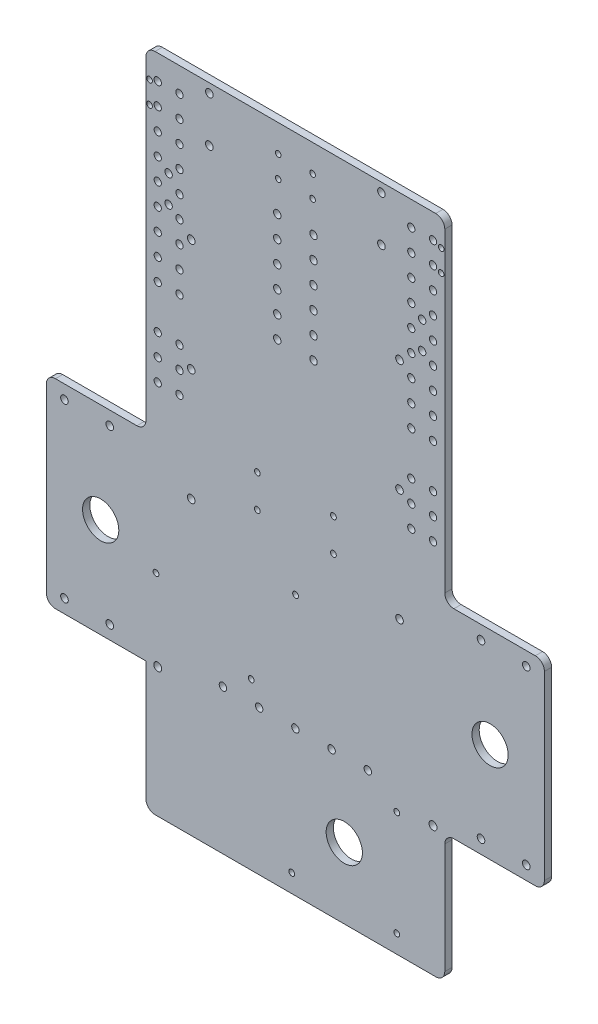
ISO-10303-21;
HEADER;
FILE_DESCRIPTION(('STEP AP214'),'2;1');
FILE_NAME('part.step','',(''),(''),'','','');
FILE_SCHEMA(('AUTOMOTIVE_DESIGN { 1 0 10303 214 1 1 1 1 }'));
ENDSEC;
DATA;
#1=APPLICATION_CONTEXT('core data for automotive mechanical design processes');
#2=APPLICATION_PROTOCOL_DEFINITION('international standard','automotive_design',2000,#1);
#3=PRODUCT_CONTEXT('',#1,'mechanical');
#4=PRODUCT('Part','Part','',(#3));
#5=PRODUCT_RELATED_PRODUCT_CATEGORY('part','',(#4));
#6=PRODUCT_DEFINITION_FORMATION('','',#4);
#7=PRODUCT_DEFINITION_CONTEXT('part definition',#1,'design');
#8=PRODUCT_DEFINITION('design','',#6,#7);
#9=PRODUCT_DEFINITION_SHAPE('','',#8);
#10=(LENGTH_UNIT() NAMED_UNIT(*) SI_UNIT(.MILLI.,.METRE.));
#11=(NAMED_UNIT(*) PLANE_ANGLE_UNIT() SI_UNIT($,.RADIAN.));
#12=(NAMED_UNIT(*) SI_UNIT($,.STERADIAN.) SOLID_ANGLE_UNIT());
#13=UNCERTAINTY_MEASURE_WITH_UNIT(LENGTH_MEASURE(1.E-05),#10,'distance_accuracy_value','');
#14=(GEOMETRIC_REPRESENTATION_CONTEXT(3) GLOBAL_UNCERTAINTY_ASSIGNED_CONTEXT((#13)) GLOBAL_UNIT_ASSIGNED_CONTEXT((#10,
#11,#12)) REPRESENTATION_CONTEXT('',''));
#15=CARTESIAN_POINT('',(0.,0.,0.));
#16=DIRECTION('',(0.,0.,1.));
#17=DIRECTION('',(1.,0.,0.));
#18=AXIS2_PLACEMENT_3D('',#15,#16,#17);
#19=CARTESIAN_POINT('',(-68.4061488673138,-171.504854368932,10.));
#20=DIRECTION('',(1.,0.,0.));
#21=DIRECTION('',(0.,0.,-1.));
#22=AXIS2_PLACEMENT_3D('',#19,#20,#21);
#23=PLANE('',#22);
#24=DIRECTION('',(0.,-1.,0.));
#25=VECTOR('',#24,1.);
#26=CARTESIAN_POINT('',(-68.4061488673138,-171.504854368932,0.));
#27=LINE('',#26,#25);
#28=CARTESIAN_POINT('',(-68.4061488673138,-135.504854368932,0.));
#29=VERTEX_POINT('',#28);
#30=CARTESIAN_POINT('',(-68.4061488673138,-201.504854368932,0.));
#31=VERTEX_POINT('',#30);
#32=EDGE_CURVE('E971',#29,#31,#27,.T.);
#33=ORIENTED_EDGE('',*,*,#32,.T.);
#34=DIRECTION('',(0.,0.,-1.));
#35=VECTOR('',#34,1.);
#36=CARTESIAN_POINT('',(-68.4061488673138,-201.504854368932,4.));
#37=LINE('',#36,#35);
#38=CARTESIAN_POINT('',(-68.4061488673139,-201.504854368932,4.));
#39=VERTEX_POINT('',#38);
#40=EDGE_CURVE('E296',#31,#39,#37,.F.);
#41=ORIENTED_EDGE('',*,*,#40,.T.);
#42=DIRECTION('',(0.,1.,0.));
#43=VECTOR('',#42,1.);
#44=CARTESIAN_POINT('',(-68.4061488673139,0.,4.));
#45=LINE('',#44,#43);
#46=CARTESIAN_POINT('',(-68.4061488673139,-135.504854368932,4.));
#47=VERTEX_POINT('',#46);
#48=EDGE_CURVE('E979',#39,#47,#45,.T.);
#49=ORIENTED_EDGE('',*,*,#48,.T.);
#50=DIRECTION('',(0.,0.,-1.));
#51=VECTOR('',#50,1.);
#52=CARTESIAN_POINT('',(-68.4061488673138,-135.504854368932,126.983738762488));
#53=LINE('',#52,#51);
#54=EDGE_CURVE('E216',#47,#29,#53,.T.);
#55=ORIENTED_EDGE('',*,*,#54,.T.);
#56=EDGE_LOOP('',(#33,#41,#49,#55));
#57=FACE_BOUND('',#56,.T.);
#58=ADVANCED_FACE('F34',(#57),#23,.F.);
#59=CARTESIAN_POINT('',(-68.4061488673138,153.495145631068,0.));
#60=VERTEX_POINT('',#59);
#61=CARTESIAN_POINT('',(-68.4061488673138,-20.5048543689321,0.));
#62=VERTEX_POINT('',#61);
#63=EDGE_CURVE('E972',#60,#62,#27,.T.);
#64=ORIENTED_EDGE('',*,*,#63,.T.);
#65=DIRECTION('',(0.,0.,-1.));
#66=VECTOR('',#65,1.);
#67=CARTESIAN_POINT('',(-68.4061488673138,-20.5048543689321,4.));
#68=LINE('',#67,#66);
#69=CARTESIAN_POINT('',(-68.4061488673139,-20.5048543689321,4.));
#70=VERTEX_POINT('',#69);
#71=EDGE_CURVE('E271',#62,#70,#68,.F.);
#72=ORIENTED_EDGE('',*,*,#71,.T.);
#73=CARTESIAN_POINT('',(-68.4061488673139,153.495145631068,4.));
#74=VERTEX_POINT('',#73);
#75=EDGE_CURVE('E978',#70,#74,#45,.T.);
#76=ORIENTED_EDGE('',*,*,#75,.T.);
#77=DIRECTION('',(0.,0.,-1.));
#78=VECTOR('',#77,1.);
#79=CARTESIAN_POINT('',(-68.4061488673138,153.495145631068,0.));
#80=LINE('',#79,#78);
#81=EDGE_CURVE('E268',#74,#60,#80,.T.);
#82=ORIENTED_EDGE('',*,*,#81,.T.);
#83=EDGE_LOOP('',(#64,#72,#76,#82));
#84=FACE_BOUND('',#83,.T.);
#85=ADVANCED_FACE('F1045',(#84),#23,.F.);
#86=CARTESIAN_POINT('',(96.593851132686,-171.504854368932,10.));
#87=DIRECTION('',(-1.,0.,0.));
#88=DIRECTION('',(0.,0.,1.));
#89=AXIS2_PLACEMENT_3D('',#86,#87,#88);
#90=PLANE('',#89);
#91=DIRECTION('',(0.,-1.,0.));
#92=VECTOR('',#91,1.);
#93=CARTESIAN_POINT('',(96.593851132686,0.,4.));
#94=LINE('',#93,#92);
#95=CARTESIAN_POINT('',(96.593851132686,-140.504854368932,4.));
#96=VERTEX_POINT('',#95);
#97=CARTESIAN_POINT('',(96.593851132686,-201.504854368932,4.));
#98=VERTEX_POINT('',#97);
#99=EDGE_CURVE('E975',#96,#98,#94,.T.);
#100=ORIENTED_EDGE('',*,*,#99,.T.);
#101=DIRECTION('',(0.,0.,-1.));
#102=VECTOR('',#101,1.);
#103=CARTESIAN_POINT('',(96.593851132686,-201.504854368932,0.));
#104=LINE('',#103,#102);
#105=CARTESIAN_POINT('',(96.5938511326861,-201.504854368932,0.));
#106=VERTEX_POINT('',#105);
#107=EDGE_CURVE('E273',#98,#106,#104,.T.);
#108=ORIENTED_EDGE('',*,*,#107,.T.);
#109=DIRECTION('',(0.,1.,0.));
#110=VECTOR('',#109,1.);
#111=CARTESIAN_POINT('',(96.5938511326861,33.4951456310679,0.));
#112=LINE('',#111,#110);
#113=CARTESIAN_POINT('',(96.5938511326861,-140.504854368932,0.));
#114=VERTEX_POINT('',#113);
#115=EDGE_CURVE('E204',#106,#114,#112,.T.);
#116=ORIENTED_EDGE('',*,*,#115,.T.);
#117=DIRECTION('',(0.,0.,-1.));
#118=VECTOR('',#117,1.);
#119=CARTESIAN_POINT('',(96.593851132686,-140.504854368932,10.));
#120=LINE('',#119,#118);
#121=EDGE_CURVE('E1003',#114,#96,#120,.F.);
#122=ORIENTED_EDGE('',*,*,#121,.T.);
#123=EDGE_LOOP('',(#100,#108,#116,#122));
#124=FACE_BOUND('',#123,.T.);
#125=ADVANCED_FACE('F1094',(#124),#90,.F.);
#126=CARTESIAN_POINT('',(0.,0.,4.));
#127=DIRECTION('',(0.,0.,1.));
#128=DIRECTION('',(1.,0.,0.));
#129=AXIS2_PLACEMENT_3D('',#126,#127,#128);
#130=PLANE('',#129);
#131=CARTESIAN_POINT('',(121.593851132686,-80.504854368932,4.));
#132=DIRECTION('',(0.,0.,1.));
#133=DIRECTION('',(1.,0.,0.));
#134=AXIS2_PLACEMENT_3D('',#131,#132,#133);
#135=CIRCLE('',#134,9.99999999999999);
#136=CARTESIAN_POINT('',(131.593851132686,-80.504854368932,4.));
#137=VERTEX_POINT('',#136);
#138=EDGE_CURVE('E2515',#137,#137,#135,.T.);
#139=ORIENTED_EDGE('',*,*,#138,.F.);
#140=EDGE_LOOP('',(#139));
#141=FACE_BOUND('',#140,.T.);
#142=CARTESIAN_POINT('',(-93.4061488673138,-80.504854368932,4.));
#143=DIRECTION('',(0.,0.,1.));
#144=DIRECTION('',(1.,0.,0.));
#145=AXIS2_PLACEMENT_3D('',#142,#143,#144);
#146=CIRCLE('',#145,9.99999999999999);
#147=CARTESIAN_POINT('',(-83.4061488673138,-80.504854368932,4.));
#148=VERTEX_POINT('',#147);
#149=EDGE_CURVE('E2520',#148,#148,#146,.T.);
#150=ORIENTED_EDGE('',*,*,#149,.F.);
#151=EDGE_LOOP('',(#150));
#152=FACE_BOUND('',#151,.T.);
#153=CARTESIAN_POINT('',(35.0938511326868,-32.5048543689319,4.));
#154=DIRECTION('',(0.,0.,1.));
#155=DIRECTION('',(1.,0.,0.));
#156=AXIS2_PLACEMENT_3D('',#153,#154,#155);
#157=CIRCLE('',#156,1.59999999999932);
#158=CARTESIAN_POINT('',(36.6938511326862,-32.5048543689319,4.));
#159=VERTEX_POINT('',#158);
#160=EDGE_CURVE('E328',#159,#159,#157,.T.);
#161=ORIENTED_EDGE('',*,*,#160,.F.);
#162=EDGE_LOOP('',(#161));
#163=FACE_BOUND('',#162,.T.);
#164=CARTESIAN_POINT('',(-6.90614886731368,-32.5048543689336,4.));
#165=DIRECTION('',(0.,0.,1.));
#166=DIRECTION('',(1.,0.,0.));
#167=AXIS2_PLACEMENT_3D('',#164,#165,#166);
#168=CIRCLE('',#167,1.60000000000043);
#169=CARTESIAN_POINT('',(-5.30614886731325,-32.5048543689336,4.));
#170=VERTEX_POINT('',#169);
#171=EDGE_CURVE('E2524',#170,#170,#168,.T.);
#172=ORIENTED_EDGE('',*,*,#171,.F.);
#173=EDGE_LOOP('',(#172));
#174=FACE_BOUND('',#173,.T.);
#175=CARTESIAN_POINT('',(-6.90614886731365,-14.5048543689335,4.));
#176=DIRECTION('',(0.,0.,1.));
#177=DIRECTION('',(1.,0.,0.));
#178=AXIS2_PLACEMENT_3D('',#175,#176,#177);
#179=CIRCLE('',#178,1.60000000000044);
#180=CARTESIAN_POINT('',(-5.30614886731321,-14.5048543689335,4.));
#181=VERTEX_POINT('',#180);
#182=EDGE_CURVE('E341',#181,#181,#179,.T.);
#183=ORIENTED_EDGE('',*,*,#182,.F.);
#184=EDGE_LOOP('',(#183));
#185=FACE_BOUND('',#184,.T.);
#186=CARTESIAN_POINT('',(35.0938511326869,-14.5048543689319,4.));
#187=DIRECTION('',(0.,0.,1.));
#188=DIRECTION('',(1.,0.,0.));
#189=AXIS2_PLACEMENT_3D('',#186,#187,#188);
#190=CIRCLE('',#189,1.59999999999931);
#191=CARTESIAN_POINT('',(36.6938511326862,-14.5048543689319,4.));
#192=VERTEX_POINT('',#191);
#193=EDGE_CURVE('E324',#192,#192,#190,.T.);
#194=ORIENTED_EDGE('',*,*,#193,.F.);
#195=EDGE_LOOP('',(#194));
#196=FACE_BOUND('',#195,.T.);
#197=CARTESIAN_POINT('',(4.09385113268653,78.4951456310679,4.));
#198=DIRECTION('',(0.,0.,1.));
#199=DIRECTION('',(1.,0.,0.));
#200=AXIS2_PLACEMENT_3D('',#197,#198,#199);
#201=CIRCLE('',#200,2.05);
#202=CARTESIAN_POINT('',(6.14385113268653,78.4951456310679,4.));
#203=VERTEX_POINT('',#202);
#204=EDGE_CURVE('E375',#203,#203,#201,.T.);
#205=ORIENTED_EDGE('',*,*,#204,.F.);
#206=EDGE_LOOP('',(#205));
#207=FACE_BOUND('',#206,.T.);
#208=CARTESIAN_POINT('',(24.0938511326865,78.4951456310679,4.));
#209=DIRECTION('',(0.,0.,1.));
#210=DIRECTION('',(1.,0.,0.));
#211=AXIS2_PLACEMENT_3D('',#208,#209,#210);
#212=CIRCLE('',#211,2.05);
#213=CARTESIAN_POINT('',(26.1438511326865,78.4951456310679,4.));
#214=VERTEX_POINT('',#213);
#215=EDGE_CURVE('E372',#214,#214,#212,.T.);
#216=ORIENTED_EDGE('',*,*,#215,.F.);
#217=EDGE_LOOP('',(#216));
#218=FACE_BOUND('',#217,.T.);
#219=CARTESIAN_POINT('',(4.09385113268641,66.4951456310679,4.));
#220=DIRECTION('',(0.,0.,1.));
#221=DIRECTION('',(1.,0.,0.));
#222=AXIS2_PLACEMENT_3D('',#219,#220,#221);
#223=CIRCLE('',#222,2.05);
#224=CARTESIAN_POINT('',(6.1438511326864,66.4951456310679,4.));
#225=VERTEX_POINT('',#224);
#226=EDGE_CURVE('E369',#225,#225,#223,.T.);
#227=ORIENTED_EDGE('',*,*,#226,.F.);
#228=EDGE_LOOP('',(#227));
#229=FACE_BOUND('',#228,.T.);
#230=CARTESIAN_POINT('',(24.0938511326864,66.4951456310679,4.));
#231=DIRECTION('',(0.,0.,1.));
#232=DIRECTION('',(1.,0.,0.));
#233=AXIS2_PLACEMENT_3D('',#230,#231,#232);
#234=CIRCLE('',#233,2.05);
#235=CARTESIAN_POINT('',(26.1438511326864,66.4951456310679,4.));
#236=VERTEX_POINT('',#235);
#237=EDGE_CURVE('E366',#236,#236,#234,.T.);
#238=ORIENTED_EDGE('',*,*,#237,.F.);
#239=EDGE_LOOP('',(#238));
#240=FACE_BOUND('',#239,.T.);
#241=CARTESIAN_POINT('',(4.09385113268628,54.4951456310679,4.));
#242=DIRECTION('',(0.,0.,1.));
#243=DIRECTION('',(1.,0.,0.));
#244=AXIS2_PLACEMENT_3D('',#241,#242,#243);
#245=CIRCLE('',#244,2.05);
#246=CARTESIAN_POINT('',(6.14385113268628,54.4951456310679,4.));
#247=VERTEX_POINT('',#246);
#248=EDGE_CURVE('E363',#247,#247,#245,.T.);
#249=ORIENTED_EDGE('',*,*,#248,.F.);
#250=EDGE_LOOP('',(#249));
#251=FACE_BOUND('',#250,.T.);
#252=CARTESIAN_POINT('',(24.0938511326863,54.4951456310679,4.));
#253=DIRECTION('',(0.,0.,1.));
#254=DIRECTION('',(1.,0.,0.));
#255=AXIS2_PLACEMENT_3D('',#252,#253,#254);
#256=CIRCLE('',#255,2.05);
#257=CARTESIAN_POINT('',(26.1438511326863,54.4951456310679,4.));
#258=VERTEX_POINT('',#257);
#259=EDGE_CURVE('E346',#258,#258,#256,.T.);
#260=ORIENTED_EDGE('',*,*,#259,.F.);
#261=EDGE_LOOP('',(#260));
#262=FACE_BOUND('',#261,.T.);
#263=CARTESIAN_POINT('',(23.5938511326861,143.495145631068,4.));
#264=DIRECTION('',(0.,0.,1.));
#265=DIRECTION('',(1.,0.,0.));
#266=AXIS2_PLACEMENT_3D('',#263,#264,#265);
#267=CIRCLE('',#266,1.54999999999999);
#268=CARTESIAN_POINT('',(25.1438511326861,143.495145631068,4.));
#269=VERTEX_POINT('',#268);
#270=EDGE_CURVE('E417',#269,#269,#267,.T.);
#271=ORIENTED_EDGE('',*,*,#270,.F.);
#272=EDGE_LOOP('',(#271));
#273=FACE_BOUND('',#272,.T.);
#274=CARTESIAN_POINT('',(23.5938511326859,131.495145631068,4.));
#275=DIRECTION('',(0.,0.,1.));
#276=DIRECTION('',(1.,0.,0.));
#277=AXIS2_PLACEMENT_3D('',#274,#275,#276);
#278=CIRCLE('',#277,1.54999999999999);
#279=CARTESIAN_POINT('',(25.1438511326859,131.495145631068,4.));
#280=VERTEX_POINT('',#279);
#281=EDGE_CURVE('E414',#280,#280,#278,.T.);
#282=ORIENTED_EDGE('',*,*,#281,.F.);
#283=EDGE_LOOP('',(#282));
#284=FACE_BOUND('',#283,.T.);
#285=CARTESIAN_POINT('',(94.5938511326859,131.495145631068,4.));
#286=DIRECTION('',(0.,0.,1.));
#287=DIRECTION('',(1.,0.,0.));
#288=AXIS2_PLACEMENT_3D('',#285,#286,#287);
#289=CIRCLE('',#288,1.54999999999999);
#290=CARTESIAN_POINT('',(96.1438511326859,131.495145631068,4.));
#291=VERTEX_POINT('',#290);
#292=EDGE_CURVE('E411',#291,#291,#289,.T.);
#293=ORIENTED_EDGE('',*,*,#292,.F.);
#294=EDGE_LOOP('',(#293));
#295=FACE_BOUND('',#294,.T.);
#296=CARTESIAN_POINT('',(-66.4061488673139,143.495145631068,4.));
#297=DIRECTION('',(0.,0.,1.));
#298=DIRECTION('',(1.,0.,0.));
#299=AXIS2_PLACEMENT_3D('',#296,#297,#298);
#300=CIRCLE('',#299,1.54999999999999);
#301=CARTESIAN_POINT('',(-64.8561488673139,143.495145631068,4.));
#302=VERTEX_POINT('',#301);
#303=EDGE_CURVE('E408',#302,#302,#300,.T.);
#304=ORIENTED_EDGE('',*,*,#303,.F.);
#305=EDGE_LOOP('',(#304));
#306=FACE_BOUND('',#305,.T.);
#307=CARTESIAN_POINT('',(-66.4061488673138,131.495145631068,4.));
#308=DIRECTION('',(0.,0.,1.));
#309=DIRECTION('',(1.,0.,0.));
#310=AXIS2_PLACEMENT_3D('',#307,#308,#309);
#311=CIRCLE('',#310,1.54999999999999);
#312=CARTESIAN_POINT('',(-64.8561488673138,131.495145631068,4.));
#313=VERTEX_POINT('',#312);
#314=EDGE_CURVE('E405',#313,#313,#311,.T.);
#315=ORIENTED_EDGE('',*,*,#314,.F.);
#316=EDGE_LOOP('',(#315));
#317=FACE_BOUND('',#316,.T.);
#318=CARTESIAN_POINT('',(4.59385113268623,131.495145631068,4.));
#319=DIRECTION('',(0.,0.,1.));
#320=DIRECTION('',(1.,0.,0.));
#321=AXIS2_PLACEMENT_3D('',#318,#319,#320);
#322=CIRCLE('',#321,1.54999999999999);
#323=CARTESIAN_POINT('',(6.14385113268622,131.495145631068,4.));
#324=VERTEX_POINT('',#323);
#325=EDGE_CURVE('E402',#324,#324,#322,.T.);
#326=ORIENTED_EDGE('',*,*,#325,.F.);
#327=EDGE_LOOP('',(#326));
#328=FACE_BOUND('',#327,.T.);
#329=CARTESIAN_POINT('',(4.5938511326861,143.495145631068,4.));
#330=DIRECTION('',(0.,0.,1.));
#331=DIRECTION('',(1.,0.,0.));
#332=AXIS2_PLACEMENT_3D('',#329,#330,#331);
#333=CIRCLE('',#332,1.54999999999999);
#334=CARTESIAN_POINT('',(6.1438511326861,143.495145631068,4.));
#335=VERTEX_POINT('',#334);
#336=EDGE_CURVE('E382',#335,#335,#333,.T.);
#337=ORIENTED_EDGE('',*,*,#336,.F.);
#338=EDGE_LOOP('',(#337));
#339=FACE_BOUND('',#338,.T.);
#340=CARTESIAN_POINT('',(94.5938511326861,143.495145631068,4.));
#341=DIRECTION('',(0.,0.,1.));
#342=DIRECTION('',(1.,0.,0.));
#343=AXIS2_PLACEMENT_3D('',#340,#341,#342);
#344=CIRCLE('',#343,1.54999999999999);
#345=CARTESIAN_POINT('',(96.1438511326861,143.495145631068,4.));
#346=VERTEX_POINT('',#345);
#347=EDGE_CURVE('E423',#346,#346,#344,.T.);
#348=ORIENTED_EDGE('',*,*,#347,.F.);
#349=EDGE_LOOP('',(#348));
#350=FACE_BOUND('',#349,.T.);
#351=CARTESIAN_POINT('',(70.0938511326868,-196.504854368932,4.));
#352=DIRECTION('',(0.,0.,1.));
#353=DIRECTION('',(1.,0.,0.));
#354=AXIS2_PLACEMENT_3D('',#351,#352,#353);
#355=CIRCLE('',#354,1.60000000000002);
#356=CARTESIAN_POINT('',(71.6938511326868,-196.504854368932,4.));
#357=VERTEX_POINT('',#356);
#358=EDGE_CURVE('E314',#357,#357,#355,.T.);
#359=ORIENTED_EDGE('',*,*,#358,.F.);
#360=EDGE_LOOP('',(#359));
#361=FACE_BOUND('',#360,.T.);
#362=CARTESIAN_POINT('',(41.0938511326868,-167.504854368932,4.));
#363=DIRECTION('',(0.,0.,1.));
#364=DIRECTION('',(1.,0.,0.));
#365=AXIS2_PLACEMENT_3D('',#362,#363,#364);
#366=CIRCLE('',#365,10.);
#367=CARTESIAN_POINT('',(51.0938511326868,-167.504854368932,4.));
#368=VERTEX_POINT('',#367);
#369=EDGE_CURVE('E429',#368,#368,#366,.T.);
#370=ORIENTED_EDGE('',*,*,#369,.F.);
#371=EDGE_LOOP('',(#370));
#372=FACE_BOUND('',#371,.T.);
#373=CARTESIAN_POINT('',(70.0938511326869,-138.504854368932,4.));
#374=DIRECTION('',(0.,0.,1.));
#375=DIRECTION('',(1.,0.,0.));
#376=AXIS2_PLACEMENT_3D('',#373,#374,#375);
#377=CIRCLE('',#376,1.59999999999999);
#378=CARTESIAN_POINT('',(71.6938511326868,-138.504854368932,4.));
#379=VERTEX_POINT('',#378);
#380=EDGE_CURVE('E426',#379,#379,#377,.T.);
#381=ORIENTED_EDGE('',*,*,#380,.F.);
#382=EDGE_LOOP('',(#381));
#383=FACE_BOUND('',#382,.T.);
#384=CARTESIAN_POINT('',(12.0938511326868,-196.504854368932,4.));
#385=DIRECTION('',(0.,0.,1.));
#386=DIRECTION('',(1.,0.,0.));
#387=AXIS2_PLACEMENT_3D('',#384,#385,#386);
#388=CIRCLE('',#387,1.59999999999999);
#389=CARTESIAN_POINT('',(13.6938511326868,-196.504854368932,4.));
#390=VERTEX_POINT('',#389);
#391=EDGE_CURVE('E309',#390,#390,#388,.T.);
#392=ORIENTED_EDGE('',*,*,#391,.F.);
#393=EDGE_LOOP('',(#392));
#394=FACE_BOUND('',#393,.T.);
#395=DIRECTION('',(-1.,0.,0.));
#396=VECTOR('',#395,1.);
#397=CARTESIAN_POINT('',(96.593851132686,-206.504854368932,4.));
#398=LINE('',#397,#396);
#399=CARTESIAN_POINT('',(91.593851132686,-206.504854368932,4.));
#400=VERTEX_POINT('',#399);
#401=CARTESIAN_POINT('',(-63.4061488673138,-206.504854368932,4.));
#402=VERTEX_POINT('',#401);
#403=EDGE_CURVE('E443',#400,#402,#398,.T.);
#404=ORIENTED_EDGE('',*,*,#403,.F.);
#405=CARTESIAN_POINT('',(91.593851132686,-201.504854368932,4.));
#406=DIRECTION('',(0.,0.,1.));
#407=DIRECTION('',(1.,0.,0.));
#408=AXIS2_PLACEMENT_3D('',#405,#406,#407);
#409=CIRCLE('',#408,5.);
#410=EDGE_CURVE('E294',#400,#98,#409,.T.);
#411=ORIENTED_EDGE('',*,*,#410,.T.);
#412=ORIENTED_EDGE('',*,*,#99,.F.);
#413=CARTESIAN_POINT('',(101.593851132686,-140.504854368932,4.));
#414=DIRECTION('',(0.,0.,1.));
#415=DIRECTION('',(1.,0.,0.));
#416=AXIS2_PLACEMENT_3D('',#413,#414,#415);
#417=CIRCLE('',#416,5.);
#418=CARTESIAN_POINT('',(101.593851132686,-135.504854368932,4.));
#419=VERTEX_POINT('',#418);
#420=EDGE_CURVE('E214',#96,#419,#417,.F.);
#421=ORIENTED_EDGE('',*,*,#420,.T.);
#422=DIRECTION('',(-1.,0.,0.));
#423=VECTOR('',#422,1.);
#424=CARTESIAN_POINT('',(96.593851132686,-135.504854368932,4.));
#425=LINE('',#424,#423);
#426=CARTESIAN_POINT('',(146.593851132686,-135.504854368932,4.));
#427=VERTEX_POINT('',#426);
#428=EDGE_CURVE('E197',#427,#419,#425,.T.);
#429=ORIENTED_EDGE('',*,*,#428,.F.);
#430=CARTESIAN_POINT('',(146.593851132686,-130.504854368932,4.));
#431=DIRECTION('',(0.,0.,1.));
#432=DIRECTION('',(1.,0.,0.));
#433=AXIS2_PLACEMENT_3D('',#430,#431,#432);
#434=CIRCLE('',#433,5.);
#435=CARTESIAN_POINT('',(151.593851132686,-130.504854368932,4.));
#436=VERTEX_POINT('',#435);
#437=EDGE_CURVE('E210',#427,#436,#434,.T.);
#438=ORIENTED_EDGE('',*,*,#437,.T.);
#439=DIRECTION('',(0.,-1.,0.));
#440=VECTOR('',#439,1.);
#441=CARTESIAN_POINT('',(151.593851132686,-25.504854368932,4.));
#442=LINE('',#441,#440);
#443=CARTESIAN_POINT('',(151.593851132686,-30.504854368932,4.));
#444=VERTEX_POINT('',#443);
#445=EDGE_CURVE('E215',#444,#436,#442,.T.);
#446=ORIENTED_EDGE('',*,*,#445,.F.);
#447=CARTESIAN_POINT('',(146.593851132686,-30.504854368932,4.));
#448=DIRECTION('',(0.,0.,1.));
#449=DIRECTION('',(1.,0.,0.));
#450=AXIS2_PLACEMENT_3D('',#447,#448,#449);
#451=CIRCLE('',#450,5.);
#452=CARTESIAN_POINT('',(146.593851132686,-25.504854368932,4.));
#453=VERTEX_POINT('',#452);
#454=EDGE_CURVE('E223',#444,#453,#451,.T.);
#455=ORIENTED_EDGE('',*,*,#454,.T.);
#456=DIRECTION('',(1.,0.,0.));
#457=VECTOR('',#456,1.);
#458=CARTESIAN_POINT('',(96.593851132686,-25.5048543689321,4.));
#459=LINE('',#458,#457);
#460=CARTESIAN_POINT('',(101.593851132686,-25.5048543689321,4.));
#461=VERTEX_POINT('',#460);
#462=EDGE_CURVE('E500',#461,#453,#459,.T.);
#463=ORIENTED_EDGE('',*,*,#462,.F.);
#464=CARTESIAN_POINT('',(101.593851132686,-20.5048543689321,4.));
#465=DIRECTION('',(0.,0.,1.));
#466=DIRECTION('',(1.,0.,0.));
#467=AXIS2_PLACEMENT_3D('',#464,#465,#466);
#468=CIRCLE('',#467,5.);
#469=CARTESIAN_POINT('',(96.593851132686,-20.5048543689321,4.));
#470=VERTEX_POINT('',#469);
#471=EDGE_CURVE('E242',#461,#470,#468,.F.);
#472=ORIENTED_EDGE('',*,*,#471,.T.);
#473=CARTESIAN_POINT('',(96.593851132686,153.495145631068,4.));
#474=VERTEX_POINT('',#473);
#475=EDGE_CURVE('E976',#474,#470,#94,.T.);
#476=ORIENTED_EDGE('',*,*,#475,.F.);
#477=CARTESIAN_POINT('',(91.593851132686,153.495145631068,4.));
#478=DIRECTION('',(0.,0.,1.));
#479=DIRECTION('',(1.,0.,0.));
#480=AXIS2_PLACEMENT_3D('',#477,#478,#479);
#481=CIRCLE('',#480,5.);
#482=CARTESIAN_POINT('',(91.593851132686,158.495145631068,4.));
#483=VERTEX_POINT('',#482);
#484=EDGE_CURVE('E51',#474,#483,#481,.T.);
#485=ORIENTED_EDGE('',*,*,#484,.T.);
#486=DIRECTION('',(1.,0.,0.));
#487=VECTOR('',#486,1.);
#488=CARTESIAN_POINT('',(96.5938511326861,158.495145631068,4.));
#489=LINE('',#488,#487);
#490=CARTESIAN_POINT('',(-63.4061488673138,158.495145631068,4.));
#491=VERTEX_POINT('',#490);
#492=EDGE_CURVE('E438',#491,#483,#489,.T.);
#493=ORIENTED_EDGE('',*,*,#492,.F.);
#494=CARTESIAN_POINT('',(-63.4061488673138,153.495145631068,4.));
#495=DIRECTION('',(0.,0.,1.));
#496=DIRECTION('',(1.,0.,0.));
#497=AXIS2_PLACEMENT_3D('',#494,#495,#496);
#498=CIRCLE('',#497,5.);
#499=EDGE_CURVE('E290',#491,#74,#498,.T.);
#500=ORIENTED_EDGE('',*,*,#499,.T.);
#501=ORIENTED_EDGE('',*,*,#75,.F.);
#502=CARTESIAN_POINT('',(-73.4061488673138,-20.5048543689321,4.));
#503=DIRECTION('',(0.,0.,1.));
#504=DIRECTION('',(1.,0.,0.));
#505=AXIS2_PLACEMENT_3D('',#502,#503,#504);
#506=CIRCLE('',#505,5.);
#507=CARTESIAN_POINT('',(-73.4061488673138,-25.5048543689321,4.));
#508=VERTEX_POINT('',#507);
#509=EDGE_CURVE('E11',#70,#508,#506,.F.);
#510=ORIENTED_EDGE('',*,*,#509,.T.);
#511=DIRECTION('',(-1.,0.,0.));
#512=VECTOR('',#511,1.);
#513=CARTESIAN_POINT('',(-68.4061488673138,-25.5048543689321,4.));
#514=LINE('',#513,#512);
#515=CARTESIAN_POINT('',(-118.406148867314,-25.504854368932,4.));
#516=VERTEX_POINT('',#515);
#517=EDGE_CURVE('E462',#508,#516,#514,.T.);
#518=ORIENTED_EDGE('',*,*,#517,.T.);
#519=CARTESIAN_POINT('',(-118.406148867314,-30.504854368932,4.));
#520=DIRECTION('',(0.,0.,1.));
#521=DIRECTION('',(1.,0.,0.));
#522=AXIS2_PLACEMENT_3D('',#519,#520,#521);
#523=CIRCLE('',#522,5.);
#524=CARTESIAN_POINT('',(-123.406148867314,-30.504854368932,4.));
#525=VERTEX_POINT('',#524);
#526=EDGE_CURVE('E258',#516,#525,#523,.T.);
#527=ORIENTED_EDGE('',*,*,#526,.T.);
#528=DIRECTION('',(0.,-1.,0.));
#529=VECTOR('',#528,1.);
#530=CARTESIAN_POINT('',(-123.406148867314,-25.504854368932,4.));
#531=LINE('',#530,#529);
#532=CARTESIAN_POINT('',(-123.406148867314,-130.504854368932,4.));
#533=VERTEX_POINT('',#532);
#534=EDGE_CURVE('E459',#525,#533,#531,.T.);
#535=ORIENTED_EDGE('',*,*,#534,.T.);
#536=CARTESIAN_POINT('',(-118.406148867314,-130.504854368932,4.));
#537=DIRECTION('',(0.,0.,1.));
#538=DIRECTION('',(1.,0.,0.));
#539=AXIS2_PLACEMENT_3D('',#536,#537,#538);
#540=CIRCLE('',#539,5.);
#541=CARTESIAN_POINT('',(-118.406148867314,-135.504854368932,4.));
#542=VERTEX_POINT('',#541);
#543=EDGE_CURVE('E260',#533,#542,#540,.T.);
#544=ORIENTED_EDGE('',*,*,#543,.T.);
#545=DIRECTION('',(1.,0.,0.));
#546=VECTOR('',#545,1.);
#547=CARTESIAN_POINT('',(-68.4061488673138,-135.504854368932,4.));
#548=LINE('',#547,#546);
#549=EDGE_CURVE('E456',#542,#47,#548,.T.);
#550=ORIENTED_EDGE('',*,*,#549,.T.);
#551=ORIENTED_EDGE('',*,*,#48,.F.);
#552=CARTESIAN_POINT('',(-63.4061488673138,-201.504854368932,4.));
#553=DIRECTION('',(0.,0.,1.));
#554=DIRECTION('',(1.,0.,0.));
#555=AXIS2_PLACEMENT_3D('',#552,#553,#554);
#556=CIRCLE('',#555,5.);
#557=EDGE_CURVE('E292',#39,#402,#556,.T.);
#558=ORIENTED_EDGE('',*,*,#557,.T.);
#559=EDGE_LOOP('',(#404,#411,#412,#421,#429,#438,#446,#455,#463,#472,#476,#485,#493,#500,#501,
#510,#518,#527,#535,#544,#550,#551,#558));
#560=FACE_BOUND('',#559,.T.);
#561=CARTESIAN_POINT('',(61.5938511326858,128.495145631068,4.));
#562=DIRECTION('',(0.,0.,-1.));
#563=DIRECTION('',(-1.,0.,0.));
#564=AXIS2_PLACEMENT_3D('',#561,#562,#563);
#565=CIRCLE('',#564,2.09999999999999);
#566=CARTESIAN_POINT('',(59.4938511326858,128.495145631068,4.));
#567=VERTEX_POINT('',#566);
#568=EDGE_CURVE('E536',#567,#567,#565,.T.);
#569=ORIENTED_EDGE('',*,*,#568,.T.);
#570=EDGE_LOOP('',(#569));
#571=FACE_BOUND('',#570,.T.);
#572=CARTESIAN_POINT('',(-33.4061488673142,128.495145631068,4.));
#573=DIRECTION('',(0.,0.,-1.));
#574=DIRECTION('',(-1.,0.,0.));
#575=AXIS2_PLACEMENT_3D('',#572,#573,#574);
#576=CIRCLE('',#575,2.09999999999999);
#577=CARTESIAN_POINT('',(-35.5061488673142,128.495145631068,4.));
#578=VERTEX_POINT('',#577);
#579=EDGE_CURVE('E530',#578,#578,#576,.T.);
#580=ORIENTED_EDGE('',*,*,#579,.T.);
#581=EDGE_LOOP('',(#580));
#582=FACE_BOUND('',#581,.T.);
#583=CARTESIAN_POINT('',(-33.4061488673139,153.495145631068,4.));
#584=DIRECTION('',(0.,0.,-1.));
#585=DIRECTION('',(-1.,0.,0.));
#586=AXIS2_PLACEMENT_3D('',#583,#584,#585);
#587=CIRCLE('',#586,2.09999999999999);
#588=CARTESIAN_POINT('',(-35.5061488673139,153.495145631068,4.));
#589=VERTEX_POINT('',#588);
#590=EDGE_CURVE('E523',#589,#589,#587,.T.);
#591=ORIENTED_EDGE('',*,*,#590,.T.);
#592=EDGE_LOOP('',(#591));
#593=FACE_BOUND('',#592,.T.);
#594=CARTESIAN_POINT('',(61.5938511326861,153.495145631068,4.));
#595=DIRECTION('',(0.,0.,-1.));
#596=DIRECTION('',(-1.,0.,0.));
#597=AXIS2_PLACEMENT_3D('',#594,#595,#596);
#598=CIRCLE('',#597,2.09999999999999);
#599=CARTESIAN_POINT('',(59.4938511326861,153.495145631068,4.));
#600=VERTEX_POINT('',#599);
#601=EDGE_CURVE('E541',#600,#600,#598,.T.);
#602=ORIENTED_EDGE('',*,*,#601,.T.);
#603=EDGE_LOOP('',(#602));
#604=FACE_BOUND('',#603,.T.);
#605=CARTESIAN_POINT('',(-61.9061488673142,108.995145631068,4.));
#606=DIRECTION('',(0.,0.,1.));
#607=DIRECTION('',(1.,0.,0.));
#608=AXIS2_PLACEMENT_3D('',#605,#606,#607);
#609=CIRCLE('',#608,2.);
#610=CARTESIAN_POINT('',(-59.9061488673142,108.995145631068,4.));
#611=VERTEX_POINT('',#610);
#612=EDGE_CURVE('E663',#611,#611,#609,.T.);
#613=ORIENTED_EDGE('',*,*,#612,.F.);
#614=EDGE_LOOP('',(#613));
#615=FACE_BOUND('',#614,.T.);
#616=CARTESIAN_POINT('',(90.0938511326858,96.9951456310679,4.));
#617=DIRECTION('',(0.,0.,1.));
#618=DIRECTION('',(1.,0.,0.));
#619=AXIS2_PLACEMENT_3D('',#616,#617,#618);
#620=CIRCLE('',#619,2.00000000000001);
#621=CARTESIAN_POINT('',(92.0938511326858,96.9951456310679,4.));
#622=VERTEX_POINT('',#621);
#623=EDGE_CURVE('E660',#622,#622,#620,.T.);
#624=ORIENTED_EDGE('',*,*,#623,.F.);
#625=EDGE_LOOP('',(#624));
#626=FACE_BOUND('',#625,.T.);
#627=CARTESIAN_POINT('',(78.0938511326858,96.9951456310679,4.));
#628=DIRECTION('',(0.,0.,1.));
#629=DIRECTION('',(1.,0.,0.));
#630=AXIS2_PLACEMENT_3D('',#627,#628,#629);
#631=CIRCLE('',#630,2.);
#632=CARTESIAN_POINT('',(80.0938511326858,96.9951456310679,4.));
#633=VERTEX_POINT('',#632);
#634=EDGE_CURVE('E657',#633,#633,#631,.T.);
#635=ORIENTED_EDGE('',*,*,#634,.F.);
#636=EDGE_LOOP('',(#635));
#637=FACE_BOUND('',#636,.T.);
#638=CARTESIAN_POINT('',(-49.9061488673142,108.995145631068,4.));
#639=DIRECTION('',(0.,0.,1.));
#640=DIRECTION('',(1.,0.,0.));
#641=AXIS2_PLACEMENT_3D('',#638,#639,#640);
#642=CIRCLE('',#641,2.);
#643=CARTESIAN_POINT('',(-47.9061488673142,108.995145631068,4.));
#644=VERTEX_POINT('',#643);
#645=EDGE_CURVE('E654',#644,#644,#642,.T.);
#646=ORIENTED_EDGE('',*,*,#645,.F.);
#647=EDGE_LOOP('',(#646));
#648=FACE_BOUND('',#647,.T.);
#649=CARTESIAN_POINT('',(78.0938511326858,108.995145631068,4.));
#650=DIRECTION('',(0.,0.,1.));
#651=DIRECTION('',(1.,0.,0.));
#652=AXIS2_PLACEMENT_3D('',#649,#650,#651);
#653=CIRCLE('',#652,2.);
#654=CARTESIAN_POINT('',(80.0938511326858,108.995145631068,4.));
#655=VERTEX_POINT('',#654);
#656=EDGE_CURVE('E651',#655,#655,#653,.T.);
#657=ORIENTED_EDGE('',*,*,#656,.F.);
#658=EDGE_LOOP('',(#657));
#659=FACE_BOUND('',#658,.T.);
#660=CARTESIAN_POINT('',(90.0938511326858,108.995145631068,4.));
#661=DIRECTION('',(0.,0.,1.));
#662=DIRECTION('',(1.,0.,0.));
#663=AXIS2_PLACEMENT_3D('',#660,#661,#662);
#664=CIRCLE('',#663,2.00000000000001);
#665=CARTESIAN_POINT('',(92.0938511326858,108.995145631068,4.));
#666=VERTEX_POINT('',#665);
#667=EDGE_CURVE('E648',#666,#666,#664,.T.);
#668=ORIENTED_EDGE('',*,*,#667,.F.);
#669=EDGE_LOOP('',(#668));
#670=FACE_BOUND('',#669,.T.);
#671=CARTESIAN_POINT('',(-61.9061488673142,96.9951456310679,4.));
#672=DIRECTION('',(0.,0.,1.));
#673=DIRECTION('',(1.,0.,0.));
#674=AXIS2_PLACEMENT_3D('',#671,#672,#673);
#675=CIRCLE('',#674,2.);
#676=CARTESIAN_POINT('',(-59.9061488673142,96.9951456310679,4.));
#677=VERTEX_POINT('',#676);
#678=EDGE_CURVE('E645',#677,#677,#675,.T.);
#679=ORIENTED_EDGE('',*,*,#678,.F.);
#680=EDGE_LOOP('',(#679));
#681=FACE_BOUND('',#680,.T.);
#682=CARTESIAN_POINT('',(-49.9061488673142,96.9951456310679,4.));
#683=DIRECTION('',(0.,0.,1.));
#684=DIRECTION('',(1.,0.,0.));
#685=AXIS2_PLACEMENT_3D('',#682,#683,#684);
#686=CIRCLE('',#685,2.);
#687=CARTESIAN_POINT('',(-47.9061488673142,96.9951456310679,4.));
#688=VERTEX_POINT('',#687);
#689=EDGE_CURVE('E642',#688,#688,#686,.T.);
#690=ORIENTED_EDGE('',*,*,#689,.F.);
#691=EDGE_LOOP('',(#690));
#692=FACE_BOUND('',#691,.T.);
#693=CARTESIAN_POINT('',(-61.906148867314,144.995145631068,4.));
#694=DIRECTION('',(0.,0.,1.));
#695=DIRECTION('',(1.,0.,0.));
#696=AXIS2_PLACEMENT_3D('',#693,#694,#695);
#697=CIRCLE('',#696,2.);
#698=CARTESIAN_POINT('',(-59.906148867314,144.995145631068,4.));
#699=VERTEX_POINT('',#698);
#700=EDGE_CURVE('E639',#699,#699,#697,.T.);
#701=ORIENTED_EDGE('',*,*,#700,.F.);
#702=EDGE_LOOP('',(#701));
#703=FACE_BOUND('',#702,.T.);
#704=CARTESIAN_POINT('',(90.0938511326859,132.995145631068,4.));
#705=DIRECTION('',(0.,0.,1.));
#706=DIRECTION('',(1.,0.,0.));
#707=AXIS2_PLACEMENT_3D('',#704,#705,#706);
#708=CIRCLE('',#707,2.00000000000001);
#709=CARTESIAN_POINT('',(92.0938511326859,132.995145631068,4.));
#710=VERTEX_POINT('',#709);
#711=EDGE_CURVE('E636',#710,#710,#708,.T.);
#712=ORIENTED_EDGE('',*,*,#711,.F.);
#713=EDGE_LOOP('',(#712));
#714=FACE_BOUND('',#713,.T.);
#715=CARTESIAN_POINT('',(78.0938511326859,132.995145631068,4.));
#716=DIRECTION('',(0.,0.,1.));
#717=DIRECTION('',(1.,0.,0.));
#718=AXIS2_PLACEMENT_3D('',#715,#716,#717);
#719=CIRCLE('',#718,2.);
#720=CARTESIAN_POINT('',(80.0938511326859,132.995145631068,4.));
#721=VERTEX_POINT('',#720);
#722=EDGE_CURVE('E633',#721,#721,#719,.T.);
#723=ORIENTED_EDGE('',*,*,#722,.F.);
#724=EDGE_LOOP('',(#723));
#725=FACE_BOUND('',#724,.T.);
#726=CARTESIAN_POINT('',(-49.906148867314,144.995145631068,4.));
#727=DIRECTION('',(0.,0.,1.));
#728=DIRECTION('',(1.,0.,0.));
#729=AXIS2_PLACEMENT_3D('',#726,#727,#728);
#730=CIRCLE('',#729,2.);
#731=CARTESIAN_POINT('',(-47.906148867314,144.995145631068,4.));
#732=VERTEX_POINT('',#731);
#733=EDGE_CURVE('E630',#732,#732,#730,.T.);
#734=ORIENTED_EDGE('',*,*,#733,.F.);
#735=EDGE_LOOP('',(#734));
#736=FACE_BOUND('',#735,.T.);
#737=CARTESIAN_POINT('',(78.093851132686,144.995145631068,4.));
#738=DIRECTION('',(0.,0.,1.));
#739=DIRECTION('',(1.,0.,0.));
#740=AXIS2_PLACEMENT_3D('',#737,#738,#739);
#741=CIRCLE('',#740,2.);
#742=CARTESIAN_POINT('',(80.093851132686,144.995145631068,4.));
#743=VERTEX_POINT('',#742);
#744=EDGE_CURVE('E627',#743,#743,#741,.T.);
#745=ORIENTED_EDGE('',*,*,#744,.F.);
#746=EDGE_LOOP('',(#745));
#747=FACE_BOUND('',#746,.T.);
#748=CARTESIAN_POINT('',(90.0938511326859,144.995145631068,4.));
#749=DIRECTION('',(0.,0.,1.));
#750=DIRECTION('',(1.,0.,0.));
#751=AXIS2_PLACEMENT_3D('',#748,#749,#750);
#752=CIRCLE('',#751,2.00000000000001);
#753=CARTESIAN_POINT('',(92.093851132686,144.995145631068,4.));
#754=VERTEX_POINT('',#753);
#755=EDGE_CURVE('E624',#754,#754,#752,.T.);
#756=ORIENTED_EDGE('',*,*,#755,.F.);
#757=EDGE_LOOP('',(#756));
#758=FACE_BOUND('',#757,.T.);
#759=CARTESIAN_POINT('',(-61.9061488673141,120.995145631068,4.));
#760=DIRECTION('',(0.,0.,1.));
#761=DIRECTION('',(1.,0.,0.));
#762=AXIS2_PLACEMENT_3D('',#759,#760,#761);
#763=CIRCLE('',#762,2.);
#764=CARTESIAN_POINT('',(-59.9061488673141,120.995145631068,4.));
#765=VERTEX_POINT('',#764);
#766=EDGE_CURVE('E621',#765,#765,#763,.T.);
#767=ORIENTED_EDGE('',*,*,#766,.F.);
#768=EDGE_LOOP('',(#767));
#769=FACE_BOUND('',#768,.T.);
#770=CARTESIAN_POINT('',(-49.9061488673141,120.995145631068,4.));
#771=DIRECTION('',(0.,0.,1.));
#772=DIRECTION('',(1.,0.,0.));
#773=AXIS2_PLACEMENT_3D('',#770,#771,#772);
#774=CIRCLE('',#773,2.);
#775=CARTESIAN_POINT('',(-47.9061488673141,120.995145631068,4.));
#776=VERTEX_POINT('',#775);
#777=EDGE_CURVE('E618',#776,#776,#774,.T.);
#778=ORIENTED_EDGE('',*,*,#777,.F.);
#779=EDGE_LOOP('',(#778));
#780=FACE_BOUND('',#779,.T.);
#781=CARTESIAN_POINT('',(78.0938511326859,120.995145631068,4.));
#782=DIRECTION('',(0.,0.,1.));
#783=DIRECTION('',(1.,0.,0.));
#784=AXIS2_PLACEMENT_3D('',#781,#782,#783);
#785=CIRCLE('',#784,2.);
#786=CARTESIAN_POINT('',(80.0938511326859,120.995145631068,4.));
#787=VERTEX_POINT('',#786);
#788=EDGE_CURVE('E615',#787,#787,#785,.T.);
#789=ORIENTED_EDGE('',*,*,#788,.F.);
#790=EDGE_LOOP('',(#789));
#791=FACE_BOUND('',#790,.T.);
#792=CARTESIAN_POINT('',(90.0938511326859,120.995145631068,4.));
#793=DIRECTION('',(0.,0.,1.));
#794=DIRECTION('',(1.,0.,0.));
#795=AXIS2_PLACEMENT_3D('',#792,#793,#794);
#796=CIRCLE('',#795,2.00000000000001);
#797=CARTESIAN_POINT('',(92.0938511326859,120.995145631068,4.));
#798=VERTEX_POINT('',#797);
#799=EDGE_CURVE('E612',#798,#798,#796,.T.);
#800=ORIENTED_EDGE('',*,*,#799,.F.);
#801=EDGE_LOOP('',(#800));
#802=FACE_BOUND('',#801,.T.);
#803=CARTESIAN_POINT('',(-61.9061488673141,132.995145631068,4.));
#804=DIRECTION('',(0.,0.,1.));
#805=DIRECTION('',(1.,0.,0.));
#806=AXIS2_PLACEMENT_3D('',#803,#804,#805);
#807=CIRCLE('',#806,2.);
#808=CARTESIAN_POINT('',(-59.9061488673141,132.995145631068,4.));
#809=VERTEX_POINT('',#808);
#810=EDGE_CURVE('E609',#809,#809,#807,.T.);
#811=ORIENTED_EDGE('',*,*,#810,.F.);
#812=EDGE_LOOP('',(#811));
#813=FACE_BOUND('',#812,.T.);
#814=CARTESIAN_POINT('',(-49.9061488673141,132.995145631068,4.));
#815=DIRECTION('',(0.,0.,1.));
#816=DIRECTION('',(1.,0.,0.));
#817=AXIS2_PLACEMENT_3D('',#814,#815,#816);
#818=CIRCLE('',#817,2.);
#819=CARTESIAN_POINT('',(-47.9061488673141,132.995145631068,4.));
#820=VERTEX_POINT('',#819);
#821=EDGE_CURVE('E570',#820,#820,#818,.T.);
#822=ORIENTED_EDGE('',*,*,#821,.F.);
#823=EDGE_LOOP('',(#822));
#824=FACE_BOUND('',#823,.T.);
#825=CARTESIAN_POINT('',(-55.9061488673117,103.995145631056,4.));
#826=DIRECTION('',(0.,0.,1.));
#827=DIRECTION('',(1.,0.,0.));
#828=AXIS2_PLACEMENT_3D('',#825,#826,#827);
#829=CIRCLE('',#828,2.05);
#830=CARTESIAN_POINT('',(-53.8561488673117,103.995145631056,4.));
#831=VERTEX_POINT('',#830);
#832=EDGE_CURVE('E681',#831,#831,#829,.T.);
#833=ORIENTED_EDGE('',*,*,#832,.F.);
#834=EDGE_LOOP('',(#833));
#835=FACE_BOUND('',#834,.T.);
#836=CARTESIAN_POINT('',(84.0938511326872,88.9951456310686,4.));
#837=DIRECTION('',(0.,0.,1.));
#838=DIRECTION('',(1.,0.,0.));
#839=AXIS2_PLACEMENT_3D('',#836,#837,#838);
#840=CIRCLE('',#839,2.04999999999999);
#841=CARTESIAN_POINT('',(86.1438511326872,88.9951456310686,4.));
#842=VERTEX_POINT('',#841);
#843=EDGE_CURVE('E678',#842,#842,#840,.T.);
#844=ORIENTED_EDGE('',*,*,#843,.F.);
#845=EDGE_LOOP('',(#844));
#846=FACE_BOUND('',#845,.T.);
#847=CARTESIAN_POINT('',(84.0938511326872,103.995145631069,4.));
#848=DIRECTION('',(0.,0.,1.));
#849=DIRECTION('',(1.,0.,0.));
#850=AXIS2_PLACEMENT_3D('',#847,#848,#849);
#851=CIRCLE('',#850,2.04999999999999);
#852=CARTESIAN_POINT('',(86.1438511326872,103.995145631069,4.));
#853=VERTEX_POINT('',#852);
#854=EDGE_CURVE('E670',#853,#853,#851,.T.);
#855=ORIENTED_EDGE('',*,*,#854,.F.);
#856=EDGE_LOOP('',(#855));
#857=FACE_BOUND('',#856,.T.);
#858=CARTESIAN_POINT('',(-55.9061488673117,88.9951456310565,4.));
#859=DIRECTION('',(0.,0.,1.));
#860=DIRECTION('',(1.,0.,0.));
#861=AXIS2_PLACEMENT_3D('',#858,#859,#860);
#862=CIRCLE('',#861,2.05);
#863=CARTESIAN_POINT('',(-53.8561488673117,88.9951456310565,4.));
#864=VERTEX_POINT('',#863);
#865=EDGE_CURVE('E687',#864,#864,#862,.T.);
#866=ORIENTED_EDGE('',*,*,#865,.F.);
#867=EDGE_LOOP('',(#866));
#868=FACE_BOUND('',#867,.T.);
#869=CARTESIAN_POINT('',(-43.406148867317,-45.5048543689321,4.));
#870=DIRECTION('',(0.,0.,1.));
#871=DIRECTION('',(1.,0.,0.));
#872=AXIS2_PLACEMENT_3D('',#869,#870,#871);
#873=CIRCLE('',#872,2.1);
#874=CARTESIAN_POINT('',(-41.3061488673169,-45.5048543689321,4.));
#875=VERTEX_POINT('',#874);
#876=EDGE_CURVE('E717',#875,#875,#873,.T.);
#877=ORIENTED_EDGE('',*,*,#876,.F.);
#878=EDGE_LOOP('',(#877));
#879=FACE_BOUND('',#878,.T.);
#880=CARTESIAN_POINT('',(71.593851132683,-45.5048543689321,4.));
#881=DIRECTION('',(0.,0.,1.));
#882=DIRECTION('',(1.,0.,0.));
#883=AXIS2_PLACEMENT_3D('',#880,#881,#882);
#884=CIRCLE('',#883,2.1);
#885=CARTESIAN_POINT('',(73.693851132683,-45.5048543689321,4.));
#886=VERTEX_POINT('',#885);
#887=EDGE_CURVE('E714',#886,#886,#884,.T.);
#888=ORIENTED_EDGE('',*,*,#887,.F.);
#889=EDGE_LOOP('',(#888));
#890=FACE_BOUND('',#889,.T.);
#891=CARTESIAN_POINT('',(-43.4061488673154,16.4951456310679,4.));
#892=DIRECTION('',(0.,0.,1.));
#893=DIRECTION('',(1.,0.,0.));
#894=AXIS2_PLACEMENT_3D('',#891,#892,#893);
#895=CIRCLE('',#894,2.1);
#896=CARTESIAN_POINT('',(-41.3061488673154,16.4951456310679,4.));
#897=VERTEX_POINT('',#896);
#898=EDGE_CURVE('E711',#897,#897,#895,.T.);
#899=ORIENTED_EDGE('',*,*,#898,.F.);
#900=EDGE_LOOP('',(#899));
#901=FACE_BOUND('',#900,.T.);
#902=CARTESIAN_POINT('',(71.5938511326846,16.4951456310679,4.));
#903=DIRECTION('',(0.,0.,1.));
#904=DIRECTION('',(1.,0.,0.));
#905=AXIS2_PLACEMENT_3D('',#902,#903,#904);
#906=CIRCLE('',#905,2.1);
#907=CARTESIAN_POINT('',(73.6938511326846,16.4951456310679,4.));
#908=VERTEX_POINT('',#907);
#909=EDGE_CURVE('E708',#908,#908,#906,.T.);
#910=ORIENTED_EDGE('',*,*,#909,.F.);
#911=EDGE_LOOP('',(#910));
#912=FACE_BOUND('',#911,.T.);
#913=CARTESIAN_POINT('',(-43.4061488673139,78.495145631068,4.));
#914=DIRECTION('',(0.,0.,1.));
#915=DIRECTION('',(1.,0.,0.));
#916=AXIS2_PLACEMENT_3D('',#913,#914,#915);
#917=CIRCLE('',#916,2.1);
#918=CARTESIAN_POINT('',(-41.3061488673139,78.495145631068,4.));
#919=VERTEX_POINT('',#918);
#920=EDGE_CURVE('E703',#919,#919,#917,.T.);
#921=ORIENTED_EDGE('',*,*,#920,.F.);
#922=EDGE_LOOP('',(#921));
#923=FACE_BOUND('',#922,.T.);
#924=CARTESIAN_POINT('',(71.5938511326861,78.4951456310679,4.));
#925=DIRECTION('',(0.,0.,1.));
#926=DIRECTION('',(1.,0.,0.));
#927=AXIS2_PLACEMENT_3D('',#924,#925,#926);
#928=CIRCLE('',#927,2.1);
#929=CARTESIAN_POINT('',(73.6938511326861,78.4951456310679,4.));
#930=VERTEX_POINT('',#929);
#931=EDGE_CURVE('E723',#930,#930,#928,.T.);
#932=ORIENTED_EDGE('',*,*,#931,.F.);
#933=EDGE_LOOP('',(#932));
#934=FACE_BOUND('',#933,.T.);
#935=CARTESIAN_POINT('',(-10.3001597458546,-115.142167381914,4.));
#936=DIRECTION('',(0.,0.,1.));
#937=DIRECTION('',(1.,0.,0.));
#938=AXIS2_PLACEMENT_3D('',#935,#936,#937);
#939=CIRCLE('',#938,1.60000000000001);
#940=CARTESIAN_POINT('',(-8.70015974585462,-115.142167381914,4.));
#941=VERTEX_POINT('',#940);
#942=EDGE_CURVE('E735',#941,#941,#939,.T.);
#943=ORIENTED_EDGE('',*,*,#942,.F.);
#944=EDGE_LOOP('',(#943));
#945=FACE_BOUND('',#944,.T.);
#946=CARTESIAN_POINT('',(14.211699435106,-62.5763157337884,4.));
#947=DIRECTION('',(0.,0.,1.));
#948=DIRECTION('',(1.,0.,0.));
#949=AXIS2_PLACEMENT_3D('',#946,#947,#948);
#950=CIRCLE('',#949,1.60000000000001);
#951=CARTESIAN_POINT('',(15.811699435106,-62.5763157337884,4.));
#952=VERTEX_POINT('',#951);
#953=EDGE_CURVE('E730',#952,#952,#950,.T.);
#954=ORIENTED_EDGE('',*,*,#953,.F.);
#955=EDGE_LOOP('',(#954));
#956=FACE_BOUND('',#955,.T.);
#957=CARTESIAN_POINT('',(-62.8660113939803,-90.6303082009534,4.));
#958=DIRECTION('',(0.,0.,1.));
#959=DIRECTION('',(1.,0.,0.));
#960=AXIS2_PLACEMENT_3D('',#957,#958,#959);
#961=CIRCLE('',#960,1.59999999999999);
#962=CARTESIAN_POINT('',(-61.2660113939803,-90.6303082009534,4.));
#963=VERTEX_POINT('',#962);
#964=EDGE_CURVE('E741',#963,#963,#961,.T.);
#965=ORIENTED_EDGE('',*,*,#964,.F.);
#966=EDGE_LOOP('',(#965));
#967=FACE_BOUND('',#966,.T.);
#968=CARTESIAN_POINT('',(34.0938511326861,-126.504854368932,4.));
#969=DIRECTION('',(0.,0.,1.));
#970=DIRECTION('',(1.,0.,0.));
#971=AXIS2_PLACEMENT_3D('',#968,#969,#970);
#972=CIRCLE('',#971,2.04999999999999);
#973=CARTESIAN_POINT('',(36.1438511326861,-126.504854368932,4.));
#974=VERTEX_POINT('',#973);
#975=EDGE_CURVE('E765',#974,#974,#972,.T.);
#976=ORIENTED_EDGE('',*,*,#975,.F.);
#977=EDGE_LOOP('',(#976));
#978=FACE_BOUND('',#977,.T.);
#979=CARTESIAN_POINT('',(54.0938511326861,-126.504854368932,4.));
#980=DIRECTION('',(0.,0.,1.));
#981=DIRECTION('',(1.,0.,0.));
#982=AXIS2_PLACEMENT_3D('',#979,#980,#981);
#983=CIRCLE('',#982,2.04999999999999);
#984=CARTESIAN_POINT('',(56.1438511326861,-126.504854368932,4.));
#985=VERTEX_POINT('',#984);
#986=EDGE_CURVE('E762',#985,#985,#983,.T.);
#987=ORIENTED_EDGE('',*,*,#986,.F.);
#988=EDGE_LOOP('',(#987));
#989=FACE_BOUND('',#988,.T.);
#990=CARTESIAN_POINT('',(-25.9061488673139,-126.504854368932,4.));
#991=DIRECTION('',(0.,0.,1.));
#992=DIRECTION('',(1.,0.,0.));
#993=AXIS2_PLACEMENT_3D('',#990,#991,#992);
#994=CIRCLE('',#993,2.05);
#995=CARTESIAN_POINT('',(-23.8561488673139,-126.504854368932,4.));
#996=VERTEX_POINT('',#995);
#997=EDGE_CURVE('E759',#996,#996,#994,.T.);
#998=ORIENTED_EDGE('',*,*,#997,.F.);
#999=EDGE_LOOP('',(#998));
#1000=FACE_BOUND('',#999,.T.);
#1001=CARTESIAN_POINT('',(14.0938511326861,-126.504854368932,4.));
#1002=DIRECTION('',(0.,0.,1.));
#1003=DIRECTION('',(1.,0.,0.));
#1004=AXIS2_PLACEMENT_3D('',#1001,#1002,#1003);
#1005=CIRCLE('',#1004,2.05);
#1006=CARTESIAN_POINT('',(16.1438511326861,-126.504854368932,4.));
#1007=VERTEX_POINT('',#1006);
#1008=EDGE_CURVE('E748',#1007,#1007,#1005,.T.);
#1009=ORIENTED_EDGE('',*,*,#1008,.F.);
#1010=EDGE_LOOP('',(#1009));
#1011=FACE_BOUND('',#1010,.T.);
#1012=CARTESIAN_POINT('',(-5.90614886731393,-126.504854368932,4.));
#1013=DIRECTION('',(0.,0.,1.));
#1014=DIRECTION('',(1.,0.,0.));
#1015=AXIS2_PLACEMENT_3D('',#1012,#1013,#1014);
#1016=CIRCLE('',#1015,2.05);
#1017=CARTESIAN_POINT('',(-3.85614886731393,-126.504854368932,4.));
#1018=VERTEX_POINT('',#1017);
#1019=EDGE_CURVE('E771',#1018,#1018,#1016,.T.);
#1020=ORIENTED_EDGE('',*,*,#1019,.F.);
#1021=EDGE_LOOP('',(#1020));
#1022=FACE_BOUND('',#1021,.T.);
#1023=CARTESIAN_POINT('',(90.093851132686,-135.004854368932,4.));
#1024=DIRECTION('',(0.,0.,1.));
#1025=DIRECTION('',(-1.,0.,0.));
#1026=AXIS2_PLACEMENT_3D('',#1023,#1024,#1025);
#1027=CIRCLE('',#1026,2.20000000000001);
#1028=CARTESIAN_POINT('',(87.893851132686,-135.004854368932,4.));
#1029=VERTEX_POINT('',#1028);
#1030=EDGE_CURVE('E774',#1029,#1029,#1027,.T.);
#1031=ORIENTED_EDGE('',*,*,#1030,.F.);
#1032=EDGE_LOOP('',(#1031));
#1033=FACE_BOUND('',#1032,.T.);
#1034=CARTESIAN_POINT('',(-61.9061488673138,-135.004854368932,4.));
#1035=DIRECTION('',(0.,0.,1.));
#1036=DIRECTION('',(1.,0.,0.));
#1037=AXIS2_PLACEMENT_3D('',#1034,#1035,#1036);
#1038=CIRCLE('',#1037,2.2);
#1039=CARTESIAN_POINT('',(-59.7061488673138,-135.004854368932,4.));
#1040=VERTEX_POINT('',#1039);
#1041=EDGE_CURVE('E778',#1040,#1040,#1038,.T.);
#1042=ORIENTED_EDGE('',*,*,#1041,.F.);
#1043=EDGE_LOOP('',(#1042));
#1044=FACE_BOUND('',#1043,.T.);
#1045=CARTESIAN_POINT('',(24.0938511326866,90.4951456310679,4.));
#1046=DIRECTION('',(0.,0.,1.));
#1047=DIRECTION('',(-1.,0.,0.));
#1048=AXIS2_PLACEMENT_3D('',#1045,#1046,#1047);
#1049=CIRCLE('',#1048,2.05);
#1050=CARTESIAN_POINT('',(22.0438511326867,90.4951456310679,4.));
#1051=VERTEX_POINT('',#1050);
#1052=EDGE_CURVE('E789',#1051,#1051,#1049,.T.);
#1053=ORIENTED_EDGE('',*,*,#1052,.F.);
#1054=EDGE_LOOP('',(#1053));
#1055=FACE_BOUND('',#1054,.T.);
#1056=CARTESIAN_POINT('',(4.09385113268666,90.4951456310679,4.));
#1057=DIRECTION('',(0.,0.,1.));
#1058=DIRECTION('',(1.,0.,0.));
#1059=AXIS2_PLACEMENT_3D('',#1056,#1057,#1058);
#1060=CIRCLE('',#1059,2.05);
#1061=CARTESIAN_POINT('',(6.14385113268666,90.4951456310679,4.));
#1062=VERTEX_POINT('',#1061);
#1063=EDGE_CURVE('E786',#1062,#1062,#1060,.T.);
#1064=ORIENTED_EDGE('',*,*,#1063,.F.);
#1065=EDGE_LOOP('',(#1064));
#1066=FACE_BOUND('',#1065,.T.);
#1067=CARTESIAN_POINT('',(24.0938511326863,102.495145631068,4.));
#1068=DIRECTION('',(0.,0.,1.));
#1069=DIRECTION('',(-1.,0.,0.));
#1070=AXIS2_PLACEMENT_3D('',#1067,#1068,#1069);
#1071=CIRCLE('',#1070,2.05);
#1072=CARTESIAN_POINT('',(22.0438511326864,102.495145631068,4.));
#1073=VERTEX_POINT('',#1072);
#1074=EDGE_CURVE('E782',#1073,#1073,#1071,.T.);
#1075=ORIENTED_EDGE('',*,*,#1074,.F.);
#1076=EDGE_LOOP('',(#1075));
#1077=FACE_BOUND('',#1076,.T.);
#1078=CARTESIAN_POINT('',(4.09385113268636,102.495145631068,4.));
#1079=DIRECTION('',(0.,0.,1.));
#1080=DIRECTION('',(1.,0.,0.));
#1081=AXIS2_PLACEMENT_3D('',#1078,#1079,#1080);
#1082=CIRCLE('',#1081,2.05);
#1083=CARTESIAN_POINT('',(6.14385113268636,102.495145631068,4.));
#1084=VERTEX_POINT('',#1083);
#1085=EDGE_CURVE('E785',#1084,#1084,#1082,.T.);
#1086=ORIENTED_EDGE('',*,*,#1085,.F.);
#1087=EDGE_LOOP('',(#1086));
#1088=FACE_BOUND('',#1087,.T.);
#1089=CARTESIAN_POINT('',(24.0938511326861,114.495145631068,4.));
#1090=DIRECTION('',(0.,0.,1.));
#1091=DIRECTION('',(-1.,0.,0.));
#1092=AXIS2_PLACEMENT_3D('',#1089,#1090,#1091);
#1093=CIRCLE('',#1092,2.05);
#1094=CARTESIAN_POINT('',(22.0438511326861,114.495145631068,4.));
#1095=VERTEX_POINT('',#1094);
#1096=EDGE_CURVE('E792',#1095,#1095,#1093,.T.);
#1097=ORIENTED_EDGE('',*,*,#1096,.F.);
#1098=EDGE_LOOP('',(#1097));
#1099=FACE_BOUND('',#1098,.T.);
#1100=CARTESIAN_POINT('',(4.09385113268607,114.495145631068,4.));
#1101=DIRECTION('',(0.,0.,1.));
#1102=DIRECTION('',(1.,0.,0.));
#1103=AXIS2_PLACEMENT_3D('',#1100,#1101,#1102);
#1104=CIRCLE('',#1103,2.05);
#1105=CARTESIAN_POINT('',(6.14385113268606,114.495145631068,4.));
#1106=VERTEX_POINT('',#1105);
#1107=EDGE_CURVE('E798',#1106,#1106,#1104,.T.);
#1108=ORIENTED_EDGE('',*,*,#1107,.F.);
#1109=EDGE_LOOP('',(#1108));
#1110=FACE_BOUND('',#1109,.T.);
#1111=CARTESIAN_POINT('',(-49.9061488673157,24.995145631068,4.));
#1112=DIRECTION('',(0.,0.,1.));
#1113=DIRECTION('',(1.,0.,0.));
#1114=AXIS2_PLACEMENT_3D('',#1111,#1112,#1113);
#1115=CIRCLE('',#1114,2.);
#1116=CARTESIAN_POINT('',(-47.9061488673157,24.995145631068,4.));
#1117=VERTEX_POINT('',#1116);
#1118=EDGE_CURVE('E962',#1117,#1117,#1115,.T.);
#1119=ORIENTED_EDGE('',*,*,#1118,.F.);
#1120=EDGE_LOOP('',(#1119));
#1121=FACE_BOUND('',#1120,.T.);
#1122=CARTESIAN_POINT('',(78.0938511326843,24.9951456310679,4.));
#1123=DIRECTION('',(0.,0.,1.));
#1124=DIRECTION('',(1.,0.,0.));
#1125=AXIS2_PLACEMENT_3D('',#1122,#1123,#1124);
#1126=CIRCLE('',#1125,2.);
#1127=CARTESIAN_POINT('',(80.0938511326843,24.9951456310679,4.));
#1128=VERTEX_POINT('',#1127);
#1129=EDGE_CURVE('E959',#1128,#1128,#1126,.T.);
#1130=ORIENTED_EDGE('',*,*,#1129,.F.);
#1131=EDGE_LOOP('',(#1130));
#1132=FACE_BOUND('',#1131,.T.);
#1133=CARTESIAN_POINT('',(90.0938511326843,24.9951456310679,4.));
#1134=DIRECTION('',(0.,0.,1.));
#1135=DIRECTION('',(1.,0.,0.));
#1136=AXIS2_PLACEMENT_3D('',#1133,#1134,#1135);
#1137=CIRCLE('',#1136,2.00000000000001);
#1138=CARTESIAN_POINT('',(92.0938511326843,24.9951456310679,4.));
#1139=VERTEX_POINT('',#1138);
#1140=EDGE_CURVE('E956',#1139,#1139,#1137,.T.);
#1141=ORIENTED_EDGE('',*,*,#1140,.F.);
#1142=EDGE_LOOP('',(#1141));
#1143=FACE_BOUND('',#1142,.T.);
#1144=CARTESIAN_POINT('',(-61.906148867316,12.995145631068,4.));
#1145=DIRECTION('',(0.,0.,1.));
#1146=DIRECTION('',(1.,0.,0.));
#1147=AXIS2_PLACEMENT_3D('',#1144,#1145,#1146);
#1148=CIRCLE('',#1147,2.);
#1149=CARTESIAN_POINT('',(-59.906148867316,12.995145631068,4.));
#1150=VERTEX_POINT('',#1149);
#1151=EDGE_CURVE('E953',#1150,#1150,#1148,.T.);
#1152=ORIENTED_EDGE('',*,*,#1151,.F.);
#1153=EDGE_LOOP('',(#1152));
#1154=FACE_BOUND('',#1153,.T.);
#1155=CARTESIAN_POINT('',(78.0938511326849,48.9951456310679,4.));
#1156=DIRECTION('',(0.,0.,1.));
#1157=DIRECTION('',(1.,0.,0.));
#1158=AXIS2_PLACEMENT_3D('',#1155,#1156,#1157);
#1159=CIRCLE('',#1158,2.);
#1160=CARTESIAN_POINT('',(80.0938511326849,48.9951456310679,4.));
#1161=VERTEX_POINT('',#1160);
#1162=EDGE_CURVE('E950',#1161,#1161,#1159,.T.);
#1163=ORIENTED_EDGE('',*,*,#1162,.F.);
#1164=EDGE_LOOP('',(#1163));
#1165=FACE_BOUND('',#1164,.T.);
#1166=CARTESIAN_POINT('',(90.0938511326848,48.9951456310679,4.));
#1167=DIRECTION('',(0.,0.,1.));
#1168=DIRECTION('',(1.,0.,0.));
#1169=AXIS2_PLACEMENT_3D('',#1166,#1167,#1168);
#1170=CIRCLE('',#1169,2.00000000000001);
#1171=CARTESIAN_POINT('',(92.0938511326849,48.9951456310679,4.));
#1172=VERTEX_POINT('',#1171);
#1173=EDGE_CURVE('E947',#1172,#1172,#1170,.T.);
#1174=ORIENTED_EDGE('',*,*,#1173,.F.);
#1175=EDGE_LOOP('',(#1174));
#1176=FACE_BOUND('',#1175,.T.);
#1177=CARTESIAN_POINT('',(-61.9061488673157,24.995145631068,4.));
#1178=DIRECTION('',(0.,0.,1.));
#1179=DIRECTION('',(1.,0.,0.));
#1180=AXIS2_PLACEMENT_3D('',#1177,#1178,#1179);
#1181=CIRCLE('',#1180,1.99999999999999);
#1182=CARTESIAN_POINT('',(-59.9061488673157,24.995145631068,4.));
#1183=VERTEX_POINT('',#1182);
#1184=EDGE_CURVE('E944',#1183,#1183,#1181,.T.);
#1185=ORIENTED_EDGE('',*,*,#1184,.F.);
#1186=EDGE_LOOP('',(#1185));
#1187=FACE_BOUND('',#1186,.T.);
#1188=CARTESIAN_POINT('',(-49.906148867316,12.995145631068,4.));
#1189=DIRECTION('',(0.,0.,1.));
#1190=DIRECTION('',(1.,0.,0.));
#1191=AXIS2_PLACEMENT_3D('',#1188,#1189,#1190);
#1192=CIRCLE('',#1191,2.);
#1193=CARTESIAN_POINT('',(-47.906148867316,12.995145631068,4.));
#1194=VERTEX_POINT('',#1193);
#1195=EDGE_CURVE('E941',#1194,#1194,#1192,.T.);
#1196=ORIENTED_EDGE('',*,*,#1195,.F.);
#1197=EDGE_LOOP('',(#1196));
#1198=FACE_BOUND('',#1197,.T.);
#1199=CARTESIAN_POINT('',(78.093851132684,12.9951456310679,4.));
#1200=DIRECTION('',(0.,0.,1.));
#1201=DIRECTION('',(1.,0.,0.));
#1202=AXIS2_PLACEMENT_3D('',#1199,#1200,#1201);
#1203=CIRCLE('',#1202,2.);
#1204=CARTESIAN_POINT('',(80.093851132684,12.9951456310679,4.));
#1205=VERTEX_POINT('',#1204);
#1206=EDGE_CURVE('E938',#1205,#1205,#1203,.T.);
#1207=ORIENTED_EDGE('',*,*,#1206,.F.);
#1208=EDGE_LOOP('',(#1207));
#1209=FACE_BOUND('',#1208,.T.);
#1210=CARTESIAN_POINT('',(90.093851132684,12.9951456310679,4.));
#1211=DIRECTION('',(0.,0.,1.));
#1212=DIRECTION('',(1.,0.,0.));
#1213=AXIS2_PLACEMENT_3D('',#1210,#1211,#1212);
#1214=CIRCLE('',#1213,2.00000000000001);
#1215=CARTESIAN_POINT('',(92.093851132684,12.9951456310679,4.));
#1216=VERTEX_POINT('',#1215);
#1217=EDGE_CURVE('E935',#1216,#1216,#1214,.T.);
#1218=ORIENTED_EDGE('',*,*,#1217,.F.);
#1219=EDGE_LOOP('',(#1218));
#1220=FACE_BOUND('',#1219,.T.);
#1221=CARTESIAN_POINT('',(-61.9061488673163,0.995145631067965,4.));
#1222=DIRECTION('',(0.,0.,1.));
#1223=DIRECTION('',(1.,0.,0.));
#1224=AXIS2_PLACEMENT_3D('',#1221,#1222,#1223);
#1225=CIRCLE('',#1224,1.99999999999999);
#1226=CARTESIAN_POINT('',(-59.9061488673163,0.995145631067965,4.));
#1227=VERTEX_POINT('',#1226);
#1228=EDGE_CURVE('E932',#1227,#1227,#1225,.T.);
#1229=ORIENTED_EDGE('',*,*,#1228,.F.);
#1230=EDGE_LOOP('',(#1229));
#1231=FACE_BOUND('',#1230,.T.);
#1232=CARTESIAN_POINT('',(-49.9061488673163,0.995145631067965,4.));
#1233=DIRECTION('',(0.,0.,1.));
#1234=DIRECTION('',(1.,0.,0.));
#1235=AXIS2_PLACEMENT_3D('',#1232,#1233,#1234);
#1236=CIRCLE('',#1235,2.);
#1237=CARTESIAN_POINT('',(-47.9061488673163,0.995145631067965,4.));
#1238=VERTEX_POINT('',#1237);
#1239=EDGE_CURVE('E929',#1238,#1238,#1236,.T.);
#1240=ORIENTED_EDGE('',*,*,#1239,.F.);
#1241=EDGE_LOOP('',(#1240));
#1242=FACE_BOUND('',#1241,.T.);
#1243=CARTESIAN_POINT('',(78.0938511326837,0.995145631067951,4.));
#1244=DIRECTION('',(0.,0.,1.));
#1245=DIRECTION('',(1.,0.,0.));
#1246=AXIS2_PLACEMENT_3D('',#1243,#1244,#1245);
#1247=CIRCLE('',#1246,2.);
#1248=CARTESIAN_POINT('',(80.0938511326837,0.995145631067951,4.));
#1249=VERTEX_POINT('',#1248);
#1250=EDGE_CURVE('E926',#1249,#1249,#1247,.T.);
#1251=ORIENTED_EDGE('',*,*,#1250,.F.);
#1252=EDGE_LOOP('',(#1251));
#1253=FACE_BOUND('',#1252,.T.);
#1254=CARTESIAN_POINT('',(90.0938511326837,0.995145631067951,4.));
#1255=DIRECTION('',(0.,0.,1.));
#1256=DIRECTION('',(1.,0.,0.));
#1257=AXIS2_PLACEMENT_3D('',#1254,#1255,#1256);
#1258=CIRCLE('',#1257,2.00000000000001);
#1259=CARTESIAN_POINT('',(92.0938511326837,0.995145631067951,4.));
#1260=VERTEX_POINT('',#1259);
#1261=EDGE_CURVE('E923',#1260,#1260,#1258,.T.);
#1262=ORIENTED_EDGE('',*,*,#1261,.F.);
#1263=EDGE_LOOP('',(#1262));
#1264=FACE_BOUND('',#1263,.T.);
#1265=CARTESIAN_POINT('',(-49.9061488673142,84.9951456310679,4.));
#1266=DIRECTION('',(0.,0.,1.));
#1267=DIRECTION('',(1.,0.,0.));
#1268=AXIS2_PLACEMENT_3D('',#1265,#1266,#1267);
#1269=CIRCLE('',#1268,2.);
#1270=CARTESIAN_POINT('',(-47.9061488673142,84.9951456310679,4.));
#1271=VERTEX_POINT('',#1270);
#1272=EDGE_CURVE('E920',#1271,#1271,#1269,.T.);
#1273=ORIENTED_EDGE('',*,*,#1272,.F.);
#1274=EDGE_LOOP('',(#1273));
#1275=FACE_BOUND('',#1274,.T.);
#1276=CARTESIAN_POINT('',(78.0938511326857,84.9951456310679,4.));
#1277=DIRECTION('',(0.,0.,1.));
#1278=DIRECTION('',(1.,0.,0.));
#1279=AXIS2_PLACEMENT_3D('',#1276,#1277,#1278);
#1280=CIRCLE('',#1279,2.);
#1281=CARTESIAN_POINT('',(80.0938511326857,84.9951456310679,4.));
#1282=VERTEX_POINT('',#1281);
#1283=EDGE_CURVE('E917',#1282,#1282,#1280,.T.);
#1284=ORIENTED_EDGE('',*,*,#1283,.F.);
#1285=EDGE_LOOP('',(#1284));
#1286=FACE_BOUND('',#1285,.T.);
#1287=CARTESIAN_POINT('',(90.0938511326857,84.9951456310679,4.));
#1288=DIRECTION('',(0.,0.,1.));
#1289=DIRECTION('',(1.,0.,0.));
#1290=AXIS2_PLACEMENT_3D('',#1287,#1288,#1289);
#1291=CIRCLE('',#1290,2.00000000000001);
#1292=CARTESIAN_POINT('',(92.0938511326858,84.9951456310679,4.));
#1293=VERTEX_POINT('',#1292);
#1294=EDGE_CURVE('E914',#1293,#1293,#1291,.T.);
#1295=ORIENTED_EDGE('',*,*,#1294,.F.);
#1296=EDGE_LOOP('',(#1295));
#1297=FACE_BOUND('',#1296,.T.);
#1298=CARTESIAN_POINT('',(-61.9061488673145,72.9951456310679,4.));
#1299=DIRECTION('',(0.,0.,1.));
#1300=DIRECTION('',(1.,0.,0.));
#1301=AXIS2_PLACEMENT_3D('',#1298,#1299,#1300);
#1302=CIRCLE('',#1301,2.);
#1303=CARTESIAN_POINT('',(-59.9061488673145,72.9951456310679,4.));
#1304=VERTEX_POINT('',#1303);
#1305=EDGE_CURVE('E911',#1304,#1304,#1302,.T.);
#1306=ORIENTED_EDGE('',*,*,#1305,.F.);
#1307=EDGE_LOOP('',(#1306));
#1308=FACE_BOUND('',#1307,.T.);
#1309=CARTESIAN_POINT('',(-49.9061488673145,72.9951456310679,4.));
#1310=DIRECTION('',(0.,0.,1.));
#1311=DIRECTION('',(1.,0.,0.));
#1312=AXIS2_PLACEMENT_3D('',#1309,#1310,#1311);
#1313=CIRCLE('',#1312,2.);
#1314=CARTESIAN_POINT('',(-47.9061488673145,72.9951456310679,4.));
#1315=VERTEX_POINT('',#1314);
#1316=EDGE_CURVE('E908',#1315,#1315,#1313,.T.);
#1317=ORIENTED_EDGE('',*,*,#1316,.F.);
#1318=EDGE_LOOP('',(#1317));
#1319=FACE_BOUND('',#1318,.T.);
#1320=CARTESIAN_POINT('',(78.0938511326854,72.9951456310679,4.));
#1321=DIRECTION('',(0.,0.,1.));
#1322=DIRECTION('',(1.,0.,0.));
#1323=AXIS2_PLACEMENT_3D('',#1320,#1321,#1322);
#1324=CIRCLE('',#1323,2.);
#1325=CARTESIAN_POINT('',(80.0938511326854,72.9951456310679,4.));
#1326=VERTEX_POINT('',#1325);
#1327=EDGE_CURVE('E905',#1326,#1326,#1324,.T.);
#1328=ORIENTED_EDGE('',*,*,#1327,.F.);
#1329=EDGE_LOOP('',(#1328));
#1330=FACE_BOUND('',#1329,.T.);
#1331=CARTESIAN_POINT('',(-49.9061488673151,48.9951456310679,4.));
#1332=DIRECTION('',(0.,0.,1.));
#1333=DIRECTION('',(1.,0.,0.));
#1334=AXIS2_PLACEMENT_3D('',#1331,#1332,#1333);
#1335=CIRCLE('',#1334,2.);
#1336=CARTESIAN_POINT('',(-47.9061488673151,48.9951456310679,4.));
#1337=VERTEX_POINT('',#1336);
#1338=EDGE_CURVE('E902',#1337,#1337,#1335,.T.);
#1339=ORIENTED_EDGE('',*,*,#1338,.F.);
#1340=EDGE_LOOP('',(#1339));
#1341=FACE_BOUND('',#1340,.T.);
#1342=CARTESIAN_POINT('',(-61.9061488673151,48.9951456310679,4.));
#1343=DIRECTION('',(0.,0.,1.));
#1344=DIRECTION('',(1.,0.,0.));
#1345=AXIS2_PLACEMENT_3D('',#1342,#1343,#1344);
#1346=CIRCLE('',#1345,2.);
#1347=CARTESIAN_POINT('',(-59.9061488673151,48.9951456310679,4.));
#1348=VERTEX_POINT('',#1347);
#1349=EDGE_CURVE('E899',#1348,#1348,#1346,.T.);
#1350=ORIENTED_EDGE('',*,*,#1349,.F.);
#1351=EDGE_LOOP('',(#1350));
#1352=FACE_BOUND('',#1351,.T.);
#1353=CARTESIAN_POINT('',(90.0938511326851,60.9951456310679,4.));
#1354=DIRECTION('',(0.,0.,1.));
#1355=DIRECTION('',(1.,0.,0.));
#1356=AXIS2_PLACEMENT_3D('',#1353,#1354,#1355);
#1357=CIRCLE('',#1356,2.00000000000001);
#1358=CARTESIAN_POINT('',(92.0938511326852,60.9951456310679,4.));
#1359=VERTEX_POINT('',#1358);
#1360=EDGE_CURVE('E896',#1359,#1359,#1357,.T.);
#1361=ORIENTED_EDGE('',*,*,#1360,.F.);
#1362=EDGE_LOOP('',(#1361));
#1363=FACE_BOUND('',#1362,.T.);
#1364=CARTESIAN_POINT('',(78.0938511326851,60.9951456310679,4.));
#1365=DIRECTION('',(0.,0.,1.));
#1366=DIRECTION('',(1.,0.,0.));
#1367=AXIS2_PLACEMENT_3D('',#1364,#1365,#1366);
#1368=CIRCLE('',#1367,2.);
#1369=CARTESIAN_POINT('',(80.0938511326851,60.9951456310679,4.));
#1370=VERTEX_POINT('',#1369);
#1371=EDGE_CURVE('E893',#1370,#1370,#1368,.T.);
#1372=ORIENTED_EDGE('',*,*,#1371,.F.);
#1373=EDGE_LOOP('',(#1372));
#1374=FACE_BOUND('',#1373,.T.);
#1375=CARTESIAN_POINT('',(-49.9061488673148,60.9951456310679,4.));
#1376=DIRECTION('',(0.,0.,1.));
#1377=DIRECTION('',(1.,0.,0.));
#1378=AXIS2_PLACEMENT_3D('',#1375,#1376,#1377);
#1379=CIRCLE('',#1378,2.);
#1380=CARTESIAN_POINT('',(-47.9061488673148,60.9951456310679,4.));
#1381=VERTEX_POINT('',#1380);
#1382=EDGE_CURVE('E890',#1381,#1381,#1379,.T.);
#1383=ORIENTED_EDGE('',*,*,#1382,.F.);
#1384=EDGE_LOOP('',(#1383));
#1385=FACE_BOUND('',#1384,.T.);
#1386=CARTESIAN_POINT('',(-61.9061488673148,60.9951456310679,4.));
#1387=DIRECTION('',(0.,0.,1.));
#1388=DIRECTION('',(1.,0.,0.));
#1389=AXIS2_PLACEMENT_3D('',#1386,#1387,#1388);
#1390=CIRCLE('',#1389,2.);
#1391=CARTESIAN_POINT('',(-59.9061488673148,60.9951456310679,4.));
#1392=VERTEX_POINT('',#1391);
#1393=EDGE_CURVE('E887',#1392,#1392,#1390,.T.);
#1394=ORIENTED_EDGE('',*,*,#1393,.F.);
#1395=EDGE_LOOP('',(#1394));
#1396=FACE_BOUND('',#1395,.T.);
#1397=CARTESIAN_POINT('',(90.0938511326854,72.9951456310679,4.));
#1398=DIRECTION('',(0.,0.,1.));
#1399=DIRECTION('',(1.,0.,0.));
#1400=AXIS2_PLACEMENT_3D('',#1397,#1398,#1399);
#1401=CIRCLE('',#1400,2.00000000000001);
#1402=CARTESIAN_POINT('',(92.0938511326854,72.9951456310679,4.));
#1403=VERTEX_POINT('',#1402);
#1404=EDGE_CURVE('E870',#1403,#1403,#1401,.T.);
#1405=ORIENTED_EDGE('',*,*,#1404,.F.);
#1406=EDGE_LOOP('',(#1405));
#1407=FACE_BOUND('',#1406,.T.);
#1408=CARTESIAN_POINT('',(-61.9061488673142,84.9951456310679,4.));
#1409=DIRECTION('',(0.,0.,1.));
#1410=DIRECTION('',(1.,0.,0.));
#1411=AXIS2_PLACEMENT_3D('',#1408,#1409,#1410);
#1412=CIRCLE('',#1411,2.);
#1413=CARTESIAN_POINT('',(-59.9061488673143,84.9951456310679,4.));
#1414=VERTEX_POINT('',#1413);
#1415=EDGE_CURVE('E968',#1414,#1414,#1412,.T.);
#1416=ORIENTED_EDGE('',*,*,#1415,.F.);
#1417=EDGE_LOOP('',(#1416));
#1418=FACE_BOUND('',#1417,.T.);
#1419=CARTESIAN_POINT('',(116.593851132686,-33.004854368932,4.));
#1420=DIRECTION('',(0.,0.,1.));
#1421=DIRECTION('',(1.,0.,0.));
#1422=AXIS2_PLACEMENT_3D('',#1419,#1420,#1421);
#1423=CIRCLE('',#1422,2.09999999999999);
#1424=CARTESIAN_POINT('',(118.693851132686,-33.004854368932,4.));
#1425=VERTEX_POINT('',#1424);
#1426=EDGE_CURVE('E488',#1425,#1425,#1423,.F.);
#1427=ORIENTED_EDGE('',*,*,#1426,.T.);
#1428=EDGE_LOOP('',(#1427));
#1429=FACE_BOUND('',#1428,.T.);
#1430=CARTESIAN_POINT('',(141.593851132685,-128.004854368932,4.));
#1431=DIRECTION('',(0.,0.,1.));
#1432=DIRECTION('',(1.,0.,0.));
#1433=AXIS2_PLACEMENT_3D('',#1430,#1431,#1432);
#1434=CIRCLE('',#1433,2.09999999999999);
#1435=CARTESIAN_POINT('',(143.693851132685,-128.004854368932,4.));
#1436=VERTEX_POINT('',#1435);
#1437=EDGE_CURVE('E515',#1436,#1436,#1434,.F.);
#1438=ORIENTED_EDGE('',*,*,#1437,.T.);
#1439=EDGE_LOOP('',(#1438));
#1440=FACE_BOUND('',#1439,.T.);
#1441=CARTESIAN_POINT('',(116.593851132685,-128.004854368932,4.));
#1442=DIRECTION('',(0.,0.,1.));
#1443=DIRECTION('',(1.,0.,0.));
#1444=AXIS2_PLACEMENT_3D('',#1441,#1442,#1443);
#1445=CIRCLE('',#1444,2.09999999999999);
#1446=CARTESIAN_POINT('',(118.693851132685,-128.004854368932,4.));
#1447=VERTEX_POINT('',#1446);
#1448=EDGE_CURVE('E512',#1447,#1447,#1445,.F.);
#1449=ORIENTED_EDGE('',*,*,#1448,.T.);
#1450=EDGE_LOOP('',(#1449));
#1451=FACE_BOUND('',#1450,.T.);
#1452=CARTESIAN_POINT('',(141.593851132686,-33.004854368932,4.));
#1453=DIRECTION('',(0.,0.,1.));
#1454=DIRECTION('',(1.,0.,0.));
#1455=AXIS2_PLACEMENT_3D('',#1452,#1453,#1454);
#1456=CIRCLE('',#1455,2.09999999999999);
#1457=CARTESIAN_POINT('',(143.693851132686,-33.004854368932,4.));
#1458=VERTEX_POINT('',#1457);
#1459=EDGE_CURVE('E508',#1458,#1458,#1456,.F.);
#1460=ORIENTED_EDGE('',*,*,#1459,.T.);
#1461=EDGE_LOOP('',(#1460));
#1462=FACE_BOUND('',#1461,.T.);
#1463=CARTESIAN_POINT('',(-113.406148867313,-128.004854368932,4.));
#1464=DIRECTION('',(0.,0.,1.));
#1465=DIRECTION('',(1.,0.,0.));
#1466=AXIS2_PLACEMENT_3D('',#1463,#1464,#1465);
#1467=CIRCLE('',#1466,2.09999999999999);
#1468=CARTESIAN_POINT('',(-111.306148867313,-128.004854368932,4.));
#1469=VERTEX_POINT('',#1468);
#1470=EDGE_CURVE('E446',#1469,#1469,#1467,.T.);
#1471=ORIENTED_EDGE('',*,*,#1470,.F.);
#1472=EDGE_LOOP('',(#1471));
#1473=FACE_BOUND('',#1472,.T.);
#1474=CARTESIAN_POINT('',(-88.4061488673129,-128.004854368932,4.));
#1475=DIRECTION('',(0.,0.,1.));
#1476=DIRECTION('',(1.,0.,0.));
#1477=AXIS2_PLACEMENT_3D('',#1474,#1475,#1476);
#1478=CIRCLE('',#1477,2.09999999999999);
#1479=CARTESIAN_POINT('',(-86.3061488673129,-128.004854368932,4.));
#1480=VERTEX_POINT('',#1479);
#1481=EDGE_CURVE('E447',#1480,#1480,#1478,.T.);
#1482=ORIENTED_EDGE('',*,*,#1481,.F.);
#1483=EDGE_LOOP('',(#1482));
#1484=FACE_BOUND('',#1483,.T.);
#1485=CARTESIAN_POINT('',(-88.4061488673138,-33.004854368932,4.));
#1486=DIRECTION('',(0.,0.,1.));
#1487=DIRECTION('',(1.,0.,0.));
#1488=AXIS2_PLACEMENT_3D('',#1485,#1486,#1487);
#1489=CIRCLE('',#1488,2.09999999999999);
#1490=CARTESIAN_POINT('',(-86.3061488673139,-33.004854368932,4.));
#1491=VERTEX_POINT('',#1490);
#1492=EDGE_CURVE('E450',#1491,#1491,#1489,.T.);
#1493=ORIENTED_EDGE('',*,*,#1492,.F.);
#1494=EDGE_LOOP('',(#1493));
#1495=FACE_BOUND('',#1494,.T.);
#1496=CARTESIAN_POINT('',(-113.406148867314,-33.004854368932,4.));
#1497=DIRECTION('',(0.,0.,1.));
#1498=DIRECTION('',(1.,0.,0.));
#1499=AXIS2_PLACEMENT_3D('',#1496,#1497,#1498);
#1500=CIRCLE('',#1499,2.09999999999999);
#1501=CARTESIAN_POINT('',(-111.306148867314,-33.004854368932,4.));
#1502=VERTEX_POINT('',#1501);
#1503=EDGE_CURVE('E453',#1502,#1502,#1500,.T.);
#1504=ORIENTED_EDGE('',*,*,#1503,.F.);
#1505=EDGE_LOOP('',(#1504));
#1506=FACE_BOUND('',#1505,.T.);
#1507=ADVANCED_FACE('F207',(#141,#152,#163,#174,#185,#196,#207,#218,#229,#240,#251,#262,#273,
#284,#295,#306,#317,#328,#339,#350,#361,#372,#383,#394,#560,#571,#582,#593,#604,#615,#626,#637,
#648,#659,#670,#681,#692,#703,#714,#725,#736,#747,#758,#769,#780,#791,#802,#813,#824,#835,#846,
#857,#868,#879,#890,#901,#912,#923,#934,#945,#956,#967,#978,#989,#1000,#1011,#1022,#1033,#1044,
#1055,#1066,#1077,#1088,#1099,#1110,#1121,#1132,#1143,#1154,#1165,#1176,#1187,#1198,#1209,#1220,
#1231,#1242,#1253,#1264,#1275,#1286,#1297,#1308,#1319,#1330,#1341,#1352,#1363,#1374,#1385,#1396,
#1407,#1418,#1429,#1440,#1451,#1462,#1473,#1484,#1495,#1506),#130,.T.);
#1508=CARTESIAN_POINT('',(0.,0.,0.));
#1509=DIRECTION('',(0.,0.,1.));
#1510=DIRECTION('',(1.,0.,0.));
#1511=AXIS2_PLACEMENT_3D('',#1508,#1509,#1510);
#1512=PLANE('',#1511);
#1513=CARTESIAN_POINT('',(121.593851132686,-80.504854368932,0.));
#1514=DIRECTION('',(0.,0.,-1.));
#1515=DIRECTION('',(-1.,0.,0.));
#1516=AXIS2_PLACEMENT_3D('',#1513,#1514,#1515);
#1517=CIRCLE('',#1516,9.99999999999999);
#1518=CARTESIAN_POINT('',(111.593851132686,-80.504854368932,0.));
#1519=VERTEX_POINT('',#1518);
#1520=EDGE_CURVE('E1130',#1519,#1519,#1517,.T.);
#1521=ORIENTED_EDGE('',*,*,#1520,.F.);
#1522=EDGE_LOOP('',(#1521));
#1523=FACE_BOUND('',#1522,.T.);
#1524=CARTESIAN_POINT('',(-93.4061488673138,-80.504854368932,0.));
#1525=DIRECTION('',(0.,0.,-1.));
#1526=DIRECTION('',(-1.,0.,0.));
#1527=AXIS2_PLACEMENT_3D('',#1524,#1525,#1526);
#1528=CIRCLE('',#1527,9.99999999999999);
#1529=CARTESIAN_POINT('',(-103.406148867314,-80.504854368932,0.));
#1530=VERTEX_POINT('',#1529);
#1531=EDGE_CURVE('E1133',#1530,#1530,#1528,.T.);
#1532=ORIENTED_EDGE('',*,*,#1531,.F.);
#1533=EDGE_LOOP('',(#1532));
#1534=FACE_BOUND('',#1533,.T.);
#1535=CARTESIAN_POINT('',(35.0938511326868,-32.5048543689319,0.));
#1536=DIRECTION('',(0.,0.,1.));
#1537=DIRECTION('',(1.,0.,0.));
#1538=AXIS2_PLACEMENT_3D('',#1535,#1536,#1537);
#1539=CIRCLE('',#1538,1.59999999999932);
#1540=CARTESIAN_POINT('',(36.6938511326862,-32.5048543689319,0.));
#1541=VERTEX_POINT('',#1540);
#1542=EDGE_CURVE('E38',#1541,#1541,#1539,.T.);
#1543=ORIENTED_EDGE('',*,*,#1542,.T.);
#1544=EDGE_LOOP('',(#1543));
#1545=FACE_BOUND('',#1544,.T.);
#1546=CARTESIAN_POINT('',(-6.90614886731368,-32.5048543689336,0.));
#1547=DIRECTION('',(0.,0.,1.));
#1548=DIRECTION('',(1.,0.,0.));
#1549=AXIS2_PLACEMENT_3D('',#1546,#1547,#1548);
#1550=CIRCLE('',#1549,1.60000000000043);
#1551=CARTESIAN_POINT('',(-5.30614886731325,-32.5048543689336,0.));
#1552=VERTEX_POINT('',#1551);
#1553=EDGE_CURVE('E327',#1552,#1552,#1550,.T.);
#1554=ORIENTED_EDGE('',*,*,#1553,.T.);
#1555=EDGE_LOOP('',(#1554));
#1556=FACE_BOUND('',#1555,.T.);
#1557=CARTESIAN_POINT('',(-6.90614886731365,-14.5048543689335,0.));
#1558=DIRECTION('',(0.,0.,1.));
#1559=DIRECTION('',(1.,0.,0.));
#1560=AXIS2_PLACEMENT_3D('',#1557,#1558,#1559);
#1561=CIRCLE('',#1560,1.60000000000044);
#1562=CARTESIAN_POINT('',(-5.30614886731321,-14.5048543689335,0.));
#1563=VERTEX_POINT('',#1562);
#1564=EDGE_CURVE('E325',#1563,#1563,#1561,.T.);
#1565=ORIENTED_EDGE('',*,*,#1564,.T.);
#1566=EDGE_LOOP('',(#1565));
#1567=FACE_BOUND('',#1566,.T.);
#1568=CARTESIAN_POINT('',(35.0938511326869,-14.5048543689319,0.));
#1569=DIRECTION('',(0.,0.,1.));
#1570=DIRECTION('',(1.,0.,0.));
#1571=AXIS2_PLACEMENT_3D('',#1568,#1569,#1570);
#1572=CIRCLE('',#1571,1.59999999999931);
#1573=CARTESIAN_POINT('',(36.6938511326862,-14.5048543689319,0.));
#1574=VERTEX_POINT('',#1573);
#1575=EDGE_CURVE('E320',#1574,#1574,#1572,.T.);
#1576=ORIENTED_EDGE('',*,*,#1575,.T.);
#1577=EDGE_LOOP('',(#1576));
#1578=FACE_BOUND('',#1577,.T.);
#1579=CARTESIAN_POINT('',(4.09385113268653,78.4951456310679,0.));
#1580=DIRECTION('',(0.,0.,-1.));
#1581=DIRECTION('',(-1.,0.,0.));
#1582=AXIS2_PLACEMENT_3D('',#1579,#1580,#1581);
#1583=CIRCLE('',#1582,2.05);
#1584=CARTESIAN_POINT('',(2.04385113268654,78.4951456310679,0.));
#1585=VERTEX_POINT('',#1584);
#1586=EDGE_CURVE('E343',#1585,#1585,#1583,.T.);
#1587=ORIENTED_EDGE('',*,*,#1586,.F.);
#1588=EDGE_LOOP('',(#1587));
#1589=FACE_BOUND('',#1588,.T.);
#1590=CARTESIAN_POINT('',(24.0938511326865,78.4951456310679,0.));
#1591=DIRECTION('',(0.,0.,-1.));
#1592=DIRECTION('',(-1.,0.,0.));
#1593=AXIS2_PLACEMENT_3D('',#1590,#1591,#1592);
#1594=CIRCLE('',#1593,2.05);
#1595=CARTESIAN_POINT('',(22.0438511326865,78.4951456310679,0.));
#1596=VERTEX_POINT('',#1595);
#1597=EDGE_CURVE('E347',#1596,#1596,#1594,.T.);
#1598=ORIENTED_EDGE('',*,*,#1597,.F.);
#1599=EDGE_LOOP('',(#1598));
#1600=FACE_BOUND('',#1599,.T.);
#1601=CARTESIAN_POINT('',(4.09385113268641,66.4951456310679,0.));
#1602=DIRECTION('',(0.,0.,-1.));
#1603=DIRECTION('',(-1.,0.,0.));
#1604=AXIS2_PLACEMENT_3D('',#1601,#1602,#1603);
#1605=CIRCLE('',#1604,2.05);
#1606=CARTESIAN_POINT('',(2.04385113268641,66.4951456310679,0.));
#1607=VERTEX_POINT('',#1606);
#1608=EDGE_CURVE('E350',#1607,#1607,#1605,.T.);
#1609=ORIENTED_EDGE('',*,*,#1608,.F.);
#1610=EDGE_LOOP('',(#1609));
#1611=FACE_BOUND('',#1610,.T.);
#1612=CARTESIAN_POINT('',(24.0938511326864,66.4951456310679,0.));
#1613=DIRECTION('',(0.,0.,-1.));
#1614=DIRECTION('',(-1.,0.,0.));
#1615=AXIS2_PLACEMENT_3D('',#1612,#1613,#1614);
#1616=CIRCLE('',#1615,2.05);
#1617=CARTESIAN_POINT('',(22.0438511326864,66.4951456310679,0.));
#1618=VERTEX_POINT('',#1617);
#1619=EDGE_CURVE('E353',#1618,#1618,#1616,.T.);
#1620=ORIENTED_EDGE('',*,*,#1619,.F.);
#1621=EDGE_LOOP('',(#1620));
#1622=FACE_BOUND('',#1621,.T.);
#1623=CARTESIAN_POINT('',(4.09385113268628,54.4951456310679,0.));
#1624=DIRECTION('',(0.,0.,-1.));
#1625=DIRECTION('',(-1.,0.,0.));
#1626=AXIS2_PLACEMENT_3D('',#1623,#1624,#1625);
#1627=CIRCLE('',#1626,2.05);
#1628=CARTESIAN_POINT('',(2.04385113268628,54.4951456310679,0.));
#1629=VERTEX_POINT('',#1628);
#1630=EDGE_CURVE('E356',#1629,#1629,#1627,.T.);
#1631=ORIENTED_EDGE('',*,*,#1630,.F.);
#1632=EDGE_LOOP('',(#1631));
#1633=FACE_BOUND('',#1632,.T.);
#1634=CARTESIAN_POINT('',(24.0938511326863,54.4951456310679,0.));
#1635=DIRECTION('',(0.,0.,-1.));
#1636=DIRECTION('',(-1.,0.,0.));
#1637=AXIS2_PLACEMENT_3D('',#1634,#1635,#1636);
#1638=CIRCLE('',#1637,2.05);
#1639=CARTESIAN_POINT('',(22.0438511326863,54.4951456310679,0.));
#1640=VERTEX_POINT('',#1639);
#1641=EDGE_CURVE('E323',#1640,#1640,#1638,.T.);
#1642=ORIENTED_EDGE('',*,*,#1641,.F.);
#1643=EDGE_LOOP('',(#1642));
#1644=FACE_BOUND('',#1643,.T.);
#1645=CARTESIAN_POINT('',(23.5938511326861,143.495145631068,0.));
#1646=DIRECTION('',(0.,0.,-1.));
#1647=DIRECTION('',(-1.,0.,0.));
#1648=AXIS2_PLACEMENT_3D('',#1645,#1646,#1647);
#1649=CIRCLE('',#1648,1.54999999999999);
#1650=CARTESIAN_POINT('',(22.0438511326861,143.495145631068,0.));
#1651=VERTEX_POINT('',#1650);
#1652=EDGE_CURVE('E379',#1651,#1651,#1649,.T.);
#1653=ORIENTED_EDGE('',*,*,#1652,.F.);
#1654=EDGE_LOOP('',(#1653));
#1655=FACE_BOUND('',#1654,.T.);
#1656=CARTESIAN_POINT('',(23.5938511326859,131.495145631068,0.));
#1657=DIRECTION('',(0.,0.,-1.));
#1658=DIRECTION('',(-1.,0.,0.));
#1659=AXIS2_PLACEMENT_3D('',#1656,#1657,#1658);
#1660=CIRCLE('',#1659,1.54999999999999);
#1661=CARTESIAN_POINT('',(22.043851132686,131.495145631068,0.));
#1662=VERTEX_POINT('',#1661);
#1663=EDGE_CURVE('E383',#1662,#1662,#1660,.T.);
#1664=ORIENTED_EDGE('',*,*,#1663,.F.);
#1665=EDGE_LOOP('',(#1664));
#1666=FACE_BOUND('',#1665,.T.);
#1667=CARTESIAN_POINT('',(94.5938511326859,131.495145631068,0.));
#1668=DIRECTION('',(0.,0.,-1.));
#1669=DIRECTION('',(-1.,0.,0.));
#1670=AXIS2_PLACEMENT_3D('',#1667,#1668,#1669);
#1671=CIRCLE('',#1670,1.54999999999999);
#1672=CARTESIAN_POINT('',(93.0438511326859,131.495145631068,0.));
#1673=VERTEX_POINT('',#1672);
#1674=EDGE_CURVE('E386',#1673,#1673,#1671,.T.);
#1675=ORIENTED_EDGE('',*,*,#1674,.F.);
#1676=EDGE_LOOP('',(#1675));
#1677=FACE_BOUND('',#1676,.T.);
#1678=CARTESIAN_POINT('',(-66.4061488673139,143.495145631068,0.));
#1679=DIRECTION('',(0.,0.,-1.));
#1680=DIRECTION('',(1.,0.,0.));
#1681=AXIS2_PLACEMENT_3D('',#1678,#1679,#1680);
#1682=CIRCLE('',#1681,1.54999999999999);
#1683=CARTESIAN_POINT('',(-64.8561488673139,143.495145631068,0.));
#1684=VERTEX_POINT('',#1683);
#1685=EDGE_CURVE('E389',#1684,#1684,#1682,.T.);
#1686=ORIENTED_EDGE('',*,*,#1685,.F.);
#1687=EDGE_LOOP('',(#1686));
#1688=FACE_BOUND('',#1687,.T.);
#1689=CARTESIAN_POINT('',(-66.4061488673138,131.495145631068,0.));
#1690=DIRECTION('',(0.,0.,-1.));
#1691=DIRECTION('',(1.,0.,0.));
#1692=AXIS2_PLACEMENT_3D('',#1689,#1690,#1691);
#1693=CIRCLE('',#1692,1.54999999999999);
#1694=CARTESIAN_POINT('',(-64.8561488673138,131.495145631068,0.));
#1695=VERTEX_POINT('',#1694);
#1696=EDGE_CURVE('E392',#1695,#1695,#1693,.T.);
#1697=ORIENTED_EDGE('',*,*,#1696,.F.);
#1698=EDGE_LOOP('',(#1697));
#1699=FACE_BOUND('',#1698,.T.);
#1700=CARTESIAN_POINT('',(4.59385113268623,131.495145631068,0.));
#1701=DIRECTION('',(0.,0.,-1.));
#1702=DIRECTION('',(1.,0.,0.));
#1703=AXIS2_PLACEMENT_3D('',#1700,#1701,#1702);
#1704=CIRCLE('',#1703,1.54999999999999);
#1705=CARTESIAN_POINT('',(6.14385113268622,131.495145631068,0.));
#1706=VERTEX_POINT('',#1705);
#1707=EDGE_CURVE('E395',#1706,#1706,#1704,.T.);
#1708=ORIENTED_EDGE('',*,*,#1707,.F.);
#1709=EDGE_LOOP('',(#1708));
#1710=FACE_BOUND('',#1709,.T.);
#1711=CARTESIAN_POINT('',(4.5938511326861,143.495145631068,0.));
#1712=DIRECTION('',(0.,0.,-1.));
#1713=DIRECTION('',(1.,0.,0.));
#1714=AXIS2_PLACEMENT_3D('',#1711,#1712,#1713);
#1715=CIRCLE('',#1714,1.54999999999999);
#1716=CARTESIAN_POINT('',(6.1438511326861,143.495145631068,0.));
#1717=VERTEX_POINT('',#1716);
#1718=EDGE_CURVE('E378',#1717,#1717,#1715,.T.);
#1719=ORIENTED_EDGE('',*,*,#1718,.F.);
#1720=EDGE_LOOP('',(#1719));
#1721=FACE_BOUND('',#1720,.T.);
#1722=CARTESIAN_POINT('',(94.5938511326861,143.495145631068,0.));
#1723=DIRECTION('',(0.,0.,-1.));
#1724=DIRECTION('',(-1.,0.,0.));
#1725=AXIS2_PLACEMENT_3D('',#1722,#1723,#1724);
#1726=CIRCLE('',#1725,1.54999999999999);
#1727=CARTESIAN_POINT('',(93.0438511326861,143.495145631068,0.));
#1728=VERTEX_POINT('',#1727);
#1729=EDGE_CURVE('E420',#1728,#1728,#1726,.T.);
#1730=ORIENTED_EDGE('',*,*,#1729,.F.);
#1731=EDGE_LOOP('',(#1730));
#1732=FACE_BOUND('',#1731,.T.);
#1733=CARTESIAN_POINT('',(70.0938511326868,-196.504854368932,0.));
#1734=DIRECTION('',(0.,0.,1.));
#1735=DIRECTION('',(1.,0.,0.));
#1736=AXIS2_PLACEMENT_3D('',#1733,#1734,#1735);
#1737=CIRCLE('',#1736,1.60000000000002);
#1738=CARTESIAN_POINT('',(71.6938511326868,-196.504854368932,0.));
#1739=VERTEX_POINT('',#1738);
#1740=EDGE_CURVE('E317',#1739,#1739,#1737,.T.);
#1741=ORIENTED_EDGE('',*,*,#1740,.T.);
#1742=EDGE_LOOP('',(#1741));
#1743=FACE_BOUND('',#1742,.T.);
#1744=CARTESIAN_POINT('',(41.0938511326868,-167.504854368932,0.));
#1745=DIRECTION('',(0.,0.,1.));
#1746=DIRECTION('',(1.,0.,0.));
#1747=AXIS2_PLACEMENT_3D('',#1744,#1745,#1746);
#1748=CIRCLE('',#1747,10.);
#1749=CARTESIAN_POINT('',(51.0938511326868,-167.504854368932,0.));
#1750=VERTEX_POINT('',#1749);
#1751=EDGE_CURVE('E313',#1750,#1750,#1748,.T.);
#1752=ORIENTED_EDGE('',*,*,#1751,.T.);
#1753=EDGE_LOOP('',(#1752));
#1754=FACE_BOUND('',#1753,.T.);
#1755=CARTESIAN_POINT('',(70.0938511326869,-138.504854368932,0.));
#1756=DIRECTION('',(0.,0.,1.));
#1757=DIRECTION('',(1.,0.,0.));
#1758=AXIS2_PLACEMENT_3D('',#1755,#1756,#1757);
#1759=CIRCLE('',#1758,1.59999999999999);
#1760=CARTESIAN_POINT('',(71.6938511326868,-138.504854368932,0.));
#1761=VERTEX_POINT('',#1760);
#1762=EDGE_CURVE('E310',#1761,#1761,#1759,.T.);
#1763=ORIENTED_EDGE('',*,*,#1762,.T.);
#1764=EDGE_LOOP('',(#1763));
#1765=FACE_BOUND('',#1764,.T.);
#1766=CARTESIAN_POINT('',(12.0938511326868,-196.504854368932,0.));
#1767=DIRECTION('',(0.,0.,1.));
#1768=DIRECTION('',(1.,0.,0.));
#1769=AXIS2_PLACEMENT_3D('',#1766,#1767,#1768);
#1770=CIRCLE('',#1769,1.59999999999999);
#1771=CARTESIAN_POINT('',(13.6938511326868,-196.504854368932,0.));
#1772=VERTEX_POINT('',#1771);
#1773=EDGE_CURVE('E305',#1772,#1772,#1770,.T.);
#1774=ORIENTED_EDGE('',*,*,#1773,.T.);
#1775=EDGE_LOOP('',(#1774));
#1776=FACE_BOUND('',#1775,.T.);
#1777=ORIENTED_EDGE('',*,*,#115,.F.);
#1778=CARTESIAN_POINT('',(91.593851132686,-201.504854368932,0.));
#1779=DIRECTION('',(0.,0.,1.));
#1780=DIRECTION('',(1.,0.,0.));
#1781=AXIS2_PLACEMENT_3D('',#1778,#1779,#1780);
#1782=CIRCLE('',#1781,5.);
#1783=CARTESIAN_POINT('',(91.593851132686,-206.504854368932,0.));
#1784=VERTEX_POINT('',#1783);
#1785=EDGE_CURVE('E282',#106,#1784,#1782,.F.);
#1786=ORIENTED_EDGE('',*,*,#1785,.T.);
#1787=DIRECTION('',(-1.,0.,0.));
#1788=VECTOR('',#1787,1.);
#1789=CARTESIAN_POINT('',(96.593851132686,-206.504854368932,0.));
#1790=LINE('',#1789,#1788);
#1791=CARTESIAN_POINT('',(-63.4061488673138,-206.504854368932,0.));
#1792=VERTEX_POINT('',#1791);
#1793=EDGE_CURVE('E440',#1784,#1792,#1790,.T.);
#1794=ORIENTED_EDGE('',*,*,#1793,.T.);
#1795=CARTESIAN_POINT('',(-63.4061488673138,-201.504854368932,0.));
#1796=DIRECTION('',(0.,0.,1.));
#1797=DIRECTION('',(1.,0.,0.));
#1798=AXIS2_PLACEMENT_3D('',#1795,#1796,#1797);
#1799=CIRCLE('',#1798,5.);
#1800=EDGE_CURVE('E280',#1792,#31,#1799,.F.);
#1801=ORIENTED_EDGE('',*,*,#1800,.T.);
#1802=ORIENTED_EDGE('',*,*,#32,.F.);
#1803=DIRECTION('',(1.,0.,0.));
#1804=VECTOR('',#1803,1.);
#1805=CARTESIAN_POINT('',(-68.4061488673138,-135.504854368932,0.));
#1806=LINE('',#1805,#1804);
#1807=CARTESIAN_POINT('',(-118.406148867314,-135.504854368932,0.));
#1808=VERTEX_POINT('',#1807);
#1809=EDGE_CURVE('E476',#1808,#29,#1806,.T.);
#1810=ORIENTED_EDGE('',*,*,#1809,.F.);
#1811=CARTESIAN_POINT('',(-118.406148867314,-130.504854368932,0.));
#1812=DIRECTION('',(0.,0.,1.));
#1813=DIRECTION('',(1.,0.,0.));
#1814=AXIS2_PLACEMENT_3D('',#1811,#1812,#1813);
#1815=CIRCLE('',#1814,5.);
#1816=CARTESIAN_POINT('',(-123.406148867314,-130.504854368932,0.));
#1817=VERTEX_POINT('',#1816);
#1818=EDGE_CURVE('E251',#1808,#1817,#1815,.F.);
#1819=ORIENTED_EDGE('',*,*,#1818,.T.);
#1820=DIRECTION('',(0.,-1.,0.));
#1821=VECTOR('',#1820,1.);
#1822=CARTESIAN_POINT('',(-123.406148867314,-25.504854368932,0.));
#1823=LINE('',#1822,#1821);
#1824=CARTESIAN_POINT('',(-123.406148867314,-30.504854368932,0.));
#1825=VERTEX_POINT('',#1824);
#1826=EDGE_CURVE('E478',#1825,#1817,#1823,.T.);
#1827=ORIENTED_EDGE('',*,*,#1826,.F.);
#1828=CARTESIAN_POINT('',(-118.406148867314,-30.504854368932,0.));
#1829=DIRECTION('',(0.,0.,1.));
#1830=DIRECTION('',(1.,0.,0.));
#1831=AXIS2_PLACEMENT_3D('',#1828,#1829,#1830);
#1832=CIRCLE('',#1831,5.);
#1833=CARTESIAN_POINT('',(-118.406148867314,-25.504854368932,0.));
#1834=VERTEX_POINT('',#1833);
#1835=EDGE_CURVE('E248',#1825,#1834,#1832,.F.);
#1836=ORIENTED_EDGE('',*,*,#1835,.T.);
#1837=DIRECTION('',(-1.,0.,0.));
#1838=VECTOR('',#1837,1.);
#1839=CARTESIAN_POINT('',(-68.4061488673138,-25.5048543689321,0.));
#1840=LINE('',#1839,#1838);
#1841=CARTESIAN_POINT('',(-73.4061488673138,-25.5048543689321,0.));
#1842=VERTEX_POINT('',#1841);
#1843=EDGE_CURVE('E481',#1842,#1834,#1840,.T.);
#1844=ORIENTED_EDGE('',*,*,#1843,.F.);
#1845=CARTESIAN_POINT('',(-73.4061488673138,-20.5048543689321,0.));
#1846=DIRECTION('',(0.,0.,1.));
#1847=DIRECTION('',(1.,0.,0.));
#1848=AXIS2_PLACEMENT_3D('',#1845,#1846,#1847);
#1849=CIRCLE('',#1848,5.);
#1850=EDGE_CURVE('E43',#1842,#62,#1849,.T.);
#1851=ORIENTED_EDGE('',*,*,#1850,.T.);
#1852=ORIENTED_EDGE('',*,*,#63,.F.);
#1853=CARTESIAN_POINT('',(-63.4061488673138,153.495145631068,0.));
#1854=DIRECTION('',(0.,0.,1.));
#1855=DIRECTION('',(1.,0.,0.));
#1856=AXIS2_PLACEMENT_3D('',#1853,#1854,#1855);
#1857=CIRCLE('',#1856,5.);
#1858=CARTESIAN_POINT('',(-63.4061488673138,158.495145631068,0.));
#1859=VERTEX_POINT('',#1858);
#1860=EDGE_CURVE('E278',#60,#1859,#1857,.F.);
#1861=ORIENTED_EDGE('',*,*,#1860,.T.);
#1862=DIRECTION('',(1.,0.,0.));
#1863=VECTOR('',#1862,1.);
#1864=CARTESIAN_POINT('',(96.5938511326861,158.495145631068,0.));
#1865=LINE('',#1864,#1863);
#1866=CARTESIAN_POINT('',(91.593851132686,158.495145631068,0.));
#1867=VERTEX_POINT('',#1866);
#1868=EDGE_CURVE('E308',#1859,#1867,#1865,.T.);
#1869=ORIENTED_EDGE('',*,*,#1868,.T.);
#1870=CARTESIAN_POINT('',(91.593851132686,153.495145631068,0.));
#1871=DIRECTION('',(0.,0.,1.));
#1872=DIRECTION('',(1.,0.,0.));
#1873=AXIS2_PLACEMENT_3D('',#1870,#1871,#1872);
#1874=CIRCLE('',#1873,5.);
#1875=CARTESIAN_POINT('',(96.5938511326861,153.495145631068,0.));
#1876=VERTEX_POINT('',#1875);
#1877=EDGE_CURVE('E276',#1867,#1876,#1874,.F.);
#1878=ORIENTED_EDGE('',*,*,#1877,.T.);
#1879=CARTESIAN_POINT('',(96.5938511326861,-20.5048543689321,0.));
#1880=VERTEX_POINT('',#1879);
#1881=EDGE_CURVE('E981',#1880,#1876,#112,.T.);
#1882=ORIENTED_EDGE('',*,*,#1881,.F.);
#1883=CARTESIAN_POINT('',(101.593851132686,-20.5048543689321,0.));
#1884=DIRECTION('',(0.,0.,1.));
#1885=DIRECTION('',(1.,0.,0.));
#1886=AXIS2_PLACEMENT_3D('',#1883,#1884,#1885);
#1887=CIRCLE('',#1886,5.);
#1888=CARTESIAN_POINT('',(101.593851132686,-25.5048543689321,0.));
#1889=VERTEX_POINT('',#1888);
#1890=EDGE_CURVE('E240',#1880,#1889,#1887,.T.);
#1891=ORIENTED_EDGE('',*,*,#1890,.T.);
#1892=DIRECTION('',(1.,0.,0.));
#1893=VECTOR('',#1892,1.);
#1894=CARTESIAN_POINT('',(96.593851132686,-25.5048543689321,0.));
#1895=LINE('',#1894,#1893);
#1896=CARTESIAN_POINT('',(146.593851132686,-25.504854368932,0.));
#1897=VERTEX_POINT('',#1896);
#1898=EDGE_CURVE('E492',#1889,#1897,#1895,.T.);
#1899=ORIENTED_EDGE('',*,*,#1898,.T.);
#1900=CARTESIAN_POINT('',(146.593851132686,-30.504854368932,0.));
#1901=DIRECTION('',(0.,0.,1.));
#1902=DIRECTION('',(1.,0.,0.));
#1903=AXIS2_PLACEMENT_3D('',#1900,#1901,#1902);
#1904=CIRCLE('',#1903,5.);
#1905=CARTESIAN_POINT('',(151.593851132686,-30.504854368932,0.));
#1906=VERTEX_POINT('',#1905);
#1907=EDGE_CURVE('E1008',#1897,#1906,#1904,.F.);
#1908=ORIENTED_EDGE('',*,*,#1907,.T.);
#1909=DIRECTION('',(0.,-1.,0.));
#1910=VECTOR('',#1909,1.);
#1911=CARTESIAN_POINT('',(151.593851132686,-25.504854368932,0.));
#1912=LINE('',#1911,#1910);
#1913=CARTESIAN_POINT('',(151.593851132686,-130.504854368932,0.));
#1914=VERTEX_POINT('',#1913);
#1915=EDGE_CURVE('E489',#1906,#1914,#1912,.T.);
#1916=ORIENTED_EDGE('',*,*,#1915,.T.);
#1917=CARTESIAN_POINT('',(146.593851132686,-130.504854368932,0.));
#1918=DIRECTION('',(0.,0.,1.));
#1919=DIRECTION('',(1.,0.,0.));
#1920=AXIS2_PLACEMENT_3D('',#1917,#1918,#1919);
#1921=CIRCLE('',#1920,5.);
#1922=CARTESIAN_POINT('',(146.593851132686,-135.504854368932,0.));
#1923=VERTEX_POINT('',#1922);
#1924=EDGE_CURVE('E228',#1914,#1923,#1921,.F.);
#1925=ORIENTED_EDGE('',*,*,#1924,.T.);
#1926=DIRECTION('',(-1.,0.,0.));
#1927=VECTOR('',#1926,1.);
#1928=CARTESIAN_POINT('',(96.593851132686,-135.504854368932,0.));
#1929=LINE('',#1928,#1927);
#1930=CARTESIAN_POINT('',(101.593851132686,-135.504854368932,0.));
#1931=VERTEX_POINT('',#1930);
#1932=EDGE_CURVE('E200',#1923,#1931,#1929,.T.);
#1933=ORIENTED_EDGE('',*,*,#1932,.T.);
#1934=CARTESIAN_POINT('',(101.593851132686,-140.504854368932,0.));
#1935=DIRECTION('',(0.,0.,1.));
#1936=DIRECTION('',(1.,0.,0.));
#1937=AXIS2_PLACEMENT_3D('',#1934,#1935,#1936);
#1938=CIRCLE('',#1937,5.);
#1939=EDGE_CURVE('E236',#1931,#114,#1938,.T.);
#1940=ORIENTED_EDGE('',*,*,#1939,.T.);
#1941=EDGE_LOOP('',(#1777,#1786,#1794,#1801,#1802,#1810,#1819,#1827,#1836,#1844,#1851,#1852,
#1861,#1869,#1878,#1882,#1891,#1899,#1908,#1916,#1925,#1933,#1940));
#1942=FACE_BOUND('',#1941,.T.);
#1943=CARTESIAN_POINT('',(61.5938511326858,128.495145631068,0.));
#1944=DIRECTION('',(0.,0.,-1.));
#1945=DIRECTION('',(-1.,0.,0.));
#1946=AXIS2_PLACEMENT_3D('',#1943,#1944,#1945);
#1947=CIRCLE('',#1946,2.09999999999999);
#1948=CARTESIAN_POINT('',(59.4938511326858,128.495145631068,0.));
#1949=VERTEX_POINT('',#1948);
#1950=EDGE_CURVE('E511',#1949,#1949,#1947,.T.);
#1951=ORIENTED_EDGE('',*,*,#1950,.F.);
#1952=EDGE_LOOP('',(#1951));
#1953=FACE_BOUND('',#1952,.T.);
#1954=CARTESIAN_POINT('',(-33.4061488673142,128.495145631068,0.));
#1955=DIRECTION('',(0.,0.,-1.));
#1956=DIRECTION('',(-1.,0.,0.));
#1957=AXIS2_PLACEMENT_3D('',#1954,#1955,#1956);
#1958=CIRCLE('',#1957,2.09999999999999);
#1959=CARTESIAN_POINT('',(-35.5061488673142,128.495145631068,0.));
#1960=VERTEX_POINT('',#1959);
#1961=EDGE_CURVE('E533',#1960,#1960,#1958,.T.);
#1962=ORIENTED_EDGE('',*,*,#1961,.F.);
#1963=EDGE_LOOP('',(#1962));
#1964=FACE_BOUND('',#1963,.T.);
#1965=CARTESIAN_POINT('',(-33.4061488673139,153.495145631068,0.));
#1966=DIRECTION('',(0.,0.,-1.));
#1967=DIRECTION('',(-1.,0.,0.));
#1968=AXIS2_PLACEMENT_3D('',#1965,#1966,#1967);
#1969=CIRCLE('',#1968,2.09999999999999);
#1970=CARTESIAN_POINT('',(-35.5061488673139,153.495145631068,0.));
#1971=VERTEX_POINT('',#1970);
#1972=EDGE_CURVE('E527',#1971,#1971,#1969,.T.);
#1973=ORIENTED_EDGE('',*,*,#1972,.F.);
#1974=EDGE_LOOP('',(#1973));
#1975=FACE_BOUND('',#1974,.T.);
#1976=CARTESIAN_POINT('',(61.5938511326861,153.495145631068,0.));
#1977=DIRECTION('',(0.,0.,-1.));
#1978=DIRECTION('',(-1.,0.,0.));
#1979=AXIS2_PLACEMENT_3D('',#1976,#1977,#1978);
#1980=CIRCLE('',#1979,2.09999999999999);
#1981=CARTESIAN_POINT('',(59.4938511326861,153.495145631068,0.));
#1982=VERTEX_POINT('',#1981);
#1983=EDGE_CURVE('E526',#1982,#1982,#1980,.T.);
#1984=ORIENTED_EDGE('',*,*,#1983,.F.);
#1985=EDGE_LOOP('',(#1984));
#1986=FACE_BOUND('',#1985,.T.);
#1987=CARTESIAN_POINT('',(-61.9061488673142,108.995145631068,0.));
#1988=DIRECTION('',(0.,0.,-1.));
#1989=DIRECTION('',(-1.,0.,0.));
#1990=AXIS2_PLACEMENT_3D('',#1987,#1988,#1989);
#1991=CIRCLE('',#1990,2.);
#1992=CARTESIAN_POINT('',(-63.9061488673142,108.995145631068,0.));
#1993=VERTEX_POINT('',#1992);
#1994=EDGE_CURVE('E550',#1993,#1993,#1991,.T.);
#1995=ORIENTED_EDGE('',*,*,#1994,.F.);
#1996=EDGE_LOOP('',(#1995));
#1997=FACE_BOUND('',#1996,.T.);
#1998=CARTESIAN_POINT('',(90.0938511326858,96.9951456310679,0.));
#1999=DIRECTION('',(0.,0.,-1.));
#2000=DIRECTION('',(-1.,0.,0.));
#2001=AXIS2_PLACEMENT_3D('',#1998,#1999,#2000);
#2002=CIRCLE('',#2001,2.00000000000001);
#2003=CARTESIAN_POINT('',(88.0938511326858,96.9951456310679,0.));
#2004=VERTEX_POINT('',#2003);
#2005=EDGE_CURVE('E558',#2004,#2004,#2002,.T.);
#2006=ORIENTED_EDGE('',*,*,#2005,.F.);
#2007=EDGE_LOOP('',(#2006));
#2008=FACE_BOUND('',#2007,.T.);
#2009=CARTESIAN_POINT('',(78.0938511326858,96.9951456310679,0.));
#2010=DIRECTION('',(0.,0.,-1.));
#2011=DIRECTION('',(-1.,0.,0.));
#2012=AXIS2_PLACEMENT_3D('',#2009,#2010,#2011);
#2013=CIRCLE('',#2012,2.);
#2014=CARTESIAN_POINT('',(76.0938511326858,96.9951456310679,0.));
#2015=VERTEX_POINT('',#2014);
#2016=EDGE_CURVE('E561',#2015,#2015,#2013,.T.);
#2017=ORIENTED_EDGE('',*,*,#2016,.F.);
#2018=EDGE_LOOP('',(#2017));
#2019=FACE_BOUND('',#2018,.T.);
#2020=CARTESIAN_POINT('',(-49.9061488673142,108.995145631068,0.));
#2021=DIRECTION('',(0.,0.,-1.));
#2022=DIRECTION('',(-1.,0.,0.));
#2023=AXIS2_PLACEMENT_3D('',#2020,#2021,#2022);
#2024=CIRCLE('',#2023,2.);
#2025=CARTESIAN_POINT('',(-51.9061488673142,108.995145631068,0.));
#2026=VERTEX_POINT('',#2025);
#2027=EDGE_CURVE('E547',#2026,#2026,#2024,.T.);
#2028=ORIENTED_EDGE('',*,*,#2027,.F.);
#2029=EDGE_LOOP('',(#2028));
#2030=FACE_BOUND('',#2029,.T.);
#2031=CARTESIAN_POINT('',(78.0938511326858,108.995145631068,0.));
#2032=DIRECTION('',(0.,0.,-1.));
#2033=DIRECTION('',(-1.,0.,0.));
#2034=AXIS2_PLACEMENT_3D('',#2031,#2032,#2033);
#2035=CIRCLE('',#2034,2.);
#2036=CARTESIAN_POINT('',(76.0938511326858,108.995145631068,0.));
#2037=VERTEX_POINT('',#2036);
#2038=EDGE_CURVE('E551',#2037,#2037,#2035,.T.);
#2039=ORIENTED_EDGE('',*,*,#2038,.F.);
#2040=EDGE_LOOP('',(#2039));
#2041=FACE_BOUND('',#2040,.T.);
#2042=CARTESIAN_POINT('',(90.0938511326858,108.995145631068,0.));
#2043=DIRECTION('',(0.,0.,-1.));
#2044=DIRECTION('',(-1.,0.,0.));
#2045=AXIS2_PLACEMENT_3D('',#2042,#2043,#2044);
#2046=CIRCLE('',#2045,2.00000000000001);
#2047=CARTESIAN_POINT('',(88.0938511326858,108.995145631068,0.));
#2048=VERTEX_POINT('',#2047);
#2049=EDGE_CURVE('E554',#2048,#2048,#2046,.T.);
#2050=ORIENTED_EDGE('',*,*,#2049,.F.);
#2051=EDGE_LOOP('',(#2050));
#2052=FACE_BOUND('',#2051,.T.);
#2053=CARTESIAN_POINT('',(-61.9061488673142,96.9951456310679,0.));
#2054=DIRECTION('',(0.,0.,-1.));
#2055=DIRECTION('',(-1.,0.,0.));
#2056=AXIS2_PLACEMENT_3D('',#2053,#2054,#2055);
#2057=CIRCLE('',#2056,2.);
#2058=CARTESIAN_POINT('',(-63.9061488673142,96.9951456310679,0.));
#2059=VERTEX_POINT('',#2058);
#2060=EDGE_CURVE('E567',#2059,#2059,#2057,.T.);
#2061=ORIENTED_EDGE('',*,*,#2060,.F.);
#2062=EDGE_LOOP('',(#2061));
#2063=FACE_BOUND('',#2062,.T.);
#2064=CARTESIAN_POINT('',(-49.9061488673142,96.9951456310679,0.));
#2065=DIRECTION('',(0.,0.,-1.));
#2066=DIRECTION('',(-1.,0.,0.));
#2067=AXIS2_PLACEMENT_3D('',#2064,#2065,#2066);
#2068=CIRCLE('',#2067,2.);
#2069=CARTESIAN_POINT('',(-51.9061488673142,96.9951456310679,0.));
#2070=VERTEX_POINT('',#2069);
#2071=EDGE_CURVE('E566',#2070,#2070,#2068,.T.);
#2072=ORIENTED_EDGE('',*,*,#2071,.F.);
#2073=EDGE_LOOP('',(#2072));
#2074=FACE_BOUND('',#2073,.T.);
#2075=CARTESIAN_POINT('',(-61.906148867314,144.995145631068,0.));
#2076=DIRECTION('',(0.,0.,-1.));
#2077=DIRECTION('',(-1.,0.,0.));
#2078=AXIS2_PLACEMENT_3D('',#2075,#2076,#2077);
#2079=CIRCLE('',#2078,2.);
#2080=CARTESIAN_POINT('',(-63.906148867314,144.995145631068,0.));
#2081=VERTEX_POINT('',#2080);
#2082=EDGE_CURVE('E576',#2081,#2081,#2079,.T.);
#2083=ORIENTED_EDGE('',*,*,#2082,.F.);
#2084=EDGE_LOOP('',(#2083));
#2085=FACE_BOUND('',#2084,.T.);
#2086=CARTESIAN_POINT('',(90.0938511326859,132.995145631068,0.));
#2087=DIRECTION('',(0.,0.,-1.));
#2088=DIRECTION('',(-1.,0.,0.));
#2089=AXIS2_PLACEMENT_3D('',#2086,#2087,#2088);
#2090=CIRCLE('',#2089,2.00000000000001);
#2091=CARTESIAN_POINT('',(88.0938511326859,132.995145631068,0.));
#2092=VERTEX_POINT('',#2091);
#2093=EDGE_CURVE('E582',#2092,#2092,#2090,.T.);
#2094=ORIENTED_EDGE('',*,*,#2093,.F.);
#2095=EDGE_LOOP('',(#2094));
#2096=FACE_BOUND('',#2095,.T.);
#2097=CARTESIAN_POINT('',(78.0938511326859,132.995145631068,0.));
#2098=DIRECTION('',(0.,0.,-1.));
#2099=DIRECTION('',(-1.,0.,0.));
#2100=AXIS2_PLACEMENT_3D('',#2097,#2098,#2099);
#2101=CIRCLE('',#2100,2.);
#2102=CARTESIAN_POINT('',(76.0938511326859,132.995145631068,0.));
#2103=VERTEX_POINT('',#2102);
#2104=EDGE_CURVE('E585',#2103,#2103,#2101,.T.);
#2105=ORIENTED_EDGE('',*,*,#2104,.F.);
#2106=EDGE_LOOP('',(#2105));
#2107=FACE_BOUND('',#2106,.T.);
#2108=CARTESIAN_POINT('',(-49.906148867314,144.995145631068,0.));
#2109=DIRECTION('',(0.,0.,-1.));
#2110=DIRECTION('',(-1.,0.,0.));
#2111=AXIS2_PLACEMENT_3D('',#2108,#2109,#2110);
#2112=CIRCLE('',#2111,2.);
#2113=CARTESIAN_POINT('',(-51.906148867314,144.995145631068,0.));
#2114=VERTEX_POINT('',#2113);
#2115=EDGE_CURVE('E573',#2114,#2114,#2112,.T.);
#2116=ORIENTED_EDGE('',*,*,#2115,.F.);
#2117=EDGE_LOOP('',(#2116));
#2118=FACE_BOUND('',#2117,.T.);
#2119=CARTESIAN_POINT('',(78.093851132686,144.995145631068,0.));
#2120=DIRECTION('',(0.,0.,-1.));
#2121=DIRECTION('',(-1.,0.,0.));
#2122=AXIS2_PLACEMENT_3D('',#2119,#2120,#2121);
#2123=CIRCLE('',#2122,2.);
#2124=CARTESIAN_POINT('',(76.093851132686,144.995145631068,0.));
#2125=VERTEX_POINT('',#2124);
#2126=EDGE_CURVE('E577',#2125,#2125,#2123,.T.);
#2127=ORIENTED_EDGE('',*,*,#2126,.F.);
#2128=EDGE_LOOP('',(#2127));
#2129=FACE_BOUND('',#2128,.T.);
#2130=CARTESIAN_POINT('',(90.0938511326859,144.995145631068,0.));
#2131=DIRECTION('',(0.,0.,-1.));
#2132=DIRECTION('',(-1.,0.,0.));
#2133=AXIS2_PLACEMENT_3D('',#2130,#2131,#2132);
#2134=CIRCLE('',#2133,2.00000000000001);
#2135=CARTESIAN_POINT('',(88.0938511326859,144.995145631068,0.));
#2136=VERTEX_POINT('',#2135);
#2137=EDGE_CURVE('E544',#2136,#2136,#2134,.T.);
#2138=ORIENTED_EDGE('',*,*,#2137,.F.);
#2139=EDGE_LOOP('',(#2138));
#2140=FACE_BOUND('',#2139,.T.);
#2141=CARTESIAN_POINT('',(-61.9061488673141,120.995145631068,0.));
#2142=DIRECTION('',(0.,0.,-1.));
#2143=DIRECTION('',(-1.,0.,0.));
#2144=AXIS2_PLACEMENT_3D('',#2141,#2142,#2143);
#2145=CIRCLE('',#2144,2.);
#2146=CARTESIAN_POINT('',(-63.9061488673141,120.995145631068,0.));
#2147=VERTEX_POINT('',#2146);
#2148=EDGE_CURVE('E557',#2147,#2147,#2145,.T.);
#2149=ORIENTED_EDGE('',*,*,#2148,.F.);
#2150=EDGE_LOOP('',(#2149));
#2151=FACE_BOUND('',#2150,.T.);
#2152=CARTESIAN_POINT('',(-49.9061488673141,120.995145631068,0.));
#2153=DIRECTION('',(0.,0.,-1.));
#2154=DIRECTION('',(-1.,0.,0.));
#2155=AXIS2_PLACEMENT_3D('',#2152,#2153,#2154);
#2156=CIRCLE('',#2155,2.);
#2157=CARTESIAN_POINT('',(-51.9061488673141,120.995145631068,0.));
#2158=VERTEX_POINT('',#2157);
#2159=EDGE_CURVE('E602',#2158,#2158,#2156,.T.);
#2160=ORIENTED_EDGE('',*,*,#2159,.F.);
#2161=EDGE_LOOP('',(#2160));
#2162=FACE_BOUND('',#2161,.T.);
#2163=CARTESIAN_POINT('',(78.0938511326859,120.995145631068,0.));
#2164=DIRECTION('',(0.,0.,-1.));
#2165=DIRECTION('',(-1.,0.,0.));
#2166=AXIS2_PLACEMENT_3D('',#2163,#2164,#2165);
#2167=CIRCLE('',#2166,2.);
#2168=CARTESIAN_POINT('',(76.0938511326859,120.995145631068,0.));
#2169=VERTEX_POINT('',#2168);
#2170=EDGE_CURVE('E594',#2169,#2169,#2167,.T.);
#2171=ORIENTED_EDGE('',*,*,#2170,.F.);
#2172=EDGE_LOOP('',(#2171));
#2173=FACE_BOUND('',#2172,.T.);
#2174=CARTESIAN_POINT('',(90.0938511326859,120.995145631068,0.));
#2175=DIRECTION('',(0.,0.,-1.));
#2176=DIRECTION('',(-1.,0.,0.));
#2177=AXIS2_PLACEMENT_3D('',#2174,#2175,#2176);
#2178=CIRCLE('',#2177,2.00000000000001);
#2179=CARTESIAN_POINT('',(88.0938511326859,120.995145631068,0.));
#2180=VERTEX_POINT('',#2179);
#2181=EDGE_CURVE('E591',#2180,#2180,#2178,.T.);
#2182=ORIENTED_EDGE('',*,*,#2181,.F.);
#2183=EDGE_LOOP('',(#2182));
#2184=FACE_BOUND('',#2183,.T.);
#2185=CARTESIAN_POINT('',(-61.9061488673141,132.995145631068,0.));
#2186=DIRECTION('',(0.,0.,-1.));
#2187=DIRECTION('',(-1.,0.,0.));
#2188=AXIS2_PLACEMENT_3D('',#2185,#2186,#2187);
#2189=CIRCLE('',#2188,2.);
#2190=CARTESIAN_POINT('',(-63.9061488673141,132.995145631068,0.));
#2191=VERTEX_POINT('',#2190);
#2192=EDGE_CURVE('E595',#2191,#2191,#2189,.T.);
#2193=ORIENTED_EDGE('',*,*,#2192,.F.);
#2194=EDGE_LOOP('',(#2193));
#2195=FACE_BOUND('',#2194,.T.);
#2196=CARTESIAN_POINT('',(-49.9061488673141,132.995145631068,0.));
#2197=DIRECTION('',(0.,0.,-1.));
#2198=DIRECTION('',(-1.,0.,0.));
#2199=AXIS2_PLACEMENT_3D('',#2196,#2197,#2198);
#2200=CIRCLE('',#2199,2.);
#2201=CARTESIAN_POINT('',(-51.9061488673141,132.995145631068,0.));
#2202=VERTEX_POINT('',#2201);
#2203=EDGE_CURVE('E590',#2202,#2202,#2200,.T.);
#2204=ORIENTED_EDGE('',*,*,#2203,.F.);
#2205=EDGE_LOOP('',(#2204));
#2206=FACE_BOUND('',#2205,.T.);
#2207=CARTESIAN_POINT('',(-55.9061488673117,103.995145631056,0.));
#2208=DIRECTION('',(0.,0.,-1.));
#2209=DIRECTION('',(-1.,0.,0.));
#2210=AXIS2_PLACEMENT_3D('',#2207,#2208,#2209);
#2211=CIRCLE('',#2210,2.05);
#2212=CARTESIAN_POINT('',(-57.9561488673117,103.995145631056,0.));
#2213=VERTEX_POINT('',#2212);
#2214=EDGE_CURVE('E667',#2213,#2213,#2211,.T.);
#2215=ORIENTED_EDGE('',*,*,#2214,.F.);
#2216=EDGE_LOOP('',(#2215));
#2217=FACE_BOUND('',#2216,.T.);
#2218=CARTESIAN_POINT('',(84.0938511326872,88.9951456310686,0.));
#2219=DIRECTION('',(0.,0.,-1.));
#2220=DIRECTION('',(-1.,0.,0.));
#2221=AXIS2_PLACEMENT_3D('',#2218,#2219,#2220);
#2222=CIRCLE('',#2221,2.04999999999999);
#2223=CARTESIAN_POINT('',(82.0438511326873,88.9951456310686,0.));
#2224=VERTEX_POINT('',#2223);
#2225=EDGE_CURVE('E671',#2224,#2224,#2222,.T.);
#2226=ORIENTED_EDGE('',*,*,#2225,.F.);
#2227=EDGE_LOOP('',(#2226));
#2228=FACE_BOUND('',#2227,.T.);
#2229=CARTESIAN_POINT('',(84.0938511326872,103.995145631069,0.));
#2230=DIRECTION('',(0.,0.,-1.));
#2231=DIRECTION('',(-1.,0.,0.));
#2232=AXIS2_PLACEMENT_3D('',#2229,#2230,#2231);
#2233=CIRCLE('',#2232,2.04999999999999);
#2234=CARTESIAN_POINT('',(82.0438511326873,103.995145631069,0.));
#2235=VERTEX_POINT('',#2234);
#2236=EDGE_CURVE('E666',#2235,#2235,#2233,.T.);
#2237=ORIENTED_EDGE('',*,*,#2236,.F.);
#2238=EDGE_LOOP('',(#2237));
#2239=FACE_BOUND('',#2238,.T.);
#2240=CARTESIAN_POINT('',(-55.9061488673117,88.9951456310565,0.));
#2241=DIRECTION('',(0.,0.,-1.));
#2242=DIRECTION('',(-1.,0.,0.));
#2243=AXIS2_PLACEMENT_3D('',#2240,#2241,#2242);
#2244=CIRCLE('',#2243,2.05);
#2245=CARTESIAN_POINT('',(-57.9561488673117,88.9951456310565,0.));
#2246=VERTEX_POINT('',#2245);
#2247=EDGE_CURVE('E684',#2246,#2246,#2244,.T.);
#2248=ORIENTED_EDGE('',*,*,#2247,.F.);
#2249=EDGE_LOOP('',(#2248));
#2250=FACE_BOUND('',#2249,.T.);
#2251=CARTESIAN_POINT('',(-43.406148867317,-45.5048543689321,0.));
#2252=DIRECTION('',(0.,0.,-1.));
#2253=DIRECTION('',(1.,0.,0.));
#2254=AXIS2_PLACEMENT_3D('',#2251,#2252,#2253);
#2255=CIRCLE('',#2254,2.1);
#2256=CARTESIAN_POINT('',(-41.3061488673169,-45.5048543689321,0.));
#2257=VERTEX_POINT('',#2256);
#2258=EDGE_CURVE('E690',#2257,#2257,#2255,.T.);
#2259=ORIENTED_EDGE('',*,*,#2258,.F.);
#2260=EDGE_LOOP('',(#2259));
#2261=FACE_BOUND('',#2260,.T.);
#2262=CARTESIAN_POINT('',(71.593851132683,-45.5048543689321,0.));
#2263=DIRECTION('',(0.,0.,-1.));
#2264=DIRECTION('',(-1.,0.,0.));
#2265=AXIS2_PLACEMENT_3D('',#2262,#2263,#2264);
#2266=CIRCLE('',#2265,2.1);
#2267=CARTESIAN_POINT('',(69.493851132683,-45.5048543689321,0.));
#2268=VERTEX_POINT('',#2267);
#2269=EDGE_CURVE('E695',#2268,#2268,#2266,.T.);
#2270=ORIENTED_EDGE('',*,*,#2269,.F.);
#2271=EDGE_LOOP('',(#2270));
#2272=FACE_BOUND('',#2271,.T.);
#2273=CARTESIAN_POINT('',(-43.4061488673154,16.4951456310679,0.));
#2274=DIRECTION('',(0.,0.,-1.));
#2275=DIRECTION('',(1.,0.,0.));
#2276=AXIS2_PLACEMENT_3D('',#2273,#2274,#2275);
#2277=CIRCLE('',#2276,2.1);
#2278=CARTESIAN_POINT('',(-41.3061488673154,16.4951456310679,0.));
#2279=VERTEX_POINT('',#2278);
#2280=EDGE_CURVE('E691',#2279,#2279,#2277,.T.);
#2281=ORIENTED_EDGE('',*,*,#2280,.F.);
#2282=EDGE_LOOP('',(#2281));
#2283=FACE_BOUND('',#2282,.T.);
#2284=CARTESIAN_POINT('',(71.5938511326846,16.4951456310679,0.));
#2285=DIRECTION('',(0.,0.,-1.));
#2286=DIRECTION('',(-1.,0.,0.));
#2287=AXIS2_PLACEMENT_3D('',#2284,#2285,#2286);
#2288=CIRCLE('',#2287,2.1);
#2289=CARTESIAN_POINT('',(69.4938511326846,16.4951456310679,0.));
#2290=VERTEX_POINT('',#2289);
#2291=EDGE_CURVE('E694',#2290,#2290,#2288,.T.);
#2292=ORIENTED_EDGE('',*,*,#2291,.F.);
#2293=EDGE_LOOP('',(#2292));
#2294=FACE_BOUND('',#2293,.T.);
#2295=CARTESIAN_POINT('',(-43.4061488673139,78.495145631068,0.));
#2296=DIRECTION('',(0.,0.,-1.));
#2297=DIRECTION('',(1.,0.,0.));
#2298=AXIS2_PLACEMENT_3D('',#2295,#2296,#2297);
#2299=CIRCLE('',#2298,2.1);
#2300=CARTESIAN_POINT('',(-41.3061488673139,78.495145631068,0.));
#2301=VERTEX_POINT('',#2300);
#2302=EDGE_CURVE('E700',#2301,#2301,#2299,.T.);
#2303=ORIENTED_EDGE('',*,*,#2302,.F.);
#2304=EDGE_LOOP('',(#2303));
#2305=FACE_BOUND('',#2304,.T.);
#2306=CARTESIAN_POINT('',(71.5938511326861,78.4951456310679,0.));
#2307=DIRECTION('',(0.,0.,-1.));
#2308=DIRECTION('',(-1.,0.,0.));
#2309=AXIS2_PLACEMENT_3D('',#2306,#2307,#2308);
#2310=CIRCLE('',#2309,2.1);
#2311=CARTESIAN_POINT('',(69.4938511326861,78.4951456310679,0.));
#2312=VERTEX_POINT('',#2311);
#2313=EDGE_CURVE('E720',#2312,#2312,#2310,.T.);
#2314=ORIENTED_EDGE('',*,*,#2313,.F.);
#2315=EDGE_LOOP('',(#2314));
#2316=FACE_BOUND('',#2315,.T.);
#2317=CARTESIAN_POINT('',(-10.3001597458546,-115.142167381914,0.));
#2318=DIRECTION('',(0.,0.,-1.));
#2319=DIRECTION('',(-1.,0.,0.));
#2320=AXIS2_PLACEMENT_3D('',#2317,#2318,#2319);
#2321=CIRCLE('',#2320,1.60000000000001);
#2322=CARTESIAN_POINT('',(-11.9001597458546,-115.142167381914,0.));
#2323=VERTEX_POINT('',#2322);
#2324=EDGE_CURVE('E727',#2323,#2323,#2321,.T.);
#2325=ORIENTED_EDGE('',*,*,#2324,.F.);
#2326=EDGE_LOOP('',(#2325));
#2327=FACE_BOUND('',#2326,.T.);
#2328=CARTESIAN_POINT('',(14.211699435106,-62.5763157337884,0.));
#2329=DIRECTION('',(0.,0.,-1.));
#2330=DIRECTION('',(-1.,0.,0.));
#2331=AXIS2_PLACEMENT_3D('',#2328,#2329,#2330);
#2332=CIRCLE('',#2331,1.60000000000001);
#2333=CARTESIAN_POINT('',(12.611699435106,-62.5763157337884,0.));
#2334=VERTEX_POINT('',#2333);
#2335=EDGE_CURVE('E726',#2334,#2334,#2332,.T.);
#2336=ORIENTED_EDGE('',*,*,#2335,.F.);
#2337=EDGE_LOOP('',(#2336));
#2338=FACE_BOUND('',#2337,.T.);
#2339=CARTESIAN_POINT('',(-62.8660113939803,-90.6303082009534,0.));
#2340=DIRECTION('',(0.,0.,-1.));
#2341=DIRECTION('',(-1.,0.,0.));
#2342=AXIS2_PLACEMENT_3D('',#2339,#2340,#2341);
#2343=CIRCLE('',#2342,1.59999999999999);
#2344=CARTESIAN_POINT('',(-64.4660113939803,-90.6303082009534,0.));
#2345=VERTEX_POINT('',#2344);
#2346=EDGE_CURVE('E738',#2345,#2345,#2343,.T.);
#2347=ORIENTED_EDGE('',*,*,#2346,.F.);
#2348=EDGE_LOOP('',(#2347));
#2349=FACE_BOUND('',#2348,.T.);
#2350=CARTESIAN_POINT('',(34.0938511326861,-126.504854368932,0.));
#2351=DIRECTION('',(0.,0.,-1.));
#2352=DIRECTION('',(-1.,0.,0.));
#2353=AXIS2_PLACEMENT_3D('',#2350,#2351,#2352);
#2354=CIRCLE('',#2353,2.04999999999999);
#2355=CARTESIAN_POINT('',(32.0438511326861,-126.504854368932,0.));
#2356=VERTEX_POINT('',#2355);
#2357=EDGE_CURVE('E745',#2356,#2356,#2354,.T.);
#2358=ORIENTED_EDGE('',*,*,#2357,.F.);
#2359=EDGE_LOOP('',(#2358));
#2360=FACE_BOUND('',#2359,.T.);
#2361=CARTESIAN_POINT('',(54.0938511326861,-126.504854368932,0.));
#2362=DIRECTION('',(0.,0.,-1.));
#2363=DIRECTION('',(-1.,0.,0.));
#2364=AXIS2_PLACEMENT_3D('',#2361,#2362,#2363);
#2365=CIRCLE('',#2364,2.04999999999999);
#2366=CARTESIAN_POINT('',(52.0438511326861,-126.504854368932,0.));
#2367=VERTEX_POINT('',#2366);
#2368=EDGE_CURVE('E749',#2367,#2367,#2365,.T.);
#2369=ORIENTED_EDGE('',*,*,#2368,.F.);
#2370=EDGE_LOOP('',(#2369));
#2371=FACE_BOUND('',#2370,.T.);
#2372=CARTESIAN_POINT('',(-25.9061488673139,-126.504854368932,0.));
#2373=DIRECTION('',(0.,0.,-1.));
#2374=DIRECTION('',(-1.,0.,0.));
#2375=AXIS2_PLACEMENT_3D('',#2372,#2373,#2374);
#2376=CIRCLE('',#2375,2.05);
#2377=CARTESIAN_POINT('',(-27.9561488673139,-126.504854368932,0.));
#2378=VERTEX_POINT('',#2377);
#2379=EDGE_CURVE('E752',#2378,#2378,#2376,.T.);
#2380=ORIENTED_EDGE('',*,*,#2379,.F.);
#2381=EDGE_LOOP('',(#2380));
#2382=FACE_BOUND('',#2381,.T.);
#2383=CARTESIAN_POINT('',(14.0938511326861,-126.504854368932,0.));
#2384=DIRECTION('',(0.,0.,-1.));
#2385=DIRECTION('',(-1.,0.,0.));
#2386=AXIS2_PLACEMENT_3D('',#2383,#2384,#2385);
#2387=CIRCLE('',#2386,2.05);
#2388=CARTESIAN_POINT('',(12.0438511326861,-126.504854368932,0.));
#2389=VERTEX_POINT('',#2388);
#2390=EDGE_CURVE('E744',#2389,#2389,#2387,.T.);
#2391=ORIENTED_EDGE('',*,*,#2390,.F.);
#2392=EDGE_LOOP('',(#2391));
#2393=FACE_BOUND('',#2392,.T.);
#2394=CARTESIAN_POINT('',(-5.90614886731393,-126.504854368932,0.));
#2395=DIRECTION('',(0.,0.,-1.));
#2396=DIRECTION('',(-1.,0.,0.));
#2397=AXIS2_PLACEMENT_3D('',#2394,#2395,#2396);
#2398=CIRCLE('',#2397,2.05);
#2399=CARTESIAN_POINT('',(-7.95614886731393,-126.504854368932,0.));
#2400=VERTEX_POINT('',#2399);
#2401=EDGE_CURVE('E768',#2400,#2400,#2398,.T.);
#2402=ORIENTED_EDGE('',*,*,#2401,.F.);
#2403=EDGE_LOOP('',(#2402));
#2404=FACE_BOUND('',#2403,.T.);
#2405=CARTESIAN_POINT('',(90.093851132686,-135.004854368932,0.));
#2406=DIRECTION('',(0.,0.,1.));
#2407=DIRECTION('',(1.,0.,0.));
#2408=AXIS2_PLACEMENT_3D('',#2405,#2406,#2407);
#2409=CIRCLE('',#2408,2.20000000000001);
#2410=CARTESIAN_POINT('',(92.293851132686,-135.004854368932,0.));
#2411=VERTEX_POINT('',#2410);
#2412=EDGE_CURVE('E777',#2411,#2411,#2409,.T.);
#2413=ORIENTED_EDGE('',*,*,#2412,.T.);
#2414=EDGE_LOOP('',(#2413));
#2415=FACE_BOUND('',#2414,.T.);
#2416=CARTESIAN_POINT('',(-61.9061488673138,-135.004854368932,0.));
#2417=DIRECTION('',(0.,0.,1.));
#2418=DIRECTION('',(1.,0.,0.));
#2419=AXIS2_PLACEMENT_3D('',#2416,#2417,#2418);
#2420=CIRCLE('',#2419,2.2);
#2421=CARTESIAN_POINT('',(-59.7061488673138,-135.004854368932,0.));
#2422=VERTEX_POINT('',#2421);
#2423=EDGE_CURVE('E781',#2422,#2422,#2420,.T.);
#2424=ORIENTED_EDGE('',*,*,#2423,.T.);
#2425=EDGE_LOOP('',(#2424));
#2426=FACE_BOUND('',#2425,.T.);
#2427=CARTESIAN_POINT('',(24.0938511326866,90.4951456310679,0.));
#2428=DIRECTION('',(0.,0.,1.));
#2429=DIRECTION('',(1.,0.,0.));
#2430=AXIS2_PLACEMENT_3D('',#2427,#2428,#2429);
#2431=CIRCLE('',#2430,2.05);
#2432=CARTESIAN_POINT('',(26.1438511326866,90.4951456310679,0.));
#2433=VERTEX_POINT('',#2432);
#2434=EDGE_CURVE('E802',#2433,#2433,#2431,.T.);
#2435=ORIENTED_EDGE('',*,*,#2434,.T.);
#2436=EDGE_LOOP('',(#2435));
#2437=FACE_BOUND('',#2436,.T.);
#2438=CARTESIAN_POINT('',(4.09385113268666,90.4951456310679,0.));
#2439=DIRECTION('',(0.,0.,1.));
#2440=DIRECTION('',(1.,0.,0.));
#2441=AXIS2_PLACEMENT_3D('',#2438,#2439,#2440);
#2442=CIRCLE('',#2441,2.05);
#2443=CARTESIAN_POINT('',(6.14385113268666,90.4951456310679,0.));
#2444=VERTEX_POINT('',#2443);
#2445=EDGE_CURVE('E993',#2444,#2444,#2442,.T.);
#2446=ORIENTED_EDGE('',*,*,#2445,.T.);
#2447=EDGE_LOOP('',(#2446));
#2448=FACE_BOUND('',#2447,.T.);
#2449=CARTESIAN_POINT('',(24.0938511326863,102.495145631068,0.));
#2450=DIRECTION('',(0.,0.,1.));
#2451=DIRECTION('',(1.,0.,0.));
#2452=AXIS2_PLACEMENT_3D('',#2449,#2450,#2451);
#2453=CIRCLE('',#2452,2.05);
#2454=CARTESIAN_POINT('',(26.1438511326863,102.495145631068,0.));
#2455=VERTEX_POINT('',#2454);
#2456=EDGE_CURVE('E990',#2455,#2455,#2453,.T.);
#2457=ORIENTED_EDGE('',*,*,#2456,.T.);
#2458=EDGE_LOOP('',(#2457));
#2459=FACE_BOUND('',#2458,.T.);
#2460=CARTESIAN_POINT('',(4.09385113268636,102.495145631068,0.));
#2461=DIRECTION('',(0.,0.,1.));
#2462=DIRECTION('',(1.,0.,0.));
#2463=AXIS2_PLACEMENT_3D('',#2460,#2461,#2462);
#2464=CIRCLE('',#2463,2.05);
#2465=CARTESIAN_POINT('',(6.14385113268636,102.495145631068,0.));
#2466=VERTEX_POINT('',#2465);
#2467=EDGE_CURVE('E987',#2466,#2466,#2464,.T.);
#2468=ORIENTED_EDGE('',*,*,#2467,.T.);
#2469=EDGE_LOOP('',(#2468));
#2470=FACE_BOUND('',#2469,.T.);
#2471=CARTESIAN_POINT('',(24.0938511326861,114.495145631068,0.));
#2472=DIRECTION('',(0.,0.,1.));
#2473=DIRECTION('',(1.,0.,0.));
#2474=AXIS2_PLACEMENT_3D('',#2471,#2472,#2473);
#2475=CIRCLE('',#2474,2.05);
#2476=CARTESIAN_POINT('',(26.1438511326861,114.495145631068,0.));
#2477=VERTEX_POINT('',#2476);
#2478=EDGE_CURVE('E795',#2477,#2477,#2475,.T.);
#2479=ORIENTED_EDGE('',*,*,#2478,.T.);
#2480=EDGE_LOOP('',(#2479));
#2481=FACE_BOUND('',#2480,.T.);
#2482=CARTESIAN_POINT('',(4.09385113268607,114.495145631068,0.));
#2483=DIRECTION('',(0.,0.,1.));
#2484=DIRECTION('',(1.,0.,0.));
#2485=AXIS2_PLACEMENT_3D('',#2482,#2483,#2484);
#2486=CIRCLE('',#2485,2.05);
#2487=CARTESIAN_POINT('',(6.14385113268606,114.495145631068,0.));
#2488=VERTEX_POINT('',#2487);
#2489=EDGE_CURVE('E801',#2488,#2488,#2486,.T.);
#2490=ORIENTED_EDGE('',*,*,#2489,.T.);
#2491=EDGE_LOOP('',(#2490));
#2492=FACE_BOUND('',#2491,.T.);
#2493=CARTESIAN_POINT('',(-49.9061488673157,24.995145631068,0.));
#2494=DIRECTION('',(0.,0.,-1.));
#2495=DIRECTION('',(-1.,0.,0.));
#2496=AXIS2_PLACEMENT_3D('',#2493,#2494,#2495);
#2497=CIRCLE('',#2496,2.);
#2498=CARTESIAN_POINT('',(-51.9061488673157,24.995145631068,0.));
#2499=VERTEX_POINT('',#2498);
#2500=EDGE_CURVE('E831',#2499,#2499,#2497,.T.);
#2501=ORIENTED_EDGE('',*,*,#2500,.F.);
#2502=EDGE_LOOP('',(#2501));
#2503=FACE_BOUND('',#2502,.T.);
#2504=CARTESIAN_POINT('',(78.0938511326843,24.9951456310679,0.));
#2505=DIRECTION('',(0.,0.,-1.));
#2506=DIRECTION('',(1.,0.,0.));
#2507=AXIS2_PLACEMENT_3D('',#2504,#2505,#2506);
#2508=CIRCLE('',#2507,2.);
#2509=CARTESIAN_POINT('',(80.0938511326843,24.9951456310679,0.));
#2510=VERTEX_POINT('',#2509);
#2511=EDGE_CURVE('E828',#2510,#2510,#2508,.T.);
#2512=ORIENTED_EDGE('',*,*,#2511,.F.);
#2513=EDGE_LOOP('',(#2512));
#2514=FACE_BOUND('',#2513,.T.);
#2515=CARTESIAN_POINT('',(90.0938511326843,24.9951456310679,0.));
#2516=DIRECTION('',(0.,0.,-1.));
#2517=DIRECTION('',(1.,0.,0.));
#2518=AXIS2_PLACEMENT_3D('',#2515,#2516,#2517);
#2519=CIRCLE('',#2518,2.00000000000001);
#2520=CARTESIAN_POINT('',(92.0938511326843,24.9951456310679,0.));
#2521=VERTEX_POINT('',#2520);
#2522=EDGE_CURVE('E825',#2521,#2521,#2519,.T.);
#2523=ORIENTED_EDGE('',*,*,#2522,.F.);
#2524=EDGE_LOOP('',(#2523));
#2525=FACE_BOUND('',#2524,.T.);
#2526=CARTESIAN_POINT('',(-61.906148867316,12.995145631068,0.));
#2527=DIRECTION('',(0.,0.,-1.));
#2528=DIRECTION('',(-1.,0.,0.));
#2529=AXIS2_PLACEMENT_3D('',#2526,#2527,#2528);
#2530=CIRCLE('',#2529,2.);
#2531=CARTESIAN_POINT('',(-63.906148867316,12.995145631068,0.));
#2532=VERTEX_POINT('',#2531);
#2533=EDGE_CURVE('E806',#2532,#2532,#2530,.T.);
#2534=ORIENTED_EDGE('',*,*,#2533,.F.);
#2535=EDGE_LOOP('',(#2534));
#2536=FACE_BOUND('',#2535,.T.);
#2537=CARTESIAN_POINT('',(78.0938511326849,48.9951456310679,0.));
#2538=DIRECTION('',(0.,0.,-1.));
#2539=DIRECTION('',(1.,0.,0.));
#2540=AXIS2_PLACEMENT_3D('',#2537,#2538,#2539);
#2541=CIRCLE('',#2540,2.);
#2542=CARTESIAN_POINT('',(80.0938511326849,48.9951456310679,0.));
#2543=VERTEX_POINT('',#2542);
#2544=EDGE_CURVE('E840',#2543,#2543,#2541,.T.);
#2545=ORIENTED_EDGE('',*,*,#2544,.F.);
#2546=EDGE_LOOP('',(#2545));
#2547=FACE_BOUND('',#2546,.T.);
#2548=CARTESIAN_POINT('',(90.0938511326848,48.9951456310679,0.));
#2549=DIRECTION('',(0.,0.,-1.));
#2550=DIRECTION('',(1.,0.,0.));
#2551=AXIS2_PLACEMENT_3D('',#2548,#2549,#2550);
#2552=CIRCLE('',#2551,2.00000000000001);
#2553=CARTESIAN_POINT('',(92.0938511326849,48.9951456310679,0.));
#2554=VERTEX_POINT('',#2553);
#2555=EDGE_CURVE('E837',#2554,#2554,#2552,.T.);
#2556=ORIENTED_EDGE('',*,*,#2555,.F.);
#2557=EDGE_LOOP('',(#2556));
#2558=FACE_BOUND('',#2557,.T.);
#2559=CARTESIAN_POINT('',(-61.9061488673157,24.995145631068,0.));
#2560=DIRECTION('',(0.,0.,-1.));
#2561=DIRECTION('',(-1.,0.,0.));
#2562=AXIS2_PLACEMENT_3D('',#2559,#2560,#2561);
#2563=CIRCLE('',#2562,1.99999999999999);
#2564=CARTESIAN_POINT('',(-63.9061488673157,24.995145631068,0.));
#2565=VERTEX_POINT('',#2564);
#2566=EDGE_CURVE('E834',#2565,#2565,#2563,.T.);
#2567=ORIENTED_EDGE('',*,*,#2566,.F.);
#2568=EDGE_LOOP('',(#2567));
#2569=FACE_BOUND('',#2568,.T.);
#2570=CARTESIAN_POINT('',(-49.906148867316,12.995145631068,0.));
#2571=DIRECTION('',(0.,0.,-1.));
#2572=DIRECTION('',(-1.,0.,0.));
#2573=AXIS2_PLACEMENT_3D('',#2570,#2571,#2572);
#2574=CIRCLE('',#2573,2.);
#2575=CARTESIAN_POINT('',(-51.906148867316,12.995145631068,0.));
#2576=VERTEX_POINT('',#2575);
#2577=EDGE_CURVE('E803',#2576,#2576,#2574,.T.);
#2578=ORIENTED_EDGE('',*,*,#2577,.F.);
#2579=EDGE_LOOP('',(#2578));
#2580=FACE_BOUND('',#2579,.T.);
#2581=CARTESIAN_POINT('',(78.093851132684,12.9951456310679,0.));
#2582=DIRECTION('',(0.,0.,-1.));
#2583=DIRECTION('',(1.,0.,0.));
#2584=AXIS2_PLACEMENT_3D('',#2581,#2582,#2583);
#2585=CIRCLE('',#2584,2.);
#2586=CARTESIAN_POINT('',(80.093851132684,12.9951456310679,0.));
#2587=VERTEX_POINT('',#2586);
#2588=EDGE_CURVE('E807',#2587,#2587,#2585,.T.);
#2589=ORIENTED_EDGE('',*,*,#2588,.F.);
#2590=EDGE_LOOP('',(#2589));
#2591=FACE_BOUND('',#2590,.T.);
#2592=CARTESIAN_POINT('',(90.093851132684,12.9951456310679,0.));
#2593=DIRECTION('',(0.,0.,-1.));
#2594=DIRECTION('',(1.,0.,0.));
#2595=AXIS2_PLACEMENT_3D('',#2592,#2593,#2594);
#2596=CIRCLE('',#2595,2.00000000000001);
#2597=CARTESIAN_POINT('',(92.093851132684,12.9951456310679,0.));
#2598=VERTEX_POINT('',#2597);
#2599=EDGE_CURVE('E810',#2598,#2598,#2596,.T.);
#2600=ORIENTED_EDGE('',*,*,#2599,.F.);
#2601=EDGE_LOOP('',(#2600));
#2602=FACE_BOUND('',#2601,.T.);
#2603=CARTESIAN_POINT('',(-61.9061488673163,0.995145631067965,0.));
#2604=DIRECTION('',(0.,0.,-1.));
#2605=DIRECTION('',(-1.,0.,0.));
#2606=AXIS2_PLACEMENT_3D('',#2603,#2604,#2605);
#2607=CIRCLE('',#2606,1.99999999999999);
#2608=CARTESIAN_POINT('',(-63.9061488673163,0.995145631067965,0.));
#2609=VERTEX_POINT('',#2608);
#2610=EDGE_CURVE('E813',#2609,#2609,#2607,.T.);
#2611=ORIENTED_EDGE('',*,*,#2610,.F.);
#2612=EDGE_LOOP('',(#2611));
#2613=FACE_BOUND('',#2612,.T.);
#2614=CARTESIAN_POINT('',(-49.9061488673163,0.995145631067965,0.));
#2615=DIRECTION('',(0.,0.,-1.));
#2616=DIRECTION('',(-1.,0.,0.));
#2617=AXIS2_PLACEMENT_3D('',#2614,#2615,#2616);
#2618=CIRCLE('',#2617,2.);
#2619=CARTESIAN_POINT('',(-51.9061488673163,0.995145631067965,0.));
#2620=VERTEX_POINT('',#2619);
#2621=EDGE_CURVE('E816',#2620,#2620,#2618,.T.);
#2622=ORIENTED_EDGE('',*,*,#2621,.F.);
#2623=EDGE_LOOP('',(#2622));
#2624=FACE_BOUND('',#2623,.T.);
#2625=CARTESIAN_POINT('',(78.0938511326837,0.995145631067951,0.));
#2626=DIRECTION('',(0.,0.,-1.));
#2627=DIRECTION('',(1.,0.,0.));
#2628=AXIS2_PLACEMENT_3D('',#2625,#2626,#2627);
#2629=CIRCLE('',#2628,2.);
#2630=CARTESIAN_POINT('',(80.0938511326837,0.995145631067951,0.));
#2631=VERTEX_POINT('',#2630);
#2632=EDGE_CURVE('E819',#2631,#2631,#2629,.T.);
#2633=ORIENTED_EDGE('',*,*,#2632,.F.);
#2634=EDGE_LOOP('',(#2633));
#2635=FACE_BOUND('',#2634,.T.);
#2636=CARTESIAN_POINT('',(90.0938511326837,0.995145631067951,0.));
#2637=DIRECTION('',(0.,0.,-1.));
#2638=DIRECTION('',(1.,0.,0.));
#2639=AXIS2_PLACEMENT_3D('',#2636,#2637,#2638);
#2640=CIRCLE('',#2639,2.00000000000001);
#2641=CARTESIAN_POINT('',(92.0938511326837,0.995145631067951,0.));
#2642=VERTEX_POINT('',#2641);
#2643=EDGE_CURVE('E822',#2642,#2642,#2640,.T.);
#2644=ORIENTED_EDGE('',*,*,#2643,.F.);
#2645=EDGE_LOOP('',(#2644));
#2646=FACE_BOUND('',#2645,.T.);
#2647=CARTESIAN_POINT('',(-49.9061488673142,84.9951456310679,0.));
#2648=DIRECTION('',(0.,0.,-1.));
#2649=DIRECTION('',(-1.,0.,0.));
#2650=AXIS2_PLACEMENT_3D('',#2647,#2648,#2649);
#2651=CIRCLE('',#2650,2.);
#2652=CARTESIAN_POINT('',(-51.9061488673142,84.9951456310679,0.));
#2653=VERTEX_POINT('',#2652);
#2654=EDGE_CURVE('E867',#2653,#2653,#2651,.T.);
#2655=ORIENTED_EDGE('',*,*,#2654,.F.);
#2656=EDGE_LOOP('',(#2655));
#2657=FACE_BOUND('',#2656,.T.);
#2658=CARTESIAN_POINT('',(78.0938511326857,84.9951456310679,0.));
#2659=DIRECTION('',(0.,0.,-1.));
#2660=DIRECTION('',(1.,0.,0.));
#2661=AXIS2_PLACEMENT_3D('',#2658,#2659,#2660);
#2662=CIRCLE('',#2661,2.);
#2663=CARTESIAN_POINT('',(80.0938511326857,84.9951456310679,0.));
#2664=VERTEX_POINT('',#2663);
#2665=EDGE_CURVE('E871',#2664,#2664,#2662,.T.);
#2666=ORIENTED_EDGE('',*,*,#2665,.F.);
#2667=EDGE_LOOP('',(#2666));
#2668=FACE_BOUND('',#2667,.T.);
#2669=CARTESIAN_POINT('',(90.0938511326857,84.9951456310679,0.));
#2670=DIRECTION('',(0.,0.,-1.));
#2671=DIRECTION('',(1.,0.,0.));
#2672=AXIS2_PLACEMENT_3D('',#2669,#2670,#2671);
#2673=CIRCLE('',#2672,2.00000000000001);
#2674=CARTESIAN_POINT('',(92.0938511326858,84.9951456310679,0.));
#2675=VERTEX_POINT('',#2674);
#2676=EDGE_CURVE('E874',#2675,#2675,#2673,.T.);
#2677=ORIENTED_EDGE('',*,*,#2676,.F.);
#2678=EDGE_LOOP('',(#2677));
#2679=FACE_BOUND('',#2678,.T.);
#2680=CARTESIAN_POINT('',(-61.9061488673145,72.9951456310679,0.));
#2681=DIRECTION('',(0.,0.,-1.));
#2682=DIRECTION('',(-1.,0.,0.));
#2683=AXIS2_PLACEMENT_3D('',#2680,#2681,#2682);
#2684=CIRCLE('',#2683,2.);
#2685=CARTESIAN_POINT('',(-63.9061488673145,72.9951456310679,0.));
#2686=VERTEX_POINT('',#2685);
#2687=EDGE_CURVE('E877',#2686,#2686,#2684,.T.);
#2688=ORIENTED_EDGE('',*,*,#2687,.F.);
#2689=EDGE_LOOP('',(#2688));
#2690=FACE_BOUND('',#2689,.T.);
#2691=CARTESIAN_POINT('',(-49.9061488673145,72.9951456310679,0.));
#2692=DIRECTION('',(0.,0.,-1.));
#2693=DIRECTION('',(-1.,0.,0.));
#2694=AXIS2_PLACEMENT_3D('',#2691,#2692,#2693);
#2695=CIRCLE('',#2694,2.);
#2696=CARTESIAN_POINT('',(-51.9061488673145,72.9951456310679,0.));
#2697=VERTEX_POINT('',#2696);
#2698=EDGE_CURVE('E880',#2697,#2697,#2695,.T.);
#2699=ORIENTED_EDGE('',*,*,#2698,.F.);
#2700=EDGE_LOOP('',(#2699));
#2701=FACE_BOUND('',#2700,.T.);
#2702=CARTESIAN_POINT('',(78.0938511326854,72.9951456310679,0.));
#2703=DIRECTION('',(0.,0.,-1.));
#2704=DIRECTION('',(1.,0.,0.));
#2705=AXIS2_PLACEMENT_3D('',#2702,#2703,#2704);
#2706=CIRCLE('',#2705,2.);
#2707=CARTESIAN_POINT('',(80.0938511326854,72.9951456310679,0.));
#2708=VERTEX_POINT('',#2707);
#2709=EDGE_CURVE('E861',#2708,#2708,#2706,.T.);
#2710=ORIENTED_EDGE('',*,*,#2709,.F.);
#2711=EDGE_LOOP('',(#2710));
#2712=FACE_BOUND('',#2711,.T.);
#2713=CARTESIAN_POINT('',(-49.9061488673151,48.9951456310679,0.));
#2714=DIRECTION('',(0.,0.,-1.));
#2715=DIRECTION('',(-1.,0.,0.));
#2716=AXIS2_PLACEMENT_3D('',#2713,#2714,#2715);
#2717=CIRCLE('',#2716,2.);
#2718=CARTESIAN_POINT('',(-51.9061488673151,48.9951456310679,0.));
#2719=VERTEX_POINT('',#2718);
#2720=EDGE_CURVE('E845',#2719,#2719,#2717,.T.);
#2721=ORIENTED_EDGE('',*,*,#2720,.F.);
#2722=EDGE_LOOP('',(#2721));
#2723=FACE_BOUND('',#2722,.T.);
#2724=CARTESIAN_POINT('',(-61.9061488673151,48.9951456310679,0.));
#2725=DIRECTION('',(0.,0.,-1.));
#2726=DIRECTION('',(-1.,0.,0.));
#2727=AXIS2_PLACEMENT_3D('',#2724,#2725,#2726);
#2728=CIRCLE('',#2727,2.);
#2729=CARTESIAN_POINT('',(-63.9061488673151,48.9951456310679,0.));
#2730=VERTEX_POINT('',#2729);
#2731=EDGE_CURVE('E853',#2730,#2730,#2728,.T.);
#2732=ORIENTED_EDGE('',*,*,#2731,.F.);
#2733=EDGE_LOOP('',(#2732));
#2734=FACE_BOUND('',#2733,.T.);
#2735=CARTESIAN_POINT('',(90.0938511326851,60.9951456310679,0.));
#2736=DIRECTION('',(0.,0.,-1.));
#2737=DIRECTION('',(1.,0.,0.));
#2738=AXIS2_PLACEMENT_3D('',#2735,#2736,#2737);
#2739=CIRCLE('',#2738,2.00000000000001);
#2740=CARTESIAN_POINT('',(92.0938511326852,60.9951456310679,0.));
#2741=VERTEX_POINT('',#2740);
#2742=EDGE_CURVE('E850',#2741,#2741,#2739,.T.);
#2743=ORIENTED_EDGE('',*,*,#2742,.F.);
#2744=EDGE_LOOP('',(#2743));
#2745=FACE_BOUND('',#2744,.T.);
#2746=CARTESIAN_POINT('',(78.0938511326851,60.9951456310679,0.));
#2747=DIRECTION('',(0.,0.,-1.));
#2748=DIRECTION('',(1.,0.,0.));
#2749=AXIS2_PLACEMENT_3D('',#2746,#2747,#2748);
#2750=CIRCLE('',#2749,2.);
#2751=CARTESIAN_POINT('',(80.0938511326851,60.9951456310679,0.));
#2752=VERTEX_POINT('',#2751);
#2753=EDGE_CURVE('E846',#2752,#2752,#2750,.T.);
#2754=ORIENTED_EDGE('',*,*,#2753,.F.);
#2755=EDGE_LOOP('',(#2754));
#2756=FACE_BOUND('',#2755,.T.);
#2757=CARTESIAN_POINT('',(-49.9061488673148,60.9951456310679,0.));
#2758=DIRECTION('',(0.,0.,-1.));
#2759=DIRECTION('',(-1.,0.,0.));
#2760=AXIS2_PLACEMENT_3D('',#2757,#2758,#2759);
#2761=CIRCLE('',#2760,2.);
#2762=CARTESIAN_POINT('',(-51.9061488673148,60.9951456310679,0.));
#2763=VERTEX_POINT('',#2762);
#2764=EDGE_CURVE('E849',#2763,#2763,#2761,.T.);
#2765=ORIENTED_EDGE('',*,*,#2764,.F.);
#2766=EDGE_LOOP('',(#2765));
#2767=FACE_BOUND('',#2766,.T.);
#2768=CARTESIAN_POINT('',(-61.9061488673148,60.9951456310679,0.));
#2769=DIRECTION('',(0.,0.,-1.));
#2770=DIRECTION('',(-1.,0.,0.));
#2771=AXIS2_PLACEMENT_3D('',#2768,#2769,#2770);
#2772=CIRCLE('',#2771,2.);
#2773=CARTESIAN_POINT('',(-63.9061488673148,60.9951456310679,0.));
#2774=VERTEX_POINT('',#2773);
#2775=EDGE_CURVE('E862',#2774,#2774,#2772,.T.);
#2776=ORIENTED_EDGE('',*,*,#2775,.F.);
#2777=EDGE_LOOP('',(#2776));
#2778=FACE_BOUND('',#2777,.T.);
#2779=CARTESIAN_POINT('',(90.0938511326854,72.9951456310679,0.));
#2780=DIRECTION('',(0.,0.,-1.));
#2781=DIRECTION('',(1.,0.,0.));
#2782=AXIS2_PLACEMENT_3D('',#2779,#2780,#2781);
#2783=CIRCLE('',#2782,2.00000000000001);
#2784=CARTESIAN_POINT('',(92.0938511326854,72.9951456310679,0.));
#2785=VERTEX_POINT('',#2784);
#2786=EDGE_CURVE('E858',#2785,#2785,#2783,.T.);
#2787=ORIENTED_EDGE('',*,*,#2786,.F.);
#2788=EDGE_LOOP('',(#2787));
#2789=FACE_BOUND('',#2788,.T.);
#2790=CARTESIAN_POINT('',(-61.9061488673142,84.9951456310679,0.));
#2791=DIRECTION('',(0.,0.,-1.));
#2792=DIRECTION('',(-1.,0.,0.));
#2793=AXIS2_PLACEMENT_3D('',#2790,#2791,#2792);
#2794=CIRCLE('',#2793,2.);
#2795=CARTESIAN_POINT('',(-63.9061488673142,84.9951456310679,0.));
#2796=VERTEX_POINT('',#2795);
#2797=EDGE_CURVE('E965',#2796,#2796,#2794,.T.);
#2798=ORIENTED_EDGE('',*,*,#2797,.F.);
#2799=EDGE_LOOP('',(#2798));
#2800=FACE_BOUND('',#2799,.T.);
#2801=CARTESIAN_POINT('',(141.593851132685,-128.004854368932,0.));
#2802=DIRECTION('',(0.,0.,-1.));
#2803=DIRECTION('',(-1.,0.,0.));
#2804=AXIS2_PLACEMENT_3D('',#2801,#2802,#2803);
#2805=CIRCLE('',#2804,2.09999999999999);
#2806=CARTESIAN_POINT('',(139.493851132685,-128.004854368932,0.));
#2807=VERTEX_POINT('',#2806);
#2808=EDGE_CURVE('E495',#2807,#2807,#2805,.T.);
#2809=ORIENTED_EDGE('',*,*,#2808,.F.);
#2810=EDGE_LOOP('',(#2809));
#2811=FACE_BOUND('',#2810,.T.);
#2812=CARTESIAN_POINT('',(116.593851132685,-128.004854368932,0.));
#2813=DIRECTION('',(0.,0.,-1.));
#2814=DIRECTION('',(-1.,0.,0.));
#2815=AXIS2_PLACEMENT_3D('',#2812,#2813,#2814);
#2816=CIRCLE('',#2815,2.09999999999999);
#2817=CARTESIAN_POINT('',(114.493851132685,-128.004854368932,0.));
#2818=VERTEX_POINT('',#2817);
#2819=EDGE_CURVE('E503',#2818,#2818,#2816,.T.);
#2820=ORIENTED_EDGE('',*,*,#2819,.F.);
#2821=EDGE_LOOP('',(#2820));
#2822=FACE_BOUND('',#2821,.T.);
#2823=CARTESIAN_POINT('',(116.593851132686,-33.004854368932,0.));
#2824=DIRECTION('',(0.,0.,-1.));
#2825=DIRECTION('',(-1.,0.,0.));
#2826=AXIS2_PLACEMENT_3D('',#2823,#2824,#2825);
#2827=CIRCLE('',#2826,2.09999999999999);
#2828=CARTESIAN_POINT('',(114.493851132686,-33.004854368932,0.));
#2829=VERTEX_POINT('',#2828);
#2830=EDGE_CURVE('E499',#2829,#2829,#2827,.T.);
#2831=ORIENTED_EDGE('',*,*,#2830,.F.);
#2832=EDGE_LOOP('',(#2831));
#2833=FACE_BOUND('',#2832,.T.);
#2834=CARTESIAN_POINT('',(141.593851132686,-33.004854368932,0.));
#2835=DIRECTION('',(0.,0.,-1.));
#2836=DIRECTION('',(-1.,0.,0.));
#2837=AXIS2_PLACEMENT_3D('',#2834,#2835,#2836);
#2838=CIRCLE('',#2837,2.09999999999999);
#2839=CARTESIAN_POINT('',(139.493851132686,-33.004854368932,0.));
#2840=VERTEX_POINT('',#2839);
#2841=EDGE_CURVE('E496',#2840,#2840,#2838,.T.);
#2842=ORIENTED_EDGE('',*,*,#2841,.F.);
#2843=EDGE_LOOP('',(#2842));
#2844=FACE_BOUND('',#2843,.T.);
#2845=CARTESIAN_POINT('',(-113.406148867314,-33.004854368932,0.));
#2846=DIRECTION('',(0.,0.,1.));
#2847=DIRECTION('',(1.,0.,0.));
#2848=AXIS2_PLACEMENT_3D('',#2845,#2846,#2847);
#2849=CIRCLE('',#2848,2.09999999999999);
#2850=CARTESIAN_POINT('',(-111.306148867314,-33.004854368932,0.));
#2851=VERTEX_POINT('',#2850);
#2852=EDGE_CURVE('E473',#2851,#2851,#2849,.T.);
#2853=ORIENTED_EDGE('',*,*,#2852,.T.);
#2854=EDGE_LOOP('',(#2853));
#2855=FACE_BOUND('',#2854,.T.);
#2856=CARTESIAN_POINT('',(-88.4061488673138,-33.004854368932,0.));
#2857=DIRECTION('',(0.,0.,1.));
#2858=DIRECTION('',(1.,0.,0.));
#2859=AXIS2_PLACEMENT_3D('',#2856,#2857,#2858);
#2860=CIRCLE('',#2859,2.09999999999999);
#2861=CARTESIAN_POINT('',(-86.3061488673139,-33.004854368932,0.));
#2862=VERTEX_POINT('',#2861);
#2863=EDGE_CURVE('E470',#2862,#2862,#2860,.T.);
#2864=ORIENTED_EDGE('',*,*,#2863,.T.);
#2865=EDGE_LOOP('',(#2864));
#2866=FACE_BOUND('',#2865,.T.);
#2867=CARTESIAN_POINT('',(-88.4061488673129,-128.004854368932,0.));
#2868=DIRECTION('',(0.,0.,1.));
#2869=DIRECTION('',(1.,0.,0.));
#2870=AXIS2_PLACEMENT_3D('',#2867,#2868,#2869);
#2871=CIRCLE('',#2870,2.09999999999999);
#2872=CARTESIAN_POINT('',(-86.3061488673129,-128.004854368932,0.));
#2873=VERTEX_POINT('',#2872);
#2874=EDGE_CURVE('E467',#2873,#2873,#2871,.T.);
#2875=ORIENTED_EDGE('',*,*,#2874,.T.);
#2876=EDGE_LOOP('',(#2875));
#2877=FACE_BOUND('',#2876,.T.);
#2878=CARTESIAN_POINT('',(-113.406148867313,-128.004854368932,0.));
#2879=DIRECTION('',(0.,0.,1.));
#2880=DIRECTION('',(1.,0.,0.));
#2881=AXIS2_PLACEMENT_3D('',#2878,#2879,#2880);
#2882=CIRCLE('',#2881,2.09999999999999);
#2883=CARTESIAN_POINT('',(-111.306148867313,-128.004854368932,0.));
#2884=VERTEX_POINT('',#2883);
#2885=EDGE_CURVE('E464',#2884,#2884,#2882,.T.);
#2886=ORIENTED_EDGE('',*,*,#2885,.T.);
#2887=EDGE_LOOP('',(#2886));
#2888=FACE_BOUND('',#2887,.T.);
#2889=ADVANCED_FACE('F1011',(#1523,#1534,#1545,#1556,#1567,#1578,#1589,#1600,#1611,#1622,#1633,
#1644,#1655,#1666,#1677,#1688,#1699,#1710,#1721,#1732,#1743,#1754,#1765,#1776,#1942,#1953,#1964,
#1975,#1986,#1997,#2008,#2019,#2030,#2041,#2052,#2063,#2074,#2085,#2096,#2107,#2118,#2129,#2140,
#2151,#2162,#2173,#2184,#2195,#2206,#2217,#2228,#2239,#2250,#2261,#2272,#2283,#2294,#2305,#2316,
#2327,#2338,#2349,#2360,#2371,#2382,#2393,#2404,#2415,#2426,#2437,#2448,#2459,#2470,#2481,#2492,
#2503,#2514,#2525,#2536,#2547,#2558,#2569,#2580,#2591,#2602,#2613,#2624,#2635,#2646,#2657,#2668,
#2679,#2690,#2701,#2712,#2723,#2734,#2745,#2756,#2767,#2778,#2789,#2800,#2811,#2822,#2833,#2844,
#2855,#2866,#2877,#2888),#1512,.F.);
#2890=ORIENTED_EDGE('',*,*,#1881,.T.);
#2891=DIRECTION('',(0.,0.,-1.));
#2892=VECTOR('',#2891,1.);
#2893=CARTESIAN_POINT('',(96.593851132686,153.495145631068,4.));
#2894=LINE('',#2893,#2892);
#2895=EDGE_CURVE('E302',#1876,#474,#2894,.F.);
#2896=ORIENTED_EDGE('',*,*,#2895,.T.);
#2897=ORIENTED_EDGE('',*,*,#475,.T.);
#2898=DIRECTION('',(0.,0.,-1.));
#2899=VECTOR('',#2898,1.);
#2900=CARTESIAN_POINT('',(96.593851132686,-20.5048543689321,10.));
#2901=LINE('',#2900,#2899);
#2902=EDGE_CURVE('E222',#470,#1880,#2901,.T.);
#2903=ORIENTED_EDGE('',*,*,#2902,.T.);
#2904=EDGE_LOOP('',(#2890,#2896,#2897,#2903));
#2905=FACE_BOUND('',#2904,.T.);
#2906=ADVANCED_FACE('F1033',(#2905),#90,.F.);
#2907=CARTESIAN_POINT('',(-61.9061488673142,84.9951456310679,10.));
#2908=DIRECTION('',(0.,0.,-1.));
#2909=DIRECTION('',(-1.,0.,0.));
#2910=AXIS2_PLACEMENT_3D('',#2907,#2908,#2909);
#2911=CYLINDRICAL_SURFACE('',#2910,2.);
#2912=ORIENTED_EDGE('',*,*,#1415,.T.);
#2913=EDGE_LOOP('',(#2912));
#2914=FACE_BOUND('',#2913,.T.);
#2915=ORIENTED_EDGE('',*,*,#2797,.T.);
#2916=EDGE_LOOP('',(#2915));
#2917=FACE_BOUND('',#2916,.T.);
#2918=ADVANCED_FACE('F1117',(#2914,#2917),#2911,.F.);
#2919=CARTESIAN_POINT('',(90.0938511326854,72.9951456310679,10.));
#2920=DIRECTION('',(0.,0.,-1.));
#2921=DIRECTION('',(-1.,0.,0.));
#2922=AXIS2_PLACEMENT_3D('',#2919,#2920,#2921);
#2923=CYLINDRICAL_SURFACE('',#2922,2.00000000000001);
#2924=ORIENTED_EDGE('',*,*,#1404,.T.);
#2925=EDGE_LOOP('',(#2924));
#2926=FACE_BOUND('',#2925,.T.);
#2927=ORIENTED_EDGE('',*,*,#2786,.T.);
#2928=EDGE_LOOP('',(#2927));
#2929=FACE_BOUND('',#2928,.T.);
#2930=ADVANCED_FACE('F1507',(#2926,#2929),#2923,.F.);
#2931=CARTESIAN_POINT('',(-61.9061488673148,60.9951456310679,10.));
#2932=DIRECTION('',(0.,0.,-1.));
#2933=DIRECTION('',(-1.,0.,0.));
#2934=AXIS2_PLACEMENT_3D('',#2931,#2932,#2933);
#2935=CYLINDRICAL_SURFACE('',#2934,2.);
#2936=ORIENTED_EDGE('',*,*,#1393,.T.);
#2937=EDGE_LOOP('',(#2936));
#2938=FACE_BOUND('',#2937,.T.);
#2939=ORIENTED_EDGE('',*,*,#2775,.T.);
#2940=EDGE_LOOP('',(#2939));
#2941=FACE_BOUND('',#2940,.T.);
#2942=ADVANCED_FACE('F1510',(#2938,#2941),#2935,.F.);
#2943=CARTESIAN_POINT('',(-49.9061488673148,60.9951456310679,10.));
#2944=DIRECTION('',(0.,0.,-1.));
#2945=DIRECTION('',(-1.,0.,0.));
#2946=AXIS2_PLACEMENT_3D('',#2943,#2944,#2945);
#2947=CYLINDRICAL_SURFACE('',#2946,2.);
#2948=ORIENTED_EDGE('',*,*,#1382,.T.);
#2949=EDGE_LOOP('',(#2948));
#2950=FACE_BOUND('',#2949,.T.);
#2951=ORIENTED_EDGE('',*,*,#2764,.T.);
#2952=EDGE_LOOP('',(#2951));
#2953=FACE_BOUND('',#2952,.T.);
#2954=ADVANCED_FACE('F1493',(#2950,#2953),#2947,.F.);
#2955=CARTESIAN_POINT('',(78.0938511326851,60.9951456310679,10.));
#2956=DIRECTION('',(0.,0.,-1.));
#2957=DIRECTION('',(-1.,0.,0.));
#2958=AXIS2_PLACEMENT_3D('',#2955,#2956,#2957);
#2959=CYLINDRICAL_SURFACE('',#2958,2.);
#2960=ORIENTED_EDGE('',*,*,#1371,.T.);
#2961=EDGE_LOOP('',(#2960));
#2962=FACE_BOUND('',#2961,.T.);
#2963=ORIENTED_EDGE('',*,*,#2753,.T.);
#2964=EDGE_LOOP('',(#2963));
#2965=FACE_BOUND('',#2964,.T.);
#2966=ADVANCED_FACE('F1489',(#2962,#2965),#2959,.F.);
#2967=CARTESIAN_POINT('',(90.0938511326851,60.9951456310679,10.));
#2968=DIRECTION('',(0.,0.,-1.));
#2969=DIRECTION('',(-1.,0.,0.));
#2970=AXIS2_PLACEMENT_3D('',#2967,#2968,#2969);
#2971=CYLINDRICAL_SURFACE('',#2970,2.00000000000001);
#2972=ORIENTED_EDGE('',*,*,#1360,.T.);
#2973=EDGE_LOOP('',(#2972));
#2974=FACE_BOUND('',#2973,.T.);
#2975=ORIENTED_EDGE('',*,*,#2742,.T.);
#2976=EDGE_LOOP('',(#2975));
#2977=FACE_BOUND('',#2976,.T.);
#2978=ADVANCED_FACE('F1492',(#2974,#2977),#2971,.F.);
#2979=CARTESIAN_POINT('',(-61.9061488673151,48.9951456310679,10.));
#2980=DIRECTION('',(0.,0.,-1.));
#2981=DIRECTION('',(-1.,0.,0.));
#2982=AXIS2_PLACEMENT_3D('',#2979,#2980,#2981);
#2983=CYLINDRICAL_SURFACE('',#2982,2.);
#2984=ORIENTED_EDGE('',*,*,#1349,.T.);
#2985=EDGE_LOOP('',(#2984));
#2986=FACE_BOUND('',#2985,.T.);
#2987=ORIENTED_EDGE('',*,*,#2731,.T.);
#2988=EDGE_LOOP('',(#2987));
#2989=FACE_BOUND('',#2988,.T.);
#2990=ADVANCED_FACE('F1497',(#2986,#2989),#2983,.F.);
#2991=CARTESIAN_POINT('',(-49.9061488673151,48.9951456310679,10.));
#2992=DIRECTION('',(0.,0.,-1.));
#2993=DIRECTION('',(-1.,0.,0.));
#2994=AXIS2_PLACEMENT_3D('',#2991,#2992,#2993);
#2995=CYLINDRICAL_SURFACE('',#2994,2.);
#2996=ORIENTED_EDGE('',*,*,#1338,.T.);
#2997=EDGE_LOOP('',(#2996));
#2998=FACE_BOUND('',#2997,.T.);
#2999=ORIENTED_EDGE('',*,*,#2720,.T.);
#3000=EDGE_LOOP('',(#2999));
#3001=FACE_BOUND('',#3000,.T.);
#3002=ADVANCED_FACE('F1501',(#2998,#3001),#2995,.F.);
#3003=CARTESIAN_POINT('',(78.0938511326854,72.9951456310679,10.));
#3004=DIRECTION('',(0.,0.,-1.));
#3005=DIRECTION('',(-1.,0.,0.));
#3006=AXIS2_PLACEMENT_3D('',#3003,#3004,#3005);
#3007=CYLINDRICAL_SURFACE('',#3006,2.);
#3008=ORIENTED_EDGE('',*,*,#1327,.T.);
#3009=EDGE_LOOP('',(#3008));
#3010=FACE_BOUND('',#3009,.T.);
#3011=ORIENTED_EDGE('',*,*,#2709,.T.);
#3012=EDGE_LOOP('',(#3011));
#3013=FACE_BOUND('',#3012,.T.);
#3014=ADVANCED_FACE('F1505',(#3010,#3013),#3007,.F.);
#3015=CARTESIAN_POINT('',(-49.9061488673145,72.9951456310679,10.));
#3016=DIRECTION('',(0.,0.,-1.));
#3017=DIRECTION('',(-1.,0.,0.));
#3018=AXIS2_PLACEMENT_3D('',#3015,#3016,#3017);
#3019=CYLINDRICAL_SURFACE('',#3018,2.);
#3020=ORIENTED_EDGE('',*,*,#1316,.T.);
#3021=EDGE_LOOP('',(#3020));
#3022=FACE_BOUND('',#3021,.T.);
#3023=ORIENTED_EDGE('',*,*,#2698,.T.);
#3024=EDGE_LOOP('',(#3023));
#3025=FACE_BOUND('',#3024,.T.);
#3026=ADVANCED_FACE('F1532',(#3022,#3025),#3019,.F.);
#3027=CARTESIAN_POINT('',(-61.9061488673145,72.9951456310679,10.));
#3028=DIRECTION('',(0.,0.,-1.));
#3029=DIRECTION('',(-1.,0.,0.));
#3030=AXIS2_PLACEMENT_3D('',#3027,#3028,#3029);
#3031=CYLINDRICAL_SURFACE('',#3030,2.);
#3032=ORIENTED_EDGE('',*,*,#1305,.T.);
#3033=EDGE_LOOP('',(#3032));
#3034=FACE_BOUND('',#3033,.T.);
#3035=ORIENTED_EDGE('',*,*,#2687,.T.);
#3036=EDGE_LOOP('',(#3035));
#3037=FACE_BOUND('',#3036,.T.);
#3038=ADVANCED_FACE('F1528',(#3034,#3037),#3031,.F.);
#3039=CARTESIAN_POINT('',(90.0938511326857,84.9951456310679,10.));
#3040=DIRECTION('',(0.,0.,-1.));
#3041=DIRECTION('',(-1.,0.,0.));
#3042=AXIS2_PLACEMENT_3D('',#3039,#3040,#3041);
#3043=CYLINDRICAL_SURFACE('',#3042,2.00000000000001);
#3044=ORIENTED_EDGE('',*,*,#1294,.T.);
#3045=EDGE_LOOP('',(#3044));
#3046=FACE_BOUND('',#3045,.T.);
#3047=ORIENTED_EDGE('',*,*,#2676,.T.);
#3048=EDGE_LOOP('',(#3047));
#3049=FACE_BOUND('',#3048,.T.);
#3050=ADVANCED_FACE('F1524',(#3046,#3049),#3043,.F.);
#3051=CARTESIAN_POINT('',(78.0938511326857,84.9951456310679,10.));
#3052=DIRECTION('',(0.,0.,-1.));
#3053=DIRECTION('',(-1.,0.,0.));
#3054=AXIS2_PLACEMENT_3D('',#3051,#3052,#3053);
#3055=CYLINDRICAL_SURFACE('',#3054,2.);
#3056=ORIENTED_EDGE('',*,*,#1283,.T.);
#3057=EDGE_LOOP('',(#3056));
#3058=FACE_BOUND('',#3057,.T.);
#3059=ORIENTED_EDGE('',*,*,#2665,.T.);
#3060=EDGE_LOOP('',(#3059));
#3061=FACE_BOUND('',#3060,.T.);
#3062=ADVANCED_FACE('F1520',(#3058,#3061),#3055,.F.);
#3063=CARTESIAN_POINT('',(-49.9061488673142,84.9951456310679,10.));
#3064=DIRECTION('',(0.,0.,-1.));
#3065=DIRECTION('',(-1.,0.,0.));
#3066=AXIS2_PLACEMENT_3D('',#3063,#3064,#3065);
#3067=CYLINDRICAL_SURFACE('',#3066,2.);
#3068=ORIENTED_EDGE('',*,*,#1272,.T.);
#3069=EDGE_LOOP('',(#3068));
#3070=FACE_BOUND('',#3069,.T.);
#3071=ORIENTED_EDGE('',*,*,#2654,.T.);
#3072=EDGE_LOOP('',(#3071));
#3073=FACE_BOUND('',#3072,.T.);
#3074=ADVANCED_FACE('F1461',(#3070,#3073),#3067,.F.);
#3075=CARTESIAN_POINT('',(90.0938511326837,0.995145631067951,10.));
#3076=DIRECTION('',(0.,0.,-1.));
#3077=DIRECTION('',(-1.,0.,0.));
#3078=AXIS2_PLACEMENT_3D('',#3075,#3076,#3077);
#3079=CYLINDRICAL_SURFACE('',#3078,2.00000000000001);
#3080=ORIENTED_EDGE('',*,*,#1261,.T.);
#3081=EDGE_LOOP('',(#3080));
#3082=FACE_BOUND('',#3081,.T.);
#3083=ORIENTED_EDGE('',*,*,#2643,.T.);
#3084=EDGE_LOOP('',(#3083));
#3085=FACE_BOUND('',#3084,.T.);
#3086=ADVANCED_FACE('F1457',(#3082,#3085),#3079,.F.);
#3087=CARTESIAN_POINT('',(78.0938511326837,0.995145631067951,10.));
#3088=DIRECTION('',(0.,0.,-1.));
#3089=DIRECTION('',(-1.,0.,0.));
#3090=AXIS2_PLACEMENT_3D('',#3087,#3088,#3089);
#3091=CYLINDRICAL_SURFACE('',#3090,2.);
#3092=ORIENTED_EDGE('',*,*,#1250,.T.);
#3093=EDGE_LOOP('',(#3092));
#3094=FACE_BOUND('',#3093,.T.);
#3095=ORIENTED_EDGE('',*,*,#2632,.T.);
#3096=EDGE_LOOP('',(#3095));
#3097=FACE_BOUND('',#3096,.T.);
#3098=ADVANCED_FACE('F1453',(#3094,#3097),#3091,.F.);
#3099=CARTESIAN_POINT('',(-49.9061488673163,0.995145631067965,10.));
#3100=DIRECTION('',(0.,0.,-1.));
#3101=DIRECTION('',(-1.,0.,0.));
#3102=AXIS2_PLACEMENT_3D('',#3099,#3100,#3101);
#3103=CYLINDRICAL_SURFACE('',#3102,2.);
#3104=ORIENTED_EDGE('',*,*,#1239,.T.);
#3105=EDGE_LOOP('',(#3104));
#3106=FACE_BOUND('',#3105,.T.);
#3107=ORIENTED_EDGE('',*,*,#2621,.T.);
#3108=EDGE_LOOP('',(#3107));
#3109=FACE_BOUND('',#3108,.T.);
#3110=ADVANCED_FACE('F1449',(#3106,#3109),#3103,.F.);
#3111=CARTESIAN_POINT('',(-61.9061488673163,0.995145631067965,10.));
#3112=DIRECTION('',(0.,0.,-1.));
#3113=DIRECTION('',(-1.,0.,0.));
#3114=AXIS2_PLACEMENT_3D('',#3111,#3112,#3113);
#3115=CYLINDRICAL_SURFACE('',#3114,1.99999999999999);
#3116=ORIENTED_EDGE('',*,*,#1228,.T.);
#3117=EDGE_LOOP('',(#3116));
#3118=FACE_BOUND('',#3117,.T.);
#3119=ORIENTED_EDGE('',*,*,#2610,.T.);
#3120=EDGE_LOOP('',(#3119));
#3121=FACE_BOUND('',#3120,.T.);
#3122=ADVANCED_FACE('F1445',(#3118,#3121),#3115,.F.);
#3123=CARTESIAN_POINT('',(90.093851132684,12.9951456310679,10.));
#3124=DIRECTION('',(0.,0.,-1.));
#3125=DIRECTION('',(-1.,0.,0.));
#3126=AXIS2_PLACEMENT_3D('',#3123,#3124,#3125);
#3127=CYLINDRICAL_SURFACE('',#3126,2.00000000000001);
#3128=ORIENTED_EDGE('',*,*,#1217,.T.);
#3129=EDGE_LOOP('',(#3128));
#3130=FACE_BOUND('',#3129,.T.);
#3131=ORIENTED_EDGE('',*,*,#2599,.T.);
#3132=EDGE_LOOP('',(#3131));
#3133=FACE_BOUND('',#3132,.T.);
#3134=ADVANCED_FACE('F1441',(#3130,#3133),#3127,.F.);
#3135=CARTESIAN_POINT('',(78.093851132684,12.9951456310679,10.));
#3136=DIRECTION('',(0.,0.,-1.));
#3137=DIRECTION('',(-1.,0.,0.));
#3138=AXIS2_PLACEMENT_3D('',#3135,#3136,#3137);
#3139=CYLINDRICAL_SURFACE('',#3138,2.);
#3140=ORIENTED_EDGE('',*,*,#1206,.T.);
#3141=EDGE_LOOP('',(#3140));
#3142=FACE_BOUND('',#3141,.T.);
#3143=ORIENTED_EDGE('',*,*,#2588,.T.);
#3144=EDGE_LOOP('',(#3143));
#3145=FACE_BOUND('',#3144,.T.);
#3146=ADVANCED_FACE('F1437',(#3142,#3145),#3139,.F.);
#3147=CARTESIAN_POINT('',(-49.906148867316,12.995145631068,10.));
#3148=DIRECTION('',(0.,0.,-1.));
#3149=DIRECTION('',(-1.,0.,0.));
#3150=AXIS2_PLACEMENT_3D('',#3147,#3148,#3149);
#3151=CYLINDRICAL_SURFACE('',#3150,2.);
#3152=ORIENTED_EDGE('',*,*,#1195,.T.);
#3153=EDGE_LOOP('',(#3152));
#3154=FACE_BOUND('',#3153,.T.);
#3155=ORIENTED_EDGE('',*,*,#2577,.T.);
#3156=EDGE_LOOP('',(#3155));
#3157=FACE_BOUND('',#3156,.T.);
#3158=ADVANCED_FACE('F1433',(#3154,#3157),#3151,.F.);
#3159=CARTESIAN_POINT('',(-61.9061488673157,24.995145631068,10.));
#3160=DIRECTION('',(0.,0.,-1.));
#3161=DIRECTION('',(-1.,0.,0.));
#3162=AXIS2_PLACEMENT_3D('',#3159,#3160,#3161);
#3163=CYLINDRICAL_SURFACE('',#3162,1.99999999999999);
#3164=ORIENTED_EDGE('',*,*,#1184,.T.);
#3165=EDGE_LOOP('',(#3164));
#3166=FACE_BOUND('',#3165,.T.);
#3167=ORIENTED_EDGE('',*,*,#2566,.T.);
#3168=EDGE_LOOP('',(#3167));
#3169=FACE_BOUND('',#3168,.T.);
#3170=ADVANCED_FACE('F1436',(#3166,#3169),#3163,.F.);
#3171=CARTESIAN_POINT('',(90.0938511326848,48.9951456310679,10.));
#3172=DIRECTION('',(0.,0.,-1.));
#3173=DIRECTION('',(-1.,0.,0.));
#3174=AXIS2_PLACEMENT_3D('',#3171,#3172,#3173);
#3175=CYLINDRICAL_SURFACE('',#3174,2.00000000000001);
#3176=ORIENTED_EDGE('',*,*,#1173,.T.);
#3177=EDGE_LOOP('',(#3176));
#3178=FACE_BOUND('',#3177,.T.);
#3179=ORIENTED_EDGE('',*,*,#2555,.T.);
#3180=EDGE_LOOP('',(#3179));
#3181=FACE_BOUND('',#3180,.T.);
#3182=ADVANCED_FACE('F1479',(#3178,#3181),#3175,.F.);
#3183=CARTESIAN_POINT('',(78.0938511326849,48.9951456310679,10.));
#3184=DIRECTION('',(0.,0.,-1.));
#3185=DIRECTION('',(-1.,0.,0.));
#3186=AXIS2_PLACEMENT_3D('',#3183,#3184,#3185);
#3187=CYLINDRICAL_SURFACE('',#3186,2.);
#3188=ORIENTED_EDGE('',*,*,#1162,.T.);
#3189=EDGE_LOOP('',(#3188));
#3190=FACE_BOUND('',#3189,.T.);
#3191=ORIENTED_EDGE('',*,*,#2544,.T.);
#3192=EDGE_LOOP('',(#3191));
#3193=FACE_BOUND('',#3192,.T.);
#3194=ADVANCED_FACE('F1471',(#3190,#3193),#3187,.F.);
#3195=CARTESIAN_POINT('',(-61.906148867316,12.995145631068,10.));
#3196=DIRECTION('',(0.,0.,-1.));
#3197=DIRECTION('',(-1.,0.,0.));
#3198=AXIS2_PLACEMENT_3D('',#3195,#3196,#3197);
#3199=CYLINDRICAL_SURFACE('',#3198,2.);
#3200=ORIENTED_EDGE('',*,*,#1151,.T.);
#3201=EDGE_LOOP('',(#3200));
#3202=FACE_BOUND('',#3201,.T.);
#3203=ORIENTED_EDGE('',*,*,#2533,.T.);
#3204=EDGE_LOOP('',(#3203));
#3205=FACE_BOUND('',#3204,.T.);
#3206=ADVANCED_FACE('F1467',(#3202,#3205),#3199,.F.);
#3207=CARTESIAN_POINT('',(90.0938511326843,24.9951456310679,10.));
#3208=DIRECTION('',(0.,0.,-1.));
#3209=DIRECTION('',(-1.,0.,0.));
#3210=AXIS2_PLACEMENT_3D('',#3207,#3208,#3209);
#3211=CYLINDRICAL_SURFACE('',#3210,2.00000000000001);
#3212=ORIENTED_EDGE('',*,*,#1140,.T.);
#3213=EDGE_LOOP('',(#3212));
#3214=FACE_BOUND('',#3213,.T.);
#3215=ORIENTED_EDGE('',*,*,#2522,.T.);
#3216=EDGE_LOOP('',(#3215));
#3217=FACE_BOUND('',#3216,.T.);
#3218=ADVANCED_FACE('F1463',(#3214,#3217),#3211,.F.);
#3219=CARTESIAN_POINT('',(78.0938511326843,24.9951456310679,10.));
#3220=DIRECTION('',(0.,0.,-1.));
#3221=DIRECTION('',(-1.,0.,0.));
#3222=AXIS2_PLACEMENT_3D('',#3219,#3220,#3221);
#3223=CYLINDRICAL_SURFACE('',#3222,2.);
#3224=ORIENTED_EDGE('',*,*,#1129,.T.);
#3225=EDGE_LOOP('',(#3224));
#3226=FACE_BOUND('',#3225,.T.);
#3227=ORIENTED_EDGE('',*,*,#2511,.T.);
#3228=EDGE_LOOP('',(#3227));
#3229=FACE_BOUND('',#3228,.T.);
#3230=ADVANCED_FACE('F1466',(#3226,#3229),#3223,.F.);
#3231=CARTESIAN_POINT('',(-49.9061488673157,24.995145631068,10.));
#3232=DIRECTION('',(0.,0.,-1.));
#3233=DIRECTION('',(-1.,0.,0.));
#3234=AXIS2_PLACEMENT_3D('',#3231,#3232,#3233);
#3235=CYLINDRICAL_SURFACE('',#3234,2.);
#3236=ORIENTED_EDGE('',*,*,#1118,.T.);
#3237=EDGE_LOOP('',(#3236));
#3238=FACE_BOUND('',#3237,.T.);
#3239=ORIENTED_EDGE('',*,*,#2500,.T.);
#3240=EDGE_LOOP('',(#3239));
#3241=FACE_BOUND('',#3240,.T.);
#3242=ADVANCED_FACE('F1431',(#3238,#3241),#3235,.F.);
#3243=CARTESIAN_POINT('',(4.09385113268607,114.495145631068,-6.));
#3244=DIRECTION('',(0.,0.,1.));
#3245=DIRECTION('',(1.,0.,0.));
#3246=AXIS2_PLACEMENT_3D('',#3243,#3244,#3245);
#3247=CYLINDRICAL_SURFACE('',#3246,2.05);
#3248=ORIENTED_EDGE('',*,*,#1107,.T.);
#3249=EDGE_LOOP('',(#3248));
#3250=FACE_BOUND('',#3249,.T.);
#3251=ORIENTED_EDGE('',*,*,#2489,.F.);
#3252=EDGE_LOOP('',(#3251));
#3253=FACE_BOUND('',#3252,.T.);
#3254=ADVANCED_FACE('F1424',(#3250,#3253),#3247,.F.);
#3255=CARTESIAN_POINT('',(24.0938511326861,114.495145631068,-6.));
#3256=DIRECTION('',(0.,0.,1.));
#3257=DIRECTION('',(1.,0.,0.));
#3258=AXIS2_PLACEMENT_3D('',#3255,#3256,#3257);
#3259=CYLINDRICAL_SURFACE('',#3258,2.05);
#3260=ORIENTED_EDGE('',*,*,#1096,.T.);
#3261=EDGE_LOOP('',(#3260));
#3262=FACE_BOUND('',#3261,.T.);
#3263=ORIENTED_EDGE('',*,*,#2478,.F.);
#3264=EDGE_LOOP('',(#3263));
#3265=FACE_BOUND('',#3264,.T.);
#3266=ADVANCED_FACE('F1421',(#3262,#3265),#3259,.F.);
#3267=CARTESIAN_POINT('',(4.09385113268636,102.495145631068,-6.));
#3268=DIRECTION('',(0.,0.,1.));
#3269=DIRECTION('',(1.,0.,0.));
#3270=AXIS2_PLACEMENT_3D('',#3267,#3268,#3269);
#3271=CYLINDRICAL_SURFACE('',#3270,2.05);
#3272=ORIENTED_EDGE('',*,*,#1085,.T.);
#3273=EDGE_LOOP('',(#3272));
#3274=FACE_BOUND('',#3273,.T.);
#3275=ORIENTED_EDGE('',*,*,#2467,.F.);
#3276=EDGE_LOOP('',(#3275));
#3277=FACE_BOUND('',#3276,.T.);
#3278=ADVANCED_FACE('F1413',(#3274,#3277),#3271,.F.);
#3279=CARTESIAN_POINT('',(24.0938511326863,102.495145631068,-6.));
#3280=DIRECTION('',(0.,0.,1.));
#3281=DIRECTION('',(1.,0.,0.));
#3282=AXIS2_PLACEMENT_3D('',#3279,#3280,#3281);
#3283=CYLINDRICAL_SURFACE('',#3282,2.05);
#3284=ORIENTED_EDGE('',*,*,#1074,.T.);
#3285=EDGE_LOOP('',(#3284));
#3286=FACE_BOUND('',#3285,.T.);
#3287=ORIENTED_EDGE('',*,*,#2456,.F.);
#3288=EDGE_LOOP('',(#3287));
#3289=FACE_BOUND('',#3288,.T.);
#3290=ADVANCED_FACE('F1409',(#3286,#3289),#3283,.F.);
#3291=CARTESIAN_POINT('',(4.09385113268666,90.4951456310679,-6.));
#3292=DIRECTION('',(0.,0.,1.));
#3293=DIRECTION('',(1.,0.,0.));
#3294=AXIS2_PLACEMENT_3D('',#3291,#3292,#3293);
#3295=CYLINDRICAL_SURFACE('',#3294,2.05);
#3296=ORIENTED_EDGE('',*,*,#1063,.T.);
#3297=EDGE_LOOP('',(#3296));
#3298=FACE_BOUND('',#3297,.T.);
#3299=ORIENTED_EDGE('',*,*,#2445,.F.);
#3300=EDGE_LOOP('',(#3299));
#3301=FACE_BOUND('',#3300,.T.);
#3302=ADVANCED_FACE('F1412',(#3298,#3301),#3295,.F.);
#3303=CARTESIAN_POINT('',(24.0938511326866,90.4951456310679,-6.));
#3304=DIRECTION('',(0.,0.,1.));
#3305=DIRECTION('',(1.,0.,0.));
#3306=AXIS2_PLACEMENT_3D('',#3303,#3304,#3305);
#3307=CYLINDRICAL_SURFACE('',#3306,2.05);
#3308=ORIENTED_EDGE('',*,*,#1052,.T.);
#3309=EDGE_LOOP('',(#3308));
#3310=FACE_BOUND('',#3309,.T.);
#3311=ORIENTED_EDGE('',*,*,#2434,.F.);
#3312=EDGE_LOOP('',(#3311));
#3313=FACE_BOUND('',#3312,.T.);
#3314=ADVANCED_FACE('F1407',(#3310,#3313),#3307,.F.);
#3315=CARTESIAN_POINT('',(-61.9061488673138,-135.004854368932,-6.));
#3316=DIRECTION('',(0.,0.,1.));
#3317=DIRECTION('',(1.,0.,0.));
#3318=AXIS2_PLACEMENT_3D('',#3315,#3316,#3317);
#3319=CYLINDRICAL_SURFACE('',#3318,2.2);
#3320=ORIENTED_EDGE('',*,*,#1041,.T.);
#3321=EDGE_LOOP('',(#3320));
#3322=FACE_BOUND('',#3321,.T.);
#3323=ORIENTED_EDGE('',*,*,#2423,.F.);
#3324=EDGE_LOOP('',(#3323));
#3325=FACE_BOUND('',#3324,.T.);
#3326=ADVANCED_FACE('F1403',(#3322,#3325),#3319,.F.);
#3327=CARTESIAN_POINT('',(90.093851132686,-135.004854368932,-6.));
#3328=DIRECTION('',(0.,0.,1.));
#3329=DIRECTION('',(1.,0.,0.));
#3330=AXIS2_PLACEMENT_3D('',#3327,#3328,#3329);
#3331=CYLINDRICAL_SURFACE('',#3330,2.20000000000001);
#3332=ORIENTED_EDGE('',*,*,#1030,.T.);
#3333=EDGE_LOOP('',(#3332));
#3334=FACE_BOUND('',#3333,.T.);
#3335=ORIENTED_EDGE('',*,*,#2412,.F.);
#3336=EDGE_LOOP('',(#3335));
#3337=FACE_BOUND('',#3336,.T.);
#3338=ADVANCED_FACE('F1399',(#3334,#3337),#3331,.F.);
#3339=CARTESIAN_POINT('',(-5.90614886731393,-126.504854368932,10.));
#3340=DIRECTION('',(0.,0.,-1.));
#3341=DIRECTION('',(-1.,0.,0.));
#3342=AXIS2_PLACEMENT_3D('',#3339,#3340,#3341);
#3343=CYLINDRICAL_SURFACE('',#3342,2.05);
#3344=ORIENTED_EDGE('',*,*,#1019,.T.);
#3345=EDGE_LOOP('',(#3344));
#3346=FACE_BOUND('',#3345,.T.);
#3347=ORIENTED_EDGE('',*,*,#2401,.T.);
#3348=EDGE_LOOP('',(#3347));
#3349=FACE_BOUND('',#3348,.T.);
#3350=ADVANCED_FACE('F1395',(#3346,#3349),#3343,.F.);
#3351=CARTESIAN_POINT('',(14.0938511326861,-126.504854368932,10.));
#3352=DIRECTION('',(0.,0.,-1.));
#3353=DIRECTION('',(-1.,0.,0.));
#3354=AXIS2_PLACEMENT_3D('',#3351,#3352,#3353);
#3355=CYLINDRICAL_SURFACE('',#3354,2.05);
#3356=ORIENTED_EDGE('',*,*,#1008,.T.);
#3357=EDGE_LOOP('',(#3356));
#3358=FACE_BOUND('',#3357,.T.);
#3359=ORIENTED_EDGE('',*,*,#2390,.T.);
#3360=EDGE_LOOP('',(#3359));
#3361=FACE_BOUND('',#3360,.T.);
#3362=ADVANCED_FACE('F1391',(#3358,#3361),#3355,.F.);
#3363=CARTESIAN_POINT('',(-25.9061488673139,-126.504854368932,10.));
#3364=DIRECTION('',(0.,0.,-1.));
#3365=DIRECTION('',(-1.,0.,0.));
#3366=AXIS2_PLACEMENT_3D('',#3363,#3364,#3365);
#3367=CYLINDRICAL_SURFACE('',#3366,2.05);
#3368=ORIENTED_EDGE('',*,*,#997,.T.);
#3369=EDGE_LOOP('',(#3368));
#3370=FACE_BOUND('',#3369,.T.);
#3371=ORIENTED_EDGE('',*,*,#2379,.T.);
#3372=EDGE_LOOP('',(#3371));
#3373=FACE_BOUND('',#3372,.T.);
#3374=ADVANCED_FACE('F1387',(#3370,#3373),#3367,.F.);
#3375=CARTESIAN_POINT('',(54.0938511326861,-126.504854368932,10.));
#3376=DIRECTION('',(0.,0.,-1.));
#3377=DIRECTION('',(-1.,0.,0.));
#3378=AXIS2_PLACEMENT_3D('',#3375,#3376,#3377);
#3379=CYLINDRICAL_SURFACE('',#3378,2.04999999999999);
#3380=ORIENTED_EDGE('',*,*,#986,.T.);
#3381=EDGE_LOOP('',(#3380));
#3382=FACE_BOUND('',#3381,.T.);
#3383=ORIENTED_EDGE('',*,*,#2368,.T.);
#3384=EDGE_LOOP('',(#3383));
#3385=FACE_BOUND('',#3384,.T.);
#3386=ADVANCED_FACE('F1383',(#3382,#3385),#3379,.F.);
#3387=CARTESIAN_POINT('',(34.0938511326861,-126.504854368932,10.));
#3388=DIRECTION('',(0.,0.,-1.));
#3389=DIRECTION('',(-1.,0.,0.));
#3390=AXIS2_PLACEMENT_3D('',#3387,#3388,#3389);
#3391=CYLINDRICAL_SURFACE('',#3390,2.04999999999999);
#3392=ORIENTED_EDGE('',*,*,#975,.T.);
#3393=EDGE_LOOP('',(#3392));
#3394=FACE_BOUND('',#3393,.T.);
#3395=ORIENTED_EDGE('',*,*,#2357,.T.);
#3396=EDGE_LOOP('',(#3395));
#3397=FACE_BOUND('',#3396,.T.);
#3398=ADVANCED_FACE('F1379',(#3394,#3397),#3391,.F.);
#3399=CARTESIAN_POINT('',(-62.8660113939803,-90.6303082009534,10.));
#3400=DIRECTION('',(0.,0.,-1.));
#3401=DIRECTION('',(-1.,0.,0.));
#3402=AXIS2_PLACEMENT_3D('',#3399,#3400,#3401);
#3403=CYLINDRICAL_SURFACE('',#3402,1.59999999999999);
#3404=ORIENTED_EDGE('',*,*,#964,.T.);
#3405=EDGE_LOOP('',(#3404));
#3406=FACE_BOUND('',#3405,.T.);
#3407=ORIENTED_EDGE('',*,*,#2346,.T.);
#3408=EDGE_LOOP('',(#3407));
#3409=FACE_BOUND('',#3408,.T.);
#3410=ADVANCED_FACE('F1375',(#3406,#3409),#3403,.F.);
#3411=CARTESIAN_POINT('',(14.211699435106,-62.5763157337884,10.));
#3412=DIRECTION('',(0.,0.,-1.));
#3413=DIRECTION('',(-1.,0.,0.));
#3414=AXIS2_PLACEMENT_3D('',#3411,#3412,#3413);
#3415=CYLINDRICAL_SURFACE('',#3414,1.60000000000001);
#3416=ORIENTED_EDGE('',*,*,#953,.T.);
#3417=EDGE_LOOP('',(#3416));
#3418=FACE_BOUND('',#3417,.T.);
#3419=ORIENTED_EDGE('',*,*,#2335,.T.);
#3420=EDGE_LOOP('',(#3419));
#3421=FACE_BOUND('',#3420,.T.);
#3422=ADVANCED_FACE('F1371',(#3418,#3421),#3415,.F.);
#3423=CARTESIAN_POINT('',(-10.3001597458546,-115.142167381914,10.));
#3424=DIRECTION('',(0.,0.,-1.));
#3425=DIRECTION('',(-1.,0.,0.));
#3426=AXIS2_PLACEMENT_3D('',#3423,#3424,#3425);
#3427=CYLINDRICAL_SURFACE('',#3426,1.60000000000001);
#3428=ORIENTED_EDGE('',*,*,#942,.T.);
#3429=EDGE_LOOP('',(#3428));
#3430=FACE_BOUND('',#3429,.T.);
#3431=ORIENTED_EDGE('',*,*,#2324,.T.);
#3432=EDGE_LOOP('',(#3431));
#3433=FACE_BOUND('',#3432,.T.);
#3434=ADVANCED_FACE('F1367',(#3430,#3433),#3427,.F.);
#3435=CARTESIAN_POINT('',(71.5938511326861,78.4951456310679,10.));
#3436=DIRECTION('',(0.,0.,-1.));
#3437=DIRECTION('',(-1.,0.,0.));
#3438=AXIS2_PLACEMENT_3D('',#3435,#3436,#3437);
#3439=CYLINDRICAL_SURFACE('',#3438,2.1);
#3440=ORIENTED_EDGE('',*,*,#931,.T.);
#3441=EDGE_LOOP('',(#3440));
#3442=FACE_BOUND('',#3441,.T.);
#3443=ORIENTED_EDGE('',*,*,#2313,.T.);
#3444=EDGE_LOOP('',(#3443));
#3445=FACE_BOUND('',#3444,.T.);
#3446=ADVANCED_FACE('F1360',(#3442,#3445),#3439,.F.);
#3447=CARTESIAN_POINT('',(-43.4061488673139,78.495145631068,10.));
#3448=DIRECTION('',(0.,0.,-1.));
#3449=DIRECTION('',(-1.,0.,0.));
#3450=AXIS2_PLACEMENT_3D('',#3447,#3448,#3449);
#3451=CYLINDRICAL_SURFACE('',#3450,2.1);
#3452=ORIENTED_EDGE('',*,*,#920,.T.);
#3453=EDGE_LOOP('',(#3452));
#3454=FACE_BOUND('',#3453,.T.);
#3455=ORIENTED_EDGE('',*,*,#2302,.T.);
#3456=EDGE_LOOP('',(#3455));
#3457=FACE_BOUND('',#3456,.T.);
#3458=ADVANCED_FACE('F1357',(#3454,#3457),#3451,.F.);
#3459=CARTESIAN_POINT('',(71.5938511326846,16.4951456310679,10.));
#3460=DIRECTION('',(0.,0.,-1.));
#3461=DIRECTION('',(-1.,0.,0.));
#3462=AXIS2_PLACEMENT_3D('',#3459,#3460,#3461);
#3463=CYLINDRICAL_SURFACE('',#3462,2.1);
#3464=ORIENTED_EDGE('',*,*,#909,.T.);
#3465=EDGE_LOOP('',(#3464));
#3466=FACE_BOUND('',#3465,.T.);
#3467=ORIENTED_EDGE('',*,*,#2291,.T.);
#3468=EDGE_LOOP('',(#3467));
#3469=FACE_BOUND('',#3468,.T.);
#3470=ADVANCED_FACE('F1349',(#3466,#3469),#3463,.F.);
#3471=CARTESIAN_POINT('',(-43.4061488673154,16.4951456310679,10.));
#3472=DIRECTION('',(0.,0.,-1.));
#3473=DIRECTION('',(-1.,0.,0.));
#3474=AXIS2_PLACEMENT_3D('',#3471,#3472,#3473);
#3475=CYLINDRICAL_SURFACE('',#3474,2.1);
#3476=ORIENTED_EDGE('',*,*,#898,.T.);
#3477=EDGE_LOOP('',(#3476));
#3478=FACE_BOUND('',#3477,.T.);
#3479=ORIENTED_EDGE('',*,*,#2280,.T.);
#3480=EDGE_LOOP('',(#3479));
#3481=FACE_BOUND('',#3480,.T.);
#3482=ADVANCED_FACE('F1345',(#3478,#3481),#3475,.F.);
#3483=CARTESIAN_POINT('',(71.593851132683,-45.5048543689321,10.));
#3484=DIRECTION('',(0.,0.,-1.));
#3485=DIRECTION('',(-1.,0.,0.));
#3486=AXIS2_PLACEMENT_3D('',#3483,#3484,#3485);
#3487=CYLINDRICAL_SURFACE('',#3486,2.1);
#3488=ORIENTED_EDGE('',*,*,#887,.T.);
#3489=EDGE_LOOP('',(#3488));
#3490=FACE_BOUND('',#3489,.T.);
#3491=ORIENTED_EDGE('',*,*,#2269,.T.);
#3492=EDGE_LOOP('',(#3491));
#3493=FACE_BOUND('',#3492,.T.);
#3494=ADVANCED_FACE('F1348',(#3490,#3493),#3487,.F.);
#3495=CARTESIAN_POINT('',(-43.406148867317,-45.5048543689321,10.));
#3496=DIRECTION('',(0.,0.,-1.));
#3497=DIRECTION('',(-1.,0.,0.));
#3498=AXIS2_PLACEMENT_3D('',#3495,#3496,#3497);
#3499=CYLINDRICAL_SURFACE('',#3498,2.1);
#3500=ORIENTED_EDGE('',*,*,#876,.T.);
#3501=EDGE_LOOP('',(#3500));
#3502=FACE_BOUND('',#3501,.T.);
#3503=ORIENTED_EDGE('',*,*,#2258,.T.);
#3504=EDGE_LOOP('',(#3503));
#3505=FACE_BOUND('',#3504,.T.);
#3506=ADVANCED_FACE('F1343',(#3502,#3505),#3499,.F.);
#3507=CARTESIAN_POINT('',(-55.9061488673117,88.9951456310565,10.));
#3508=DIRECTION('',(0.,0.,-1.));
#3509=DIRECTION('',(-1.,0.,0.));
#3510=AXIS2_PLACEMENT_3D('',#3507,#3508,#3509);
#3511=CYLINDRICAL_SURFACE('',#3510,2.05);
#3512=ORIENTED_EDGE('',*,*,#865,.T.);
#3513=EDGE_LOOP('',(#3512));
#3514=FACE_BOUND('',#3513,.T.);
#3515=ORIENTED_EDGE('',*,*,#2247,.T.);
#3516=EDGE_LOOP('',(#3515));
#3517=FACE_BOUND('',#3516,.T.);
#3518=ADVANCED_FACE('F1339',(#3514,#3517),#3511,.F.);
#3519=CARTESIAN_POINT('',(84.0938511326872,103.995145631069,10.));
#3520=DIRECTION('',(0.,0.,-1.));
#3521=DIRECTION('',(-1.,0.,0.));
#3522=AXIS2_PLACEMENT_3D('',#3519,#3520,#3521);
#3523=CYLINDRICAL_SURFACE('',#3522,2.04999999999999);
#3524=ORIENTED_EDGE('',*,*,#854,.T.);
#3525=EDGE_LOOP('',(#3524));
#3526=FACE_BOUND('',#3525,.T.);
#3527=ORIENTED_EDGE('',*,*,#2236,.T.);
#3528=EDGE_LOOP('',(#3527));
#3529=FACE_BOUND('',#3528,.T.);
#3530=ADVANCED_FACE('F1335',(#3526,#3529),#3523,.F.);
#3531=CARTESIAN_POINT('',(84.0938511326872,88.9951456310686,10.));
#3532=DIRECTION('',(0.,0.,-1.));
#3533=DIRECTION('',(-1.,0.,0.));
#3534=AXIS2_PLACEMENT_3D('',#3531,#3532,#3533);
#3535=CYLINDRICAL_SURFACE('',#3534,2.04999999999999);
#3536=ORIENTED_EDGE('',*,*,#843,.T.);
#3537=EDGE_LOOP('',(#3536));
#3538=FACE_BOUND('',#3537,.T.);
#3539=ORIENTED_EDGE('',*,*,#2225,.T.);
#3540=EDGE_LOOP('',(#3539));
#3541=FACE_BOUND('',#3540,.T.);
#3542=ADVANCED_FACE('F1331',(#3538,#3541),#3535,.F.);
#3543=CARTESIAN_POINT('',(-55.9061488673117,103.995145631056,10.));
#3544=DIRECTION('',(0.,0.,-1.));
#3545=DIRECTION('',(-1.,0.,0.));
#3546=AXIS2_PLACEMENT_3D('',#3543,#3544,#3545);
#3547=CYLINDRICAL_SURFACE('',#3546,2.05);
#3548=ORIENTED_EDGE('',*,*,#832,.T.);
#3549=EDGE_LOOP('',(#3548));
#3550=FACE_BOUND('',#3549,.T.);
#3551=ORIENTED_EDGE('',*,*,#2214,.T.);
#3552=EDGE_LOOP('',(#3551));
#3553=FACE_BOUND('',#3552,.T.);
#3554=ADVANCED_FACE('F1317',(#3550,#3553),#3547,.F.);
#3555=CARTESIAN_POINT('',(-49.9061488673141,132.995145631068,10.));
#3556=DIRECTION('',(0.,0.,-1.));
#3557=DIRECTION('',(-1.,0.,0.));
#3558=AXIS2_PLACEMENT_3D('',#3555,#3556,#3557);
#3559=CYLINDRICAL_SURFACE('',#3558,2.);
#3560=ORIENTED_EDGE('',*,*,#821,.T.);
#3561=EDGE_LOOP('',(#3560));
#3562=FACE_BOUND('',#3561,.T.);
#3563=ORIENTED_EDGE('',*,*,#2203,.T.);
#3564=EDGE_LOOP('',(#3563));
#3565=FACE_BOUND('',#3564,.T.);
#3566=ADVANCED_FACE('F1313',(#3562,#3565),#3559,.F.);
#3567=CARTESIAN_POINT('',(-61.9061488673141,132.995145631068,10.));
#3568=DIRECTION('',(0.,0.,-1.));
#3569=DIRECTION('',(-1.,0.,0.));
#3570=AXIS2_PLACEMENT_3D('',#3567,#3568,#3569);
#3571=CYLINDRICAL_SURFACE('',#3570,2.);
#3572=ORIENTED_EDGE('',*,*,#810,.T.);
#3573=EDGE_LOOP('',(#3572));
#3574=FACE_BOUND('',#3573,.T.);
#3575=ORIENTED_EDGE('',*,*,#2192,.T.);
#3576=EDGE_LOOP('',(#3575));
#3577=FACE_BOUND('',#3576,.T.);
#3578=ADVANCED_FACE('F1309',(#3574,#3577),#3571,.F.);
#3579=CARTESIAN_POINT('',(90.0938511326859,120.995145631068,10.));
#3580=DIRECTION('',(0.,0.,-1.));
#3581=DIRECTION('',(-1.,0.,0.));
#3582=AXIS2_PLACEMENT_3D('',#3579,#3580,#3581);
#3583=CYLINDRICAL_SURFACE('',#3582,2.00000000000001);
#3584=ORIENTED_EDGE('',*,*,#799,.T.);
#3585=EDGE_LOOP('',(#3584));
#3586=FACE_BOUND('',#3585,.T.);
#3587=ORIENTED_EDGE('',*,*,#2181,.T.);
#3588=EDGE_LOOP('',(#3587));
#3589=FACE_BOUND('',#3588,.T.);
#3590=ADVANCED_FACE('F1305',(#3586,#3589),#3583,.F.);
#3591=CARTESIAN_POINT('',(78.0938511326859,120.995145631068,10.));
#3592=DIRECTION('',(0.,0.,-1.));
#3593=DIRECTION('',(-1.,0.,0.));
#3594=AXIS2_PLACEMENT_3D('',#3591,#3592,#3593);
#3595=CYLINDRICAL_SURFACE('',#3594,2.);
#3596=ORIENTED_EDGE('',*,*,#788,.T.);
#3597=EDGE_LOOP('',(#3596));
#3598=FACE_BOUND('',#3597,.T.);
#3599=ORIENTED_EDGE('',*,*,#2170,.T.);
#3600=EDGE_LOOP('',(#3599));
#3601=FACE_BOUND('',#3600,.T.);
#3602=ADVANCED_FACE('F1308',(#3598,#3601),#3595,.F.);
#3603=CARTESIAN_POINT('',(-49.9061488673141,120.995145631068,10.));
#3604=DIRECTION('',(0.,0.,-1.));
#3605=DIRECTION('',(-1.,0.,0.));
#3606=AXIS2_PLACEMENT_3D('',#3603,#3604,#3605);
#3607=CYLINDRICAL_SURFACE('',#3606,2.);
#3608=ORIENTED_EDGE('',*,*,#777,.T.);
#3609=EDGE_LOOP('',(#3608));
#3610=FACE_BOUND('',#3609,.T.);
#3611=ORIENTED_EDGE('',*,*,#2159,.T.);
#3612=EDGE_LOOP('',(#3611));
#3613=FACE_BOUND('',#3612,.T.);
#3614=ADVANCED_FACE('F1321',(#3610,#3613),#3607,.F.);
#3615=CARTESIAN_POINT('',(-61.9061488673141,120.995145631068,10.));
#3616=DIRECTION('',(0.,0.,-1.));
#3617=DIRECTION('',(-1.,0.,0.));
#3618=AXIS2_PLACEMENT_3D('',#3615,#3616,#3617);
#3619=CYLINDRICAL_SURFACE('',#3618,2.);
#3620=ORIENTED_EDGE('',*,*,#766,.T.);
#3621=EDGE_LOOP('',(#3620));
#3622=FACE_BOUND('',#3621,.T.);
#3623=ORIENTED_EDGE('',*,*,#2148,.T.);
#3624=EDGE_LOOP('',(#3623));
#3625=FACE_BOUND('',#3624,.T.);
#3626=ADVANCED_FACE('F1293',(#3622,#3625),#3619,.F.);
#3627=CARTESIAN_POINT('',(90.0938511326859,144.995145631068,10.));
#3628=DIRECTION('',(0.,0.,-1.));
#3629=DIRECTION('',(-1.,0.,0.));
#3630=AXIS2_PLACEMENT_3D('',#3627,#3628,#3629);
#3631=CYLINDRICAL_SURFACE('',#3630,2.00000000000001);
#3632=ORIENTED_EDGE('',*,*,#755,.T.);
#3633=EDGE_LOOP('',(#3632));
#3634=FACE_BOUND('',#3633,.T.);
#3635=ORIENTED_EDGE('',*,*,#2137,.T.);
#3636=EDGE_LOOP('',(#3635));
#3637=FACE_BOUND('',#3636,.T.);
#3638=ADVANCED_FACE('F1289',(#3634,#3637),#3631,.F.);
#3639=CARTESIAN_POINT('',(78.093851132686,144.995145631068,10.));
#3640=DIRECTION('',(0.,0.,-1.));
#3641=DIRECTION('',(-1.,0.,0.));
#3642=AXIS2_PLACEMENT_3D('',#3639,#3640,#3641);
#3643=CYLINDRICAL_SURFACE('',#3642,2.);
#3644=ORIENTED_EDGE('',*,*,#744,.T.);
#3645=EDGE_LOOP('',(#3644));
#3646=FACE_BOUND('',#3645,.T.);
#3647=ORIENTED_EDGE('',*,*,#2126,.T.);
#3648=EDGE_LOOP('',(#3647));
#3649=FACE_BOUND('',#3648,.T.);
#3650=ADVANCED_FACE('F1285',(#3646,#3649),#3643,.F.);
#3651=CARTESIAN_POINT('',(-49.906148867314,144.995145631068,10.));
#3652=DIRECTION('',(0.,0.,-1.));
#3653=DIRECTION('',(-1.,0.,0.));
#3654=AXIS2_PLACEMENT_3D('',#3651,#3652,#3653);
#3655=CYLINDRICAL_SURFACE('',#3654,2.);
#3656=ORIENTED_EDGE('',*,*,#733,.T.);
#3657=EDGE_LOOP('',(#3656));
#3658=FACE_BOUND('',#3657,.T.);
#3659=ORIENTED_EDGE('',*,*,#2115,.T.);
#3660=EDGE_LOOP('',(#3659));
#3661=FACE_BOUND('',#3660,.T.);
#3662=ADVANCED_FACE('F1281',(#3658,#3661),#3655,.F.);
#3663=CARTESIAN_POINT('',(78.0938511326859,132.995145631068,10.));
#3664=DIRECTION('',(0.,0.,-1.));
#3665=DIRECTION('',(-1.,0.,0.));
#3666=AXIS2_PLACEMENT_3D('',#3663,#3664,#3665);
#3667=CYLINDRICAL_SURFACE('',#3666,2.);
#3668=ORIENTED_EDGE('',*,*,#722,.T.);
#3669=EDGE_LOOP('',(#3668));
#3670=FACE_BOUND('',#3669,.T.);
#3671=ORIENTED_EDGE('',*,*,#2104,.T.);
#3672=EDGE_LOOP('',(#3671));
#3673=FACE_BOUND('',#3672,.T.);
#3674=ADVANCED_FACE('F1284',(#3670,#3673),#3667,.F.);
#3675=CARTESIAN_POINT('',(90.0938511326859,132.995145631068,10.));
#3676=DIRECTION('',(0.,0.,-1.));
#3677=DIRECTION('',(-1.,0.,0.));
#3678=AXIS2_PLACEMENT_3D('',#3675,#3676,#3677);
#3679=CYLINDRICAL_SURFACE('',#3678,2.00000000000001);
#3680=ORIENTED_EDGE('',*,*,#711,.T.);
#3681=EDGE_LOOP('',(#3680));
#3682=FACE_BOUND('',#3681,.T.);
#3683=ORIENTED_EDGE('',*,*,#2093,.T.);
#3684=EDGE_LOOP('',(#3683));
#3685=FACE_BOUND('',#3684,.T.);
#3686=ADVANCED_FACE('F1295',(#3682,#3685),#3679,.F.);
#3687=CARTESIAN_POINT('',(-61.906148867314,144.995145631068,10.));
#3688=DIRECTION('',(0.,0.,-1.));
#3689=DIRECTION('',(-1.,0.,0.));
#3690=AXIS2_PLACEMENT_3D('',#3687,#3688,#3689);
#3691=CYLINDRICAL_SURFACE('',#3690,2.);
#3692=ORIENTED_EDGE('',*,*,#700,.T.);
#3693=EDGE_LOOP('',(#3692));
#3694=FACE_BOUND('',#3693,.T.);
#3695=ORIENTED_EDGE('',*,*,#2082,.T.);
#3696=EDGE_LOOP('',(#3695));
#3697=FACE_BOUND('',#3696,.T.);
#3698=ADVANCED_FACE('F1279',(#3694,#3697),#3691,.F.);
#3699=CARTESIAN_POINT('',(-49.9061488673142,96.9951456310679,10.));
#3700=DIRECTION('',(0.,0.,-1.));
#3701=DIRECTION('',(-1.,0.,0.));
#3702=AXIS2_PLACEMENT_3D('',#3699,#3700,#3701);
#3703=CYLINDRICAL_SURFACE('',#3702,2.);
#3704=ORIENTED_EDGE('',*,*,#689,.T.);
#3705=EDGE_LOOP('',(#3704));
#3706=FACE_BOUND('',#3705,.T.);
#3707=ORIENTED_EDGE('',*,*,#2071,.T.);
#3708=EDGE_LOOP('',(#3707));
#3709=FACE_BOUND('',#3708,.T.);
#3710=ADVANCED_FACE('F1275',(#3706,#3709),#3703,.F.);
#3711=CARTESIAN_POINT('',(-61.9061488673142,96.9951456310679,10.));
#3712=DIRECTION('',(0.,0.,-1.));
#3713=DIRECTION('',(-1.,0.,0.));
#3714=AXIS2_PLACEMENT_3D('',#3711,#3712,#3713);
#3715=CYLINDRICAL_SURFACE('',#3714,2.);
#3716=ORIENTED_EDGE('',*,*,#678,.T.);
#3717=EDGE_LOOP('',(#3716));
#3718=FACE_BOUND('',#3717,.T.);
#3719=ORIENTED_EDGE('',*,*,#2060,.T.);
#3720=EDGE_LOOP('',(#3719));
#3721=FACE_BOUND('',#3720,.T.);
#3722=ADVANCED_FACE('F1261',(#3718,#3721),#3715,.F.);
#3723=CARTESIAN_POINT('',(90.0938511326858,108.995145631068,10.));
#3724=DIRECTION('',(0.,0.,-1.));
#3725=DIRECTION('',(-1.,0.,0.));
#3726=AXIS2_PLACEMENT_3D('',#3723,#3724,#3725);
#3727=CYLINDRICAL_SURFACE('',#3726,2.00000000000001);
#3728=ORIENTED_EDGE('',*,*,#667,.T.);
#3729=EDGE_LOOP('',(#3728));
#3730=FACE_BOUND('',#3729,.T.);
#3731=ORIENTED_EDGE('',*,*,#2049,.T.);
#3732=EDGE_LOOP('',(#3731));
#3733=FACE_BOUND('',#3732,.T.);
#3734=ADVANCED_FACE('F1257',(#3730,#3733),#3727,.F.);
#3735=CARTESIAN_POINT('',(78.0938511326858,108.995145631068,10.));
#3736=DIRECTION('',(0.,0.,-1.));
#3737=DIRECTION('',(-1.,0.,0.));
#3738=AXIS2_PLACEMENT_3D('',#3735,#3736,#3737);
#3739=CYLINDRICAL_SURFACE('',#3738,2.);
#3740=ORIENTED_EDGE('',*,*,#656,.T.);
#3741=EDGE_LOOP('',(#3740));
#3742=FACE_BOUND('',#3741,.T.);
#3743=ORIENTED_EDGE('',*,*,#2038,.T.);
#3744=EDGE_LOOP('',(#3743));
#3745=FACE_BOUND('',#3744,.T.);
#3746=ADVANCED_FACE('F1253',(#3742,#3745),#3739,.F.);
#3747=CARTESIAN_POINT('',(-49.9061488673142,108.995145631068,10.));
#3748=DIRECTION('',(0.,0.,-1.));
#3749=DIRECTION('',(-1.,0.,0.));
#3750=AXIS2_PLACEMENT_3D('',#3747,#3748,#3749);
#3751=CYLINDRICAL_SURFACE('',#3750,2.);
#3752=ORIENTED_EDGE('',*,*,#645,.T.);
#3753=EDGE_LOOP('',(#3752));
#3754=FACE_BOUND('',#3753,.T.);
#3755=ORIENTED_EDGE('',*,*,#2027,.T.);
#3756=EDGE_LOOP('',(#3755));
#3757=FACE_BOUND('',#3756,.T.);
#3758=ADVANCED_FACE('F1249',(#3754,#3757),#3751,.F.);
#3759=CARTESIAN_POINT('',(78.0938511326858,96.9951456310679,10.));
#3760=DIRECTION('',(0.,0.,-1.));
#3761=DIRECTION('',(-1.,0.,0.));
#3762=AXIS2_PLACEMENT_3D('',#3759,#3760,#3761);
#3763=CYLINDRICAL_SURFACE('',#3762,2.);
#3764=ORIENTED_EDGE('',*,*,#634,.T.);
#3765=EDGE_LOOP('',(#3764));
#3766=FACE_BOUND('',#3765,.T.);
#3767=ORIENTED_EDGE('',*,*,#2016,.T.);
#3768=EDGE_LOOP('',(#3767));
#3769=FACE_BOUND('',#3768,.T.);
#3770=ADVANCED_FACE('F1252',(#3766,#3769),#3763,.F.);
#3771=CARTESIAN_POINT('',(90.0938511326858,96.9951456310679,10.));
#3772=DIRECTION('',(0.,0.,-1.));
#3773=DIRECTION('',(-1.,0.,0.));
#3774=AXIS2_PLACEMENT_3D('',#3771,#3772,#3773);
#3775=CYLINDRICAL_SURFACE('',#3774,2.00000000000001);
#3776=ORIENTED_EDGE('',*,*,#623,.T.);
#3777=EDGE_LOOP('',(#3776));
#3778=FACE_BOUND('',#3777,.T.);
#3779=ORIENTED_EDGE('',*,*,#2005,.T.);
#3780=EDGE_LOOP('',(#3779));
#3781=FACE_BOUND('',#3780,.T.);
#3782=ADVANCED_FACE('F1263',(#3778,#3781),#3775,.F.);
#3783=CARTESIAN_POINT('',(-61.9061488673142,108.995145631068,10.));
#3784=DIRECTION('',(0.,0.,-1.));
#3785=DIRECTION('',(-1.,0.,0.));
#3786=AXIS2_PLACEMENT_3D('',#3783,#3784,#3785);
#3787=CYLINDRICAL_SURFACE('',#3786,2.);
#3788=ORIENTED_EDGE('',*,*,#612,.T.);
#3789=EDGE_LOOP('',(#3788));
#3790=FACE_BOUND('',#3789,.T.);
#3791=ORIENTED_EDGE('',*,*,#1994,.T.);
#3792=EDGE_LOOP('',(#3791));
#3793=FACE_BOUND('',#3792,.T.);
#3794=ADVANCED_FACE('F1247',(#3790,#3793),#3787,.F.);
#3795=CARTESIAN_POINT('',(61.5938511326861,153.495145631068,4.));
#3796=DIRECTION('',(0.,0.,-1.));
#3797=DIRECTION('',(-1.,0.,0.));
#3798=AXIS2_PLACEMENT_3D('',#3795,#3796,#3797);
#3799=CYLINDRICAL_SURFACE('',#3798,2.09999999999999);
#3800=ORIENTED_EDGE('',*,*,#601,.F.);
#3801=EDGE_LOOP('',(#3800));
#3802=FACE_BOUND('',#3801,.T.);
#3803=ORIENTED_EDGE('',*,*,#1983,.T.);
#3804=EDGE_LOOP('',(#3803));
#3805=FACE_BOUND('',#3804,.T.);
#3806=ADVANCED_FACE('F1237',(#3802,#3805),#3799,.F.);
#3807=CARTESIAN_POINT('',(-33.4061488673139,153.495145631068,4.));
#3808=DIRECTION('',(0.,0.,-1.));
#3809=DIRECTION('',(-1.,0.,0.));
#3810=AXIS2_PLACEMENT_3D('',#3807,#3808,#3809);
#3811=CYLINDRICAL_SURFACE('',#3810,2.09999999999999);
#3812=ORIENTED_EDGE('',*,*,#590,.F.);
#3813=EDGE_LOOP('',(#3812));
#3814=FACE_BOUND('',#3813,.T.);
#3815=ORIENTED_EDGE('',*,*,#1972,.T.);
#3816=EDGE_LOOP('',(#3815));
#3817=FACE_BOUND('',#3816,.T.);
#3818=ADVANCED_FACE('F1233',(#3814,#3817),#3811,.F.);
#3819=CARTESIAN_POINT('',(-33.4061488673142,128.495145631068,4.));
#3820=DIRECTION('',(0.,0.,-1.));
#3821=DIRECTION('',(-1.,0.,0.));
#3822=AXIS2_PLACEMENT_3D('',#3819,#3820,#3821);
#3823=CYLINDRICAL_SURFACE('',#3822,2.09999999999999);
#3824=ORIENTED_EDGE('',*,*,#579,.F.);
#3825=EDGE_LOOP('',(#3824));
#3826=FACE_BOUND('',#3825,.T.);
#3827=ORIENTED_EDGE('',*,*,#1961,.T.);
#3828=EDGE_LOOP('',(#3827));
#3829=FACE_BOUND('',#3828,.T.);
#3830=ADVANCED_FACE('F1236',(#3826,#3829),#3823,.F.);
#3831=CARTESIAN_POINT('',(61.5938511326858,128.495145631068,4.));
#3832=DIRECTION('',(0.,0.,-1.));
#3833=DIRECTION('',(-1.,0.,0.));
#3834=AXIS2_PLACEMENT_3D('',#3831,#3832,#3833);
#3835=CYLINDRICAL_SURFACE('',#3834,2.09999999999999);
#3836=ORIENTED_EDGE('',*,*,#568,.F.);
#3837=EDGE_LOOP('',(#3836));
#3838=FACE_BOUND('',#3837,.T.);
#3839=ORIENTED_EDGE('',*,*,#1950,.T.);
#3840=EDGE_LOOP('',(#3839));
#3841=FACE_BOUND('',#3840,.T.);
#3842=ADVANCED_FACE('F1222',(#3838,#3841),#3835,.F.);
#3843=CARTESIAN_POINT('',(96.593851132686,-135.504854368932,126.983738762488));
#3844=DIRECTION('',(0.,-1.,0.));
#3845=DIRECTION('',(0.,0.,-1.));
#3846=AXIS2_PLACEMENT_3D('',#3843,#3844,#3845);
#3847=PLANE('',#3846);
#3848=ORIENTED_EDGE('',*,*,#428,.T.);
#3849=DIRECTION('',(0.,0.,-1.));
#3850=VECTOR('',#3849,1.);
#3851=CARTESIAN_POINT('',(101.593851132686,-135.504854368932,126.983738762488));
#3852=LINE('',#3851,#3850);
#3853=EDGE_CURVE('E203',#419,#1931,#3852,.T.);
#3854=ORIENTED_EDGE('',*,*,#3853,.T.);
#3855=ORIENTED_EDGE('',*,*,#1932,.F.);
#3856=DIRECTION('',(0.,0.,-1.));
#3857=VECTOR('',#3856,1.);
#3858=CARTESIAN_POINT('',(146.593851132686,-135.504854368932,126.983738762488));
#3859=LINE('',#3858,#3857);
#3860=EDGE_CURVE('E193',#1923,#427,#3859,.F.);
#3861=ORIENTED_EDGE('',*,*,#3860,.T.);
#3862=EDGE_LOOP('',(#3848,#3854,#3855,#3861));
#3863=FACE_BOUND('',#3862,.T.);
#3864=ADVANCED_FACE('F195',(#3863),#3847,.T.);
#3865=CARTESIAN_POINT('',(151.593851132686,-25.504854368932,126.983738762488));
#3866=DIRECTION('',(1.,0.,0.));
#3867=DIRECTION('',(0.,0.,-1.));
#3868=AXIS2_PLACEMENT_3D('',#3865,#3866,#3867);
#3869=PLANE('',#3868);
#3870=ORIENTED_EDGE('',*,*,#445,.T.);
#3871=DIRECTION('',(0.,0.,-1.));
#3872=VECTOR('',#3871,1.);
#3873=CARTESIAN_POINT('',(151.593851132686,-130.504854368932,126.983738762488));
#3874=LINE('',#3873,#3872);
#3875=EDGE_CURVE('E221',#436,#1914,#3874,.T.);
#3876=ORIENTED_EDGE('',*,*,#3875,.T.);
#3877=ORIENTED_EDGE('',*,*,#1915,.F.);
#3878=DIRECTION('',(0.,0.,-1.));
#3879=VECTOR('',#3878,1.);
#3880=CARTESIAN_POINT('',(151.593851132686,-30.504854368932,126.983738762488));
#3881=LINE('',#3880,#3879);
#3882=EDGE_CURVE('E1005',#1906,#444,#3881,.F.);
#3883=ORIENTED_EDGE('',*,*,#3882,.T.);
#3884=EDGE_LOOP('',(#3870,#3876,#3877,#3883));
#3885=FACE_BOUND('',#3884,.T.);
#3886=ADVANCED_FACE('F1015',(#3885),#3869,.T.);
#3887=CARTESIAN_POINT('',(96.593851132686,-25.5048543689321,126.983738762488));
#3888=DIRECTION('',(0.,1.,0.));
#3889=DIRECTION('',(-1.,0.,0.));
#3890=AXIS2_PLACEMENT_3D('',#3887,#3888,#3889);
#3891=PLANE('',#3890);
#3892=ORIENTED_EDGE('',*,*,#1898,.F.);
#3893=DIRECTION('',(0.,0.,-1.));
#3894=VECTOR('',#3893,1.);
#3895=CARTESIAN_POINT('',(101.593851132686,-25.5048543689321,126.983738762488));
#3896=LINE('',#3895,#3894);
#3897=EDGE_CURVE('E234',#1889,#461,#3896,.F.);
#3898=ORIENTED_EDGE('',*,*,#3897,.T.);
#3899=ORIENTED_EDGE('',*,*,#462,.T.);
#3900=DIRECTION('',(0.,0.,-1.));
#3901=VECTOR('',#3900,1.);
#3902=CARTESIAN_POINT('',(146.593851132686,-25.504854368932,126.983738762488));
#3903=LINE('',#3902,#3901);
#3904=EDGE_CURVE('E226',#453,#1897,#3903,.T.);
#3905=ORIENTED_EDGE('',*,*,#3904,.T.);
#3906=EDGE_LOOP('',(#3892,#3898,#3899,#3905));
#3907=FACE_BOUND('',#3906,.T.);
#3908=ADVANCED_FACE('F1024',(#3907),#3891,.T.);
#3909=CARTESIAN_POINT('',(141.593851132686,-33.004854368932,126.983738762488));
#3910=DIRECTION('',(0.,0.,-1.));
#3911=DIRECTION('',(-1.,0.,0.));
#3912=AXIS2_PLACEMENT_3D('',#3909,#3910,#3911);
#3913=CYLINDRICAL_SURFACE('',#3912,2.09999999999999);
#3914=ORIENTED_EDGE('',*,*,#2841,.T.);
#3915=EDGE_LOOP('',(#3914));
#3916=FACE_BOUND('',#3915,.T.);
#3917=ORIENTED_EDGE('',*,*,#1459,.F.);
#3918=EDGE_LOOP('',(#3917));
#3919=FACE_BOUND('',#3918,.T.);
#3920=ADVANCED_FACE('F1217',(#3916,#3919),#3913,.F.);
#3921=CARTESIAN_POINT('',(116.593851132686,-33.004854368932,126.983738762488));
#3922=DIRECTION('',(0.,0.,-1.));
#3923=DIRECTION('',(-1.,0.,0.));
#3924=AXIS2_PLACEMENT_3D('',#3921,#3922,#3923);
#3925=CYLINDRICAL_SURFACE('',#3924,2.09999999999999);
#3926=ORIENTED_EDGE('',*,*,#2830,.T.);
#3927=EDGE_LOOP('',(#3926));
#3928=FACE_BOUND('',#3927,.T.);
#3929=ORIENTED_EDGE('',*,*,#1426,.F.);
#3930=EDGE_LOOP('',(#3929));
#3931=FACE_BOUND('',#3930,.T.);
#3932=ADVANCED_FACE('F1225',(#3928,#3931),#3925,.F.);
#3933=CARTESIAN_POINT('',(116.593851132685,-128.004854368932,126.983738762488));
#3934=DIRECTION('',(0.,0.,-1.));
#3935=DIRECTION('',(-1.,0.,0.));
#3936=AXIS2_PLACEMENT_3D('',#3933,#3934,#3935);
#3937=CYLINDRICAL_SURFACE('',#3936,2.09999999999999);
#3938=ORIENTED_EDGE('',*,*,#2819,.T.);
#3939=EDGE_LOOP('',(#3938));
#3940=FACE_BOUND('',#3939,.T.);
#3941=ORIENTED_EDGE('',*,*,#1448,.F.);
#3942=EDGE_LOOP('',(#3941));
#3943=FACE_BOUND('',#3942,.T.);
#3944=ADVANCED_FACE('F1106',(#3940,#3943),#3937,.F.);
#3945=CARTESIAN_POINT('',(141.593851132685,-128.004854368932,126.983738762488));
#3946=DIRECTION('',(0.,0.,-1.));
#3947=DIRECTION('',(-1.,0.,0.));
#3948=AXIS2_PLACEMENT_3D('',#3945,#3946,#3947);
#3949=CYLINDRICAL_SURFACE('',#3948,2.09999999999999);
#3950=ORIENTED_EDGE('',*,*,#2808,.T.);
#3951=EDGE_LOOP('',(#3950));
#3952=FACE_BOUND('',#3951,.T.);
#3953=ORIENTED_EDGE('',*,*,#1437,.F.);
#3954=EDGE_LOOP('',(#3953));
#3955=FACE_BOUND('',#3954,.T.);
#3956=ADVANCED_FACE('F1099',(#3952,#3955),#3949,.F.);
#3957=CARTESIAN_POINT('',(101.593851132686,-140.504854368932,126.983738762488));
#3958=DIRECTION('',(0.,0.,-1.));
#3959=DIRECTION('',(-1.,0.,0.));
#3960=AXIS2_PLACEMENT_3D('',#3957,#3958,#3959);
#3961=CYLINDRICAL_SURFACE('',#3960,5.);
#3962=ORIENTED_EDGE('',*,*,#420,.F.);
#3963=ORIENTED_EDGE('',*,*,#121,.F.);
#3964=ORIENTED_EDGE('',*,*,#1939,.F.);
#3965=ORIENTED_EDGE('',*,*,#3853,.F.);
#3966=EDGE_LOOP('',(#3962,#3963,#3964,#3965));
#3967=FACE_BOUND('',#3966,.T.);
#3968=ADVANCED_FACE('F1097',(#3967),#3961,.F.);
#3969=CARTESIAN_POINT('',(146.593851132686,-130.504854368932,126.983738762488));
#3970=DIRECTION('',(0.,0.,-1.));
#3971=DIRECTION('',(-1.,0.,0.));
#3972=AXIS2_PLACEMENT_3D('',#3969,#3970,#3971);
#3973=CYLINDRICAL_SURFACE('',#3972,5.);
#3974=ORIENTED_EDGE('',*,*,#437,.F.);
#3975=ORIENTED_EDGE('',*,*,#3860,.F.);
#3976=ORIENTED_EDGE('',*,*,#1924,.F.);
#3977=ORIENTED_EDGE('',*,*,#3875,.F.);
#3978=EDGE_LOOP('',(#3974,#3975,#3976,#3977));
#3979=FACE_BOUND('',#3978,.T.);
#3980=ADVANCED_FACE('F219',(#3979),#3973,.T.);
#3981=CARTESIAN_POINT('',(101.593851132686,-20.5048543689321,10.));
#3982=DIRECTION('',(0.,0.,-1.));
#3983=DIRECTION('',(-1.,0.,0.));
#3984=AXIS2_PLACEMENT_3D('',#3981,#3982,#3983);
#3985=CYLINDRICAL_SURFACE('',#3984,5.);
#3986=ORIENTED_EDGE('',*,*,#471,.F.);
#3987=ORIENTED_EDGE('',*,*,#3897,.F.);
#3988=ORIENTED_EDGE('',*,*,#1890,.F.);
#3989=ORIENTED_EDGE('',*,*,#2902,.F.);
#3990=EDGE_LOOP('',(#3986,#3987,#3988,#3989));
#3991=FACE_BOUND('',#3990,.T.);
#3992=ADVANCED_FACE('F1031',(#3991),#3985,.F.);
#3993=CARTESIAN_POINT('',(146.593851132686,-30.504854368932,126.983738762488));
#3994=DIRECTION('',(0.,0.,-1.));
#3995=DIRECTION('',(-1.,0.,0.));
#3996=AXIS2_PLACEMENT_3D('',#3993,#3994,#3995);
#3997=CYLINDRICAL_SURFACE('',#3996,5.);
#3998=ORIENTED_EDGE('',*,*,#454,.F.);
#3999=ORIENTED_EDGE('',*,*,#3882,.F.);
#4000=ORIENTED_EDGE('',*,*,#1907,.F.);
#4001=ORIENTED_EDGE('',*,*,#3904,.F.);
#4002=EDGE_LOOP('',(#3998,#3999,#4000,#4001));
#4003=FACE_BOUND('',#4002,.T.);
#4004=ADVANCED_FACE('F1021',(#4003),#3997,.T.);
#4005=CARTESIAN_POINT('',(-88.4061488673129,-128.004854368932,126.983738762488));
#4006=DIRECTION('',(0.,0.,-1.));
#4007=DIRECTION('',(-1.,0.,0.));
#4008=AXIS2_PLACEMENT_3D('',#4005,#4006,#4007);
#4009=CYLINDRICAL_SURFACE('',#4008,2.09999999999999);
#4010=ORIENTED_EDGE('',*,*,#2874,.F.);
#4011=EDGE_LOOP('',(#4010));
#4012=FACE_BOUND('',#4011,.T.);
#4013=ORIENTED_EDGE('',*,*,#1481,.T.);
#4014=EDGE_LOOP('',(#4013));
#4015=FACE_BOUND('',#4014,.T.);
#4016=ADVANCED_FACE('F1197',(#4012,#4015),#4009,.F.);
#4017=CARTESIAN_POINT('',(-88.4061488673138,-33.004854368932,126.983738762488));
#4018=DIRECTION('',(0.,0.,-1.));
#4019=DIRECTION('',(-1.,0.,0.));
#4020=AXIS2_PLACEMENT_3D('',#4017,#4018,#4019);
#4021=CYLINDRICAL_SURFACE('',#4020,2.09999999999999);
#4022=ORIENTED_EDGE('',*,*,#2863,.F.);
#4023=EDGE_LOOP('',(#4022));
#4024=FACE_BOUND('',#4023,.T.);
#4025=ORIENTED_EDGE('',*,*,#1492,.T.);
#4026=EDGE_LOOP('',(#4025));
#4027=FACE_BOUND('',#4026,.T.);
#4028=ADVANCED_FACE('F1200',(#4024,#4027),#4021,.F.);
#4029=CARTESIAN_POINT('',(-113.406148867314,-33.004854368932,126.983738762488));
#4030=DIRECTION('',(0.,0.,-1.));
#4031=DIRECTION('',(-1.,0.,0.));
#4032=AXIS2_PLACEMENT_3D('',#4029,#4030,#4031);
#4033=CYLINDRICAL_SURFACE('',#4032,2.09999999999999);
#4034=ORIENTED_EDGE('',*,*,#2852,.F.);
#4035=EDGE_LOOP('',(#4034));
#4036=FACE_BOUND('',#4035,.T.);
#4037=ORIENTED_EDGE('',*,*,#1503,.T.);
#4038=EDGE_LOOP('',(#4037));
#4039=FACE_BOUND('',#4038,.T.);
#4040=ADVANCED_FACE('F1204',(#4036,#4039),#4033,.F.);
#4041=CARTESIAN_POINT('',(-68.4061488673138,-135.504854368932,126.983738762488));
#4042=DIRECTION('',(0.,1.,0.));
#4043=DIRECTION('',(0.,0.,1.));
#4044=AXIS2_PLACEMENT_3D('',#4041,#4042,#4043);
#4045=PLANE('',#4044);
#4046=ORIENTED_EDGE('',*,*,#549,.F.);
#4047=DIRECTION('',(0.,0.,-1.));
#4048=VECTOR('',#4047,1.);
#4049=CARTESIAN_POINT('',(-118.406148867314,-135.504854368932,126.983738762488));
#4050=LINE('',#4049,#4048);
#4051=EDGE_CURVE('E245',#542,#1808,#4050,.T.);
#4052=ORIENTED_EDGE('',*,*,#4051,.T.);
#4053=ORIENTED_EDGE('',*,*,#1809,.T.);
#4054=ORIENTED_EDGE('',*,*,#54,.F.);
#4055=EDGE_LOOP('',(#4046,#4052,#4053,#4054));
#4056=FACE_BOUND('',#4055,.T.);
#4057=ADVANCED_FACE('F1074',(#4056),#4045,.F.);
#4058=CARTESIAN_POINT('',(-123.406148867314,-25.504854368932,126.983738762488));
#4059=DIRECTION('',(1.,0.,0.));
#4060=DIRECTION('',(0.,0.,-1.));
#4061=AXIS2_PLACEMENT_3D('',#4058,#4059,#4060);
#4062=PLANE('',#4061);
#4063=ORIENTED_EDGE('',*,*,#1826,.T.);
#4064=DIRECTION('',(0.,0.,-1.));
#4065=VECTOR('',#4064,1.);
#4066=CARTESIAN_POINT('',(-123.406148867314,-130.504854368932,126.983738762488));
#4067=LINE('',#4066,#4065);
#4068=EDGE_CURVE('E256',#1817,#533,#4067,.F.);
#4069=ORIENTED_EDGE('',*,*,#4068,.T.);
#4070=ORIENTED_EDGE('',*,*,#534,.F.);
#4071=DIRECTION('',(0.,0.,-1.));
#4072=VECTOR('',#4071,1.);
#4073=CARTESIAN_POINT('',(-123.406148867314,-30.504854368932,126.983738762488));
#4074=LINE('',#4073,#4072);
#4075=EDGE_CURVE('E253',#525,#1825,#4074,.T.);
#4076=ORIENTED_EDGE('',*,*,#4075,.T.);
#4077=EDGE_LOOP('',(#4063,#4069,#4070,#4076));
#4078=FACE_BOUND('',#4077,.T.);
#4079=ADVANCED_FACE('F1065',(#4078),#4062,.F.);
#4080=CARTESIAN_POINT('',(-68.4061488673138,-25.5048543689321,126.983738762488));
#4081=DIRECTION('',(0.,-1.,0.));
#4082=DIRECTION('',(1.,0.,0.));
#4083=AXIS2_PLACEMENT_3D('',#4080,#4081,#4082);
#4084=PLANE('',#4083);
#4085=ORIENTED_EDGE('',*,*,#517,.F.);
#4086=DIRECTION('',(0.,0.,-1.));
#4087=VECTOR('',#4086,1.);
#4088=CARTESIAN_POINT('',(-73.4061488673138,-25.5048543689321,0.));
#4089=LINE('',#4088,#4087);
#4090=EDGE_CURVE('E265',#508,#1842,#4089,.T.);
#4091=ORIENTED_EDGE('',*,*,#4090,.T.);
#4092=ORIENTED_EDGE('',*,*,#1843,.T.);
#4093=DIRECTION('',(0.,0.,-1.));
#4094=VECTOR('',#4093,1.);
#4095=CARTESIAN_POINT('',(-118.406148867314,-25.504854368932,126.983738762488));
#4096=LINE('',#4095,#4094);
#4097=EDGE_CURVE('E262',#1834,#516,#4096,.F.);
#4098=ORIENTED_EDGE('',*,*,#4097,.T.);
#4099=EDGE_LOOP('',(#4085,#4091,#4092,#4098));
#4100=FACE_BOUND('',#4099,.T.);
#4101=ADVANCED_FACE('F1055',(#4100),#4084,.F.);
#4102=CARTESIAN_POINT('',(-113.406148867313,-128.004854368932,126.983738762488));
#4103=DIRECTION('',(0.,0.,-1.));
#4104=DIRECTION('',(-1.,0.,0.));
#4105=AXIS2_PLACEMENT_3D('',#4102,#4103,#4104);
#4106=CYLINDRICAL_SURFACE('',#4105,2.09999999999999);
#4107=ORIENTED_EDGE('',*,*,#2885,.F.);
#4108=EDGE_LOOP('',(#4107));
#4109=FACE_BOUND('',#4108,.T.);
#4110=ORIENTED_EDGE('',*,*,#1470,.T.);
#4111=EDGE_LOOP('',(#4110));
#4112=FACE_BOUND('',#4111,.T.);
#4113=ADVANCED_FACE('F1193',(#4109,#4112),#4106,.F.);
#4114=CARTESIAN_POINT('',(-118.406148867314,-130.504854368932,126.983738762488));
#4115=DIRECTION('',(0.,0.,-1.));
#4116=DIRECTION('',(-1.,0.,0.));
#4117=AXIS2_PLACEMENT_3D('',#4114,#4115,#4116);
#4118=CYLINDRICAL_SURFACE('',#4117,5.);
#4119=ORIENTED_EDGE('',*,*,#543,.F.);
#4120=ORIENTED_EDGE('',*,*,#4068,.F.);
#4121=ORIENTED_EDGE('',*,*,#1818,.F.);
#4122=ORIENTED_EDGE('',*,*,#4051,.F.);
#4123=EDGE_LOOP('',(#4119,#4120,#4121,#4122));
#4124=FACE_BOUND('',#4123,.T.);
#4125=ADVANCED_FACE('F1068',(#4124),#4118,.T.);
#4126=CARTESIAN_POINT('',(-118.406148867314,-30.504854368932,126.983738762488));
#4127=DIRECTION('',(0.,0.,-1.));
#4128=DIRECTION('',(-1.,0.,0.));
#4129=AXIS2_PLACEMENT_3D('',#4126,#4127,#4128);
#4130=CYLINDRICAL_SURFACE('',#4129,5.);
#4131=ORIENTED_EDGE('',*,*,#526,.F.);
#4132=ORIENTED_EDGE('',*,*,#4097,.F.);
#4133=ORIENTED_EDGE('',*,*,#1835,.F.);
#4134=ORIENTED_EDGE('',*,*,#4075,.F.);
#4135=EDGE_LOOP('',(#4131,#4132,#4133,#4134));
#4136=FACE_BOUND('',#4135,.T.);
#4137=ADVANCED_FACE('F1061',(#4136),#4130,.T.);
#4138=CARTESIAN_POINT('',(96.593851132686,-206.504854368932,169.680415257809));
#4139=DIRECTION('',(0.,-1.,0.));
#4140=DIRECTION('',(0.,0.,-1.));
#4141=AXIS2_PLACEMENT_3D('',#4138,#4139,#4140);
#4142=PLANE('',#4141);
#4143=ORIENTED_EDGE('',*,*,#1793,.F.);
#4144=DIRECTION('',(0.,0.,-1.));
#4145=VECTOR('',#4144,1.);
#4146=CARTESIAN_POINT('',(91.593851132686,-206.504854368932,4.));
#4147=LINE('',#4146,#4145);
#4148=EDGE_CURVE('E287',#1784,#400,#4147,.F.);
#4149=ORIENTED_EDGE('',*,*,#4148,.T.);
#4150=ORIENTED_EDGE('',*,*,#403,.T.);
#4151=DIRECTION('',(0.,0.,-1.));
#4152=VECTOR('',#4151,1.);
#4153=CARTESIAN_POINT('',(-63.4061488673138,-206.504854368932,0.));
#4154=LINE('',#4153,#4152);
#4155=EDGE_CURVE('E284',#402,#1792,#4154,.T.);
#4156=ORIENTED_EDGE('',*,*,#4155,.T.);
#4157=EDGE_LOOP('',(#4143,#4149,#4150,#4156));
#4158=FACE_BOUND('',#4157,.T.);
#4159=ADVANCED_FACE('F1086',(#4158),#4142,.T.);
#4160=CARTESIAN_POINT('',(96.5938511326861,158.495145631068,169.680415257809));
#4161=DIRECTION('',(0.,1.,0.));
#4162=DIRECTION('',(0.,0.,1.));
#4163=AXIS2_PLACEMENT_3D('',#4160,#4161,#4162);
#4164=PLANE('',#4163);
#4165=ORIENTED_EDGE('',*,*,#1868,.F.);
#4166=DIRECTION('',(0.,0.,-1.));
#4167=VECTOR('',#4166,1.);
#4168=CARTESIAN_POINT('',(-63.4061488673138,158.495145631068,4.));
#4169=LINE('',#4168,#4167);
#4170=EDGE_CURVE('E58',#1859,#491,#4169,.F.);
#4171=ORIENTED_EDGE('',*,*,#4170,.T.);
#4172=ORIENTED_EDGE('',*,*,#492,.T.);
#4173=DIRECTION('',(0.,0.,-1.));
#4174=VECTOR('',#4173,1.);
#4175=CARTESIAN_POINT('',(91.593851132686,158.495145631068,0.));
#4176=LINE('',#4175,#4174);
#4177=EDGE_CURVE('E298',#483,#1867,#4176,.T.);
#4178=ORIENTED_EDGE('',*,*,#4177,.T.);
#4179=EDGE_LOOP('',(#4165,#4171,#4172,#4178));
#4180=FACE_BOUND('',#4179,.T.);
#4181=ADVANCED_FACE('F1037',(#4180),#4164,.T.);
#4182=CARTESIAN_POINT('',(-73.4061488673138,-20.5048543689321,126.983738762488));
#4183=DIRECTION('',(0.,0.,1.));
#4184=DIRECTION('',(1.,0.,0.));
#4185=AXIS2_PLACEMENT_3D('',#4182,#4183,#4184);
#4186=CYLINDRICAL_SURFACE('',#4185,5.);
#4187=ORIENTED_EDGE('',*,*,#509,.F.);
#4188=ORIENTED_EDGE('',*,*,#71,.F.);
#4189=ORIENTED_EDGE('',*,*,#1850,.F.);
#4190=ORIENTED_EDGE('',*,*,#4090,.F.);
#4191=EDGE_LOOP('',(#4187,#4188,#4189,#4190));
#4192=FACE_BOUND('',#4191,.T.);
#4193=ADVANCED_FACE('F1052',(#4192),#4186,.F.);
#4194=CARTESIAN_POINT('',(91.593851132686,-201.504854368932,10.));
#4195=DIRECTION('',(0.,0.,1.));
#4196=DIRECTION('',(1.,0.,0.));
#4197=AXIS2_PLACEMENT_3D('',#4194,#4195,#4196);
#4198=CYLINDRICAL_SURFACE('',#4197,5.);
#4199=ORIENTED_EDGE('',*,*,#410,.F.);
#4200=ORIENTED_EDGE('',*,*,#4148,.F.);
#4201=ORIENTED_EDGE('',*,*,#1785,.F.);
#4202=ORIENTED_EDGE('',*,*,#107,.F.);
#4203=EDGE_LOOP('',(#4199,#4200,#4201,#4202));
#4204=FACE_BOUND('',#4203,.T.);
#4205=ADVANCED_FACE('F1092',(#4204),#4198,.T.);
#4206=CARTESIAN_POINT('',(-63.4061488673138,-201.504854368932,169.680415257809));
#4207=DIRECTION('',(0.,0.,1.));
#4208=DIRECTION('',(1.,0.,0.));
#4209=AXIS2_PLACEMENT_3D('',#4206,#4207,#4208);
#4210=CYLINDRICAL_SURFACE('',#4209,5.);
#4211=ORIENTED_EDGE('',*,*,#557,.F.);
#4212=ORIENTED_EDGE('',*,*,#40,.F.);
#4213=ORIENTED_EDGE('',*,*,#1800,.F.);
#4214=ORIENTED_EDGE('',*,*,#4155,.F.);
#4215=EDGE_LOOP('',(#4211,#4212,#4213,#4214));
#4216=FACE_BOUND('',#4215,.T.);
#4217=ADVANCED_FACE('F1084',(#4216),#4210,.T.);
#4218=CARTESIAN_POINT('',(-63.4061488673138,153.495145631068,10.));
#4219=DIRECTION('',(0.,0.,1.));
#4220=DIRECTION('',(1.,0.,0.));
#4221=AXIS2_PLACEMENT_3D('',#4218,#4219,#4220);
#4222=CYLINDRICAL_SURFACE('',#4221,5.);
#4223=ORIENTED_EDGE('',*,*,#499,.F.);
#4224=ORIENTED_EDGE('',*,*,#4170,.F.);
#4225=ORIENTED_EDGE('',*,*,#1860,.F.);
#4226=ORIENTED_EDGE('',*,*,#81,.F.);
#4227=EDGE_LOOP('',(#4223,#4224,#4225,#4226));
#4228=FACE_BOUND('',#4227,.T.);
#4229=ADVANCED_FACE('F1042',(#4228),#4222,.T.);
#4230=CARTESIAN_POINT('',(91.593851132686,153.495145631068,169.680415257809));
#4231=DIRECTION('',(0.,0.,1.));
#4232=DIRECTION('',(1.,0.,0.));
#4233=AXIS2_PLACEMENT_3D('',#4230,#4231,#4232);
#4234=CYLINDRICAL_SURFACE('',#4233,5.);
#4235=ORIENTED_EDGE('',*,*,#484,.F.);
#4236=ORIENTED_EDGE('',*,*,#2895,.F.);
#4237=ORIENTED_EDGE('',*,*,#1877,.F.);
#4238=ORIENTED_EDGE('',*,*,#4177,.F.);
#4239=EDGE_LOOP('',(#4235,#4236,#4237,#4238));
#4240=FACE_BOUND('',#4239,.T.);
#4241=ADVANCED_FACE('F36',(#4240),#4234,.T.);
#4242=CARTESIAN_POINT('',(12.0938511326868,-196.504854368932,-6.));
#4243=DIRECTION('',(0.,0.,1.));
#4244=DIRECTION('',(1.,0.,0.));
#4245=AXIS2_PLACEMENT_3D('',#4242,#4243,#4244);
#4246=CYLINDRICAL_SURFACE('',#4245,1.59999999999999);
#4247=ORIENTED_EDGE('',*,*,#391,.T.);
#4248=EDGE_LOOP('',(#4247));
#4249=FACE_BOUND('',#4248,.T.);
#4250=ORIENTED_EDGE('',*,*,#1773,.F.);
#4251=EDGE_LOOP('',(#4250));
#4252=FACE_BOUND('',#4251,.T.);
#4253=ADVANCED_FACE('F1175',(#4249,#4252),#4246,.F.);
#4254=CARTESIAN_POINT('',(70.0938511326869,-138.504854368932,-6.));
#4255=DIRECTION('',(0.,0.,1.));
#4256=DIRECTION('',(1.,0.,0.));
#4257=AXIS2_PLACEMENT_3D('',#4254,#4255,#4256);
#4258=CYLINDRICAL_SURFACE('',#4257,1.59999999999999);
#4259=ORIENTED_EDGE('',*,*,#380,.T.);
#4260=EDGE_LOOP('',(#4259));
#4261=FACE_BOUND('',#4260,.T.);
#4262=ORIENTED_EDGE('',*,*,#1762,.F.);
#4263=EDGE_LOOP('',(#4262));
#4264=FACE_BOUND('',#4263,.T.);
#4265=ADVANCED_FACE('F1177',(#4261,#4264),#4258,.F.);
#4266=CARTESIAN_POINT('',(41.0938511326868,-167.504854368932,-6.));
#4267=DIRECTION('',(0.,0.,1.));
#4268=DIRECTION('',(1.,0.,0.));
#4269=AXIS2_PLACEMENT_3D('',#4266,#4267,#4268);
#4270=CYLINDRICAL_SURFACE('',#4269,10.);
#4271=ORIENTED_EDGE('',*,*,#369,.T.);
#4272=EDGE_LOOP('',(#4271));
#4273=FACE_BOUND('',#4272,.T.);
#4274=ORIENTED_EDGE('',*,*,#1751,.F.);
#4275=EDGE_LOOP('',(#4274));
#4276=FACE_BOUND('',#4275,.T.);
#4277=ADVANCED_FACE('F1184',(#4273,#4276),#4270,.F.);
#4278=CARTESIAN_POINT('',(70.0938511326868,-196.504854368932,-6.));
#4279=DIRECTION('',(0.,0.,1.));
#4280=DIRECTION('',(1.,0.,0.));
#4281=AXIS2_PLACEMENT_3D('',#4278,#4279,#4280);
#4282=CYLINDRICAL_SURFACE('',#4281,1.60000000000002);
#4283=ORIENTED_EDGE('',*,*,#358,.T.);
#4284=EDGE_LOOP('',(#4283));
#4285=FACE_BOUND('',#4284,.T.);
#4286=ORIENTED_EDGE('',*,*,#1740,.F.);
#4287=EDGE_LOOP('',(#4286));
#4288=FACE_BOUND('',#4287,.T.);
#4289=ADVANCED_FACE('F2290',(#4285,#4288),#4282,.F.);
#4290=CARTESIAN_POINT('',(94.5938511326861,143.495145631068,10.));
#4291=DIRECTION('',(0.,0.,-1.));
#4292=DIRECTION('',(-1.,0.,0.));
#4293=AXIS2_PLACEMENT_3D('',#4290,#4291,#4292);
#4294=CYLINDRICAL_SURFACE('',#4293,1.54999999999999);
#4295=ORIENTED_EDGE('',*,*,#347,.T.);
#4296=EDGE_LOOP('',(#4295));
#4297=FACE_BOUND('',#4296,.T.);
#4298=ORIENTED_EDGE('',*,*,#1729,.T.);
#4299=EDGE_LOOP('',(#4298));
#4300=FACE_BOUND('',#4299,.T.);
#4301=ADVANCED_FACE('F2299',(#4297,#4300),#4294,.F.);
#4302=CARTESIAN_POINT('',(4.5938511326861,143.495145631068,10.));
#4303=DIRECTION('',(0.,0.,-1.));
#4304=DIRECTION('',(-1.,0.,0.));
#4305=AXIS2_PLACEMENT_3D('',#4302,#4303,#4304);
#4306=CYLINDRICAL_SURFACE('',#4305,1.54999999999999);
#4307=ORIENTED_EDGE('',*,*,#336,.T.);
#4308=EDGE_LOOP('',(#4307));
#4309=FACE_BOUND('',#4308,.T.);
#4310=ORIENTED_EDGE('',*,*,#1718,.T.);
#4311=EDGE_LOOP('',(#4310));
#4312=FACE_BOUND('',#4311,.T.);
#4313=ADVANCED_FACE('F2309',(#4309,#4312),#4306,.F.);
#4314=CARTESIAN_POINT('',(4.59385113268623,131.495145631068,10.));
#4315=DIRECTION('',(0.,0.,-1.));
#4316=DIRECTION('',(-1.,0.,0.));
#4317=AXIS2_PLACEMENT_3D('',#4314,#4315,#4316);
#4318=CYLINDRICAL_SURFACE('',#4317,1.54999999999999);
#4319=ORIENTED_EDGE('',*,*,#325,.T.);
#4320=EDGE_LOOP('',(#4319));
#4321=FACE_BOUND('',#4320,.T.);
#4322=ORIENTED_EDGE('',*,*,#1707,.T.);
#4323=EDGE_LOOP('',(#4322));
#4324=FACE_BOUND('',#4323,.T.);
#4325=ADVANCED_FACE('F2319',(#4321,#4324),#4318,.F.);
#4326=CARTESIAN_POINT('',(-66.4061488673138,131.495145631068,10.));
#4327=DIRECTION('',(0.,0.,-1.));
#4328=DIRECTION('',(-1.,0.,0.));
#4329=AXIS2_PLACEMENT_3D('',#4326,#4327,#4328);
#4330=CYLINDRICAL_SURFACE('',#4329,1.54999999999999);
#4331=ORIENTED_EDGE('',*,*,#314,.T.);
#4332=EDGE_LOOP('',(#4331));
#4333=FACE_BOUND('',#4332,.T.);
#4334=ORIENTED_EDGE('',*,*,#1696,.T.);
#4335=EDGE_LOOP('',(#4334));
#4336=FACE_BOUND('',#4335,.T.);
#4337=ADVANCED_FACE('F2329',(#4333,#4336),#4330,.F.);
#4338=CARTESIAN_POINT('',(-66.4061488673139,143.495145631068,10.));
#4339=DIRECTION('',(0.,0.,-1.));
#4340=DIRECTION('',(-1.,0.,0.));
#4341=AXIS2_PLACEMENT_3D('',#4338,#4339,#4340);
#4342=CYLINDRICAL_SURFACE('',#4341,1.54999999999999);
#4343=ORIENTED_EDGE('',*,*,#303,.T.);
#4344=EDGE_LOOP('',(#4343));
#4345=FACE_BOUND('',#4344,.T.);
#4346=ORIENTED_EDGE('',*,*,#1685,.T.);
#4347=EDGE_LOOP('',(#4346));
#4348=FACE_BOUND('',#4347,.T.);
#4349=ADVANCED_FACE('F2339',(#4345,#4348),#4342,.F.);
#4350=CARTESIAN_POINT('',(94.5938511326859,131.495145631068,10.));
#4351=DIRECTION('',(0.,0.,-1.));
#4352=DIRECTION('',(-1.,0.,0.));
#4353=AXIS2_PLACEMENT_3D('',#4350,#4351,#4352);
#4354=CYLINDRICAL_SURFACE('',#4353,1.54999999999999);
#4355=ORIENTED_EDGE('',*,*,#292,.T.);
#4356=EDGE_LOOP('',(#4355));
#4357=FACE_BOUND('',#4356,.T.);
#4358=ORIENTED_EDGE('',*,*,#1674,.T.);
#4359=EDGE_LOOP('',(#4358));
#4360=FACE_BOUND('',#4359,.T.);
#4361=ADVANCED_FACE('F2349',(#4357,#4360),#4354,.F.);
#4362=CARTESIAN_POINT('',(23.5938511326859,131.495145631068,10.));
#4363=DIRECTION('',(0.,0.,-1.));
#4364=DIRECTION('',(-1.,0.,0.));
#4365=AXIS2_PLACEMENT_3D('',#4362,#4363,#4364);
#4366=CYLINDRICAL_SURFACE('',#4365,1.54999999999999);
#4367=ORIENTED_EDGE('',*,*,#281,.T.);
#4368=EDGE_LOOP('',(#4367));
#4369=FACE_BOUND('',#4368,.T.);
#4370=ORIENTED_EDGE('',*,*,#1663,.T.);
#4371=EDGE_LOOP('',(#4370));
#4372=FACE_BOUND('',#4371,.T.);
#4373=ADVANCED_FACE('F2359',(#4369,#4372),#4366,.F.);
#4374=CARTESIAN_POINT('',(23.5938511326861,143.495145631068,10.));
#4375=DIRECTION('',(0.,0.,-1.));
#4376=DIRECTION('',(-1.,0.,0.));
#4377=AXIS2_PLACEMENT_3D('',#4374,#4375,#4376);
#4378=CYLINDRICAL_SURFACE('',#4377,1.54999999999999);
#4379=ORIENTED_EDGE('',*,*,#270,.T.);
#4380=EDGE_LOOP('',(#4379));
#4381=FACE_BOUND('',#4380,.T.);
#4382=ORIENTED_EDGE('',*,*,#1652,.T.);
#4383=EDGE_LOOP('',(#4382));
#4384=FACE_BOUND('',#4383,.T.);
#4385=ADVANCED_FACE('F2369',(#4381,#4384),#4378,.F.);
#4386=CARTESIAN_POINT('',(24.0938511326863,54.4951456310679,10.));
#4387=DIRECTION('',(0.,0.,-1.));
#4388=DIRECTION('',(-1.,0.,0.));
#4389=AXIS2_PLACEMENT_3D('',#4386,#4387,#4388);
#4390=CYLINDRICAL_SURFACE('',#4389,2.05);
#4391=ORIENTED_EDGE('',*,*,#259,.T.);
#4392=EDGE_LOOP('',(#4391));
#4393=FACE_BOUND('',#4392,.T.);
#4394=ORIENTED_EDGE('',*,*,#1641,.T.);
#4395=EDGE_LOOP('',(#4394));
#4396=FACE_BOUND('',#4395,.T.);
#4397=ADVANCED_FACE('F2379',(#4393,#4396),#4390,.F.);
#4398=CARTESIAN_POINT('',(4.09385113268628,54.4951456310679,10.));
#4399=DIRECTION('',(0.,0.,-1.));
#4400=DIRECTION('',(-1.,0.,0.));
#4401=AXIS2_PLACEMENT_3D('',#4398,#4399,#4400);
#4402=CYLINDRICAL_SURFACE('',#4401,2.05);
#4403=ORIENTED_EDGE('',*,*,#248,.T.);
#4404=EDGE_LOOP('',(#4403));
#4405=FACE_BOUND('',#4404,.T.);
#4406=ORIENTED_EDGE('',*,*,#1630,.T.);
#4407=EDGE_LOOP('',(#4406));
#4408=FACE_BOUND('',#4407,.T.);
#4409=ADVANCED_FACE('F2389',(#4405,#4408),#4402,.F.);
#4410=CARTESIAN_POINT('',(24.0938511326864,66.4951456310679,10.));
#4411=DIRECTION('',(0.,0.,-1.));
#4412=DIRECTION('',(-1.,0.,0.));
#4413=AXIS2_PLACEMENT_3D('',#4410,#4411,#4412);
#4414=CYLINDRICAL_SURFACE('',#4413,2.05);
#4415=ORIENTED_EDGE('',*,*,#237,.T.);
#4416=EDGE_LOOP('',(#4415));
#4417=FACE_BOUND('',#4416,.T.);
#4418=ORIENTED_EDGE('',*,*,#1619,.T.);
#4419=EDGE_LOOP('',(#4418));
#4420=FACE_BOUND('',#4419,.T.);
#4421=ADVANCED_FACE('F2399',(#4417,#4420),#4414,.F.);
#4422=CARTESIAN_POINT('',(4.09385113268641,66.4951456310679,10.));
#4423=DIRECTION('',(0.,0.,-1.));
#4424=DIRECTION('',(-1.,0.,0.));
#4425=AXIS2_PLACEMENT_3D('',#4422,#4423,#4424);
#4426=CYLINDRICAL_SURFACE('',#4425,2.05);
#4427=ORIENTED_EDGE('',*,*,#226,.T.);
#4428=EDGE_LOOP('',(#4427));
#4429=FACE_BOUND('',#4428,.T.);
#4430=ORIENTED_EDGE('',*,*,#1608,.T.);
#4431=EDGE_LOOP('',(#4430));
#4432=FACE_BOUND('',#4431,.T.);
#4433=ADVANCED_FACE('F2409',(#4429,#4432),#4426,.F.);
#4434=CARTESIAN_POINT('',(24.0938511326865,78.4951456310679,10.));
#4435=DIRECTION('',(0.,0.,-1.));
#4436=DIRECTION('',(-1.,0.,0.));
#4437=AXIS2_PLACEMENT_3D('',#4434,#4435,#4436);
#4438=CYLINDRICAL_SURFACE('',#4437,2.05);
#4439=ORIENTED_EDGE('',*,*,#215,.T.);
#4440=EDGE_LOOP('',(#4439));
#4441=FACE_BOUND('',#4440,.T.);
#4442=ORIENTED_EDGE('',*,*,#1597,.T.);
#4443=EDGE_LOOP('',(#4442));
#4444=FACE_BOUND('',#4443,.T.);
#4445=ADVANCED_FACE('F2419',(#4441,#4444),#4438,.F.);
#4446=CARTESIAN_POINT('',(4.09385113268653,78.4951456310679,10.));
#4447=DIRECTION('',(0.,0.,-1.));
#4448=DIRECTION('',(-1.,0.,0.));
#4449=AXIS2_PLACEMENT_3D('',#4446,#4447,#4448);
#4450=CYLINDRICAL_SURFACE('',#4449,2.05);
#4451=ORIENTED_EDGE('',*,*,#204,.T.);
#4452=EDGE_LOOP('',(#4451));
#4453=FACE_BOUND('',#4452,.T.);
#4454=ORIENTED_EDGE('',*,*,#1586,.T.);
#4455=EDGE_LOOP('',(#4454));
#4456=FACE_BOUND('',#4455,.T.);
#4457=ADVANCED_FACE('F2429',(#4453,#4456),#4450,.F.);
#4458=CARTESIAN_POINT('',(35.0938511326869,-14.5048543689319,-6.));
#4459=DIRECTION('',(0.,0.,1.));
#4460=DIRECTION('',(1.,0.,0.));
#4461=AXIS2_PLACEMENT_3D('',#4458,#4459,#4460);
#4462=CYLINDRICAL_SURFACE('',#4461,1.59999999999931);
#4463=ORIENTED_EDGE('',*,*,#193,.T.);
#4464=EDGE_LOOP('',(#4463));
#4465=FACE_BOUND('',#4464,.T.);
#4466=ORIENTED_EDGE('',*,*,#1575,.F.);
#4467=EDGE_LOOP('',(#4466));
#4468=FACE_BOUND('',#4467,.T.);
#4469=ADVANCED_FACE('F2439',(#4465,#4468),#4462,.F.);
#4470=CARTESIAN_POINT('',(-6.90614886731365,-14.5048543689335,-6.));
#4471=DIRECTION('',(0.,0.,1.));
#4472=DIRECTION('',(1.,0.,0.));
#4473=AXIS2_PLACEMENT_3D('',#4470,#4471,#4472);
#4474=CYLINDRICAL_SURFACE('',#4473,1.60000000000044);
#4475=ORIENTED_EDGE('',*,*,#182,.T.);
#4476=EDGE_LOOP('',(#4475));
#4477=FACE_BOUND('',#4476,.T.);
#4478=ORIENTED_EDGE('',*,*,#1564,.F.);
#4479=EDGE_LOOP('',(#4478));
#4480=FACE_BOUND('',#4479,.T.);
#4481=ADVANCED_FACE('F2449',(#4477,#4480),#4474,.F.);
#4482=CARTESIAN_POINT('',(-6.90614886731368,-32.5048543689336,-6.));
#4483=DIRECTION('',(0.,0.,1.));
#4484=DIRECTION('',(1.,0.,0.));
#4485=AXIS2_PLACEMENT_3D('',#4482,#4483,#4484);
#4486=CYLINDRICAL_SURFACE('',#4485,1.60000000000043);
#4487=ORIENTED_EDGE('',*,*,#171,.T.);
#4488=EDGE_LOOP('',(#4487));
#4489=FACE_BOUND('',#4488,.T.);
#4490=ORIENTED_EDGE('',*,*,#1553,.F.);
#4491=EDGE_LOOP('',(#4490));
#4492=FACE_BOUND('',#4491,.T.);
#4493=ADVANCED_FACE('F2458',(#4489,#4492),#4486,.F.);
#4494=CARTESIAN_POINT('',(35.0938511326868,-32.5048543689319,-6.));
#4495=DIRECTION('',(0.,0.,1.));
#4496=DIRECTION('',(1.,0.,0.));
#4497=AXIS2_PLACEMENT_3D('',#4494,#4495,#4496);
#4498=CYLINDRICAL_SURFACE('',#4497,1.59999999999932);
#4499=ORIENTED_EDGE('',*,*,#160,.T.);
#4500=EDGE_LOOP('',(#4499));
#4501=FACE_BOUND('',#4500,.T.);
#4502=ORIENTED_EDGE('',*,*,#1542,.F.);
#4503=EDGE_LOOP('',(#4502));
#4504=FACE_BOUND('',#4503,.T.);
#4505=ADVANCED_FACE('F2468',(#4501,#4504),#4498,.F.);
#4506=CARTESIAN_POINT('',(-93.4061488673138,-80.504854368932,64.));
#4507=DIRECTION('',(0.,0.,-1.));
#4508=DIRECTION('',(-1.,0.,0.));
#4509=AXIS2_PLACEMENT_3D('',#4506,#4507,#4508);
#4510=CYLINDRICAL_SURFACE('',#4509,9.99999999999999);
#4511=ORIENTED_EDGE('',*,*,#149,.T.);
#4512=EDGE_LOOP('',(#4511));
#4513=FACE_BOUND('',#4512,.T.);
#4514=ORIENTED_EDGE('',*,*,#1531,.T.);
#4515=EDGE_LOOP('',(#4514));
#4516=FACE_BOUND('',#4515,.T.);
#4517=ADVANCED_FACE('F2478',(#4513,#4516),#4510,.F.);
#4518=CARTESIAN_POINT('',(121.593851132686,-80.504854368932,64.));
#4519=DIRECTION('',(0.,0.,-1.));
#4520=DIRECTION('',(-1.,0.,0.));
#4521=AXIS2_PLACEMENT_3D('',#4518,#4519,#4520);
#4522=CYLINDRICAL_SURFACE('',#4521,9.99999999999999);
#4523=ORIENTED_EDGE('',*,*,#138,.T.);
#4524=EDGE_LOOP('',(#4523));
#4525=FACE_BOUND('',#4524,.T.);
#4526=ORIENTED_EDGE('',*,*,#1520,.T.);
#4527=EDGE_LOOP('',(#4526));
#4528=FACE_BOUND('',#4527,.T.);
#4529=ADVANCED_FACE('F2498',(#4525,#4528),#4522,.F.);
#4530=CLOSED_SHELL('',(#58,#85,#125,#1507,#2889,#2906,#2918,#2930,#2942,#2954,#2966,#2978,#2990,
#3002,#3014,#3026,#3038,#3050,#3062,#3074,#3086,#3098,#3110,#3122,#3134,#3146,#3158,#3170,#3182,
#3194,#3206,#3218,#3230,#3242,#3254,#3266,#3278,#3290,#3302,#3314,#3326,#3338,#3350,#3362,#3374,
#3386,#3398,#3410,#3422,#3434,#3446,#3458,#3470,#3482,#3494,#3506,#3518,#3530,#3542,#3554,#3566,
#3578,#3590,#3602,#3614,#3626,#3638,#3650,#3662,#3674,#3686,#3698,#3710,#3722,#3734,#3746,#3758,
#3770,#3782,#3794,#3806,#3818,#3830,#3842,#3864,#3886,#3908,#3920,#3932,#3944,#3956,#3968,#3980,
#3992,#4004,#4016,#4028,#4040,#4057,#4079,#4101,#4113,#4125,#4137,#4159,#4181,#4193,#4205,#4217,
#4229,#4241,#4253,#4265,#4277,#4289,#4301,#4313,#4325,#4337,#4349,#4361,#4373,#4385,#4397,#4409,
#4421,#4433,#4445,#4457,#4469,#4481,#4493,#4505,#4517,#4529));
#4531=MANIFOLD_SOLID_BREP('B2',#4530);
#4532=ADVANCED_BREP_SHAPE_REPRESENTATION('',(#18,#4531),#14);
#4533=SHAPE_DEFINITION_REPRESENTATION(#9,#4532);
ENDSEC;
END-ISO-10303-21;
